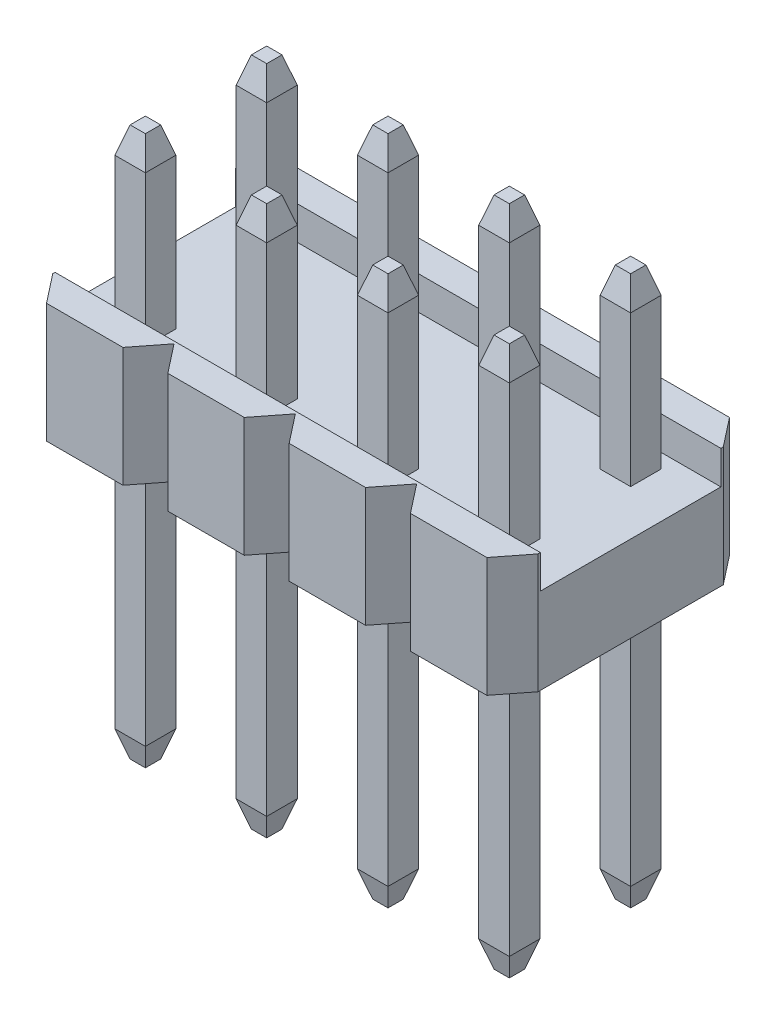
ISO-10303-21;
HEADER;
FILE_DESCRIPTION(('STEP AP214'),'2;1');
FILE_NAME('part.step','',(''),(''),'','','');
FILE_SCHEMA(('AUTOMOTIVE_DESIGN { 1 0 10303 214 1 1 1 1 }'));
ENDSEC;
DATA;
#1=APPLICATION_CONTEXT('core data for automotive mechanical design processes');
#2=APPLICATION_PROTOCOL_DEFINITION('international standard','automotive_design',2000,#1);
#3=PRODUCT_CONTEXT('',#1,'mechanical');
#4=PRODUCT('Part','Part','',(#3));
#5=PRODUCT_RELATED_PRODUCT_CATEGORY('part','',(#4));
#6=PRODUCT_DEFINITION_FORMATION('','',#4);
#7=PRODUCT_DEFINITION_CONTEXT('part definition',#1,'design');
#8=PRODUCT_DEFINITION('design','',#6,#7);
#9=PRODUCT_DEFINITION_SHAPE('','',#8);
#10=(LENGTH_UNIT() NAMED_UNIT(*) SI_UNIT(.MILLI.,.METRE.));
#11=(NAMED_UNIT(*) PLANE_ANGLE_UNIT() SI_UNIT($,.RADIAN.));
#12=(NAMED_UNIT(*) SI_UNIT($,.STERADIAN.) SOLID_ANGLE_UNIT());
#13=UNCERTAINTY_MEASURE_WITH_UNIT(LENGTH_MEASURE(1.E-05),#10,'distance_accuracy_value','');
#14=(GEOMETRIC_REPRESENTATION_CONTEXT(3) GLOBAL_UNCERTAINTY_ASSIGNED_CONTEXT((#13)) GLOBAL_UNIT_ASSIGNED_CONTEXT((#10,
#11,#12)) REPRESENTATION_CONTEXT('',''));
#15=CARTESIAN_POINT('',(0.,0.,0.));
#16=DIRECTION('',(0.,0.,1.));
#17=DIRECTION('',(1.,0.,0.));
#18=AXIS2_PLACEMENT_3D('',#15,#16,#17);
#19=CARTESIAN_POINT('',(0.,-2.5,-1.9399999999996));
#20=DIRECTION('',(0.787228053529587,0.,0.61666197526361));
#21=DIRECTION('',(0.61666197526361,0.,-0.787228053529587));
#22=AXIS2_PLACEMENT_3D('',#19,#20,#21);
#23=PLANE('',#22);
#24=DIRECTION('',(0.61666197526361,0.,-0.787228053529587));
#25=VECTOR('',#24,1.);
#26=CARTESIAN_POINT('',(0.,-2.5,-1.9399999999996));
#27=LINE('',#26,#25);
#28=CARTESIAN_POINT('',(-2.4761392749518E-13,-2.5,-1.93999999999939));
#29=VERTEX_POINT('',#28);
#30=CARTESIAN_POINT('',(0.469999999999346,-2.5,-2.53999999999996));
#31=VERTEX_POINT('',#30);
#32=EDGE_CURVE('E778',#29,#31,#27,.T.);
#33=ORIENTED_EDGE('',*,*,#32,.F.);
#34=DIRECTION('',(0.,1.,0.));
#35=VECTOR('',#34,1.);
#36=CARTESIAN_POINT('',(-5.85957064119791E-13,-2.5,-1.93999999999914));
#37=LINE('',#36,#35);
#38=CARTESIAN_POINT('',(-2.47633236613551E-13,0.,-1.93999999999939));
#39=VERTEX_POINT('',#38);
#40=EDGE_CURVE('E2907',#29,#39,#37,.T.);
#41=ORIENTED_EDGE('',*,*,#40,.T.);
#42=DIRECTION('',(0.61666197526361,0.,-0.787228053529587));
#43=VECTOR('',#42,1.);
#44=CARTESIAN_POINT('',(0.,0.,-1.9399999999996));
#45=LINE('',#44,#43);
#46=CARTESIAN_POINT('',(0.469999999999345,0.,-2.53999999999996));
#47=VERTEX_POINT('',#46);
#48=EDGE_CURVE('E789',#47,#39,#45,.F.);
#49=ORIENTED_EDGE('',*,*,#48,.F.);
#50=DIRECTION('',(0.,-1.,0.));
#51=VECTOR('',#50,1.);
#52=CARTESIAN_POINT('',(0.469999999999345,-2.5,-2.53999999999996));
#53=LINE('',#52,#51);
#54=EDGE_CURVE('E2902',#47,#31,#53,.T.);
#55=ORIENTED_EDGE('',*,*,#54,.T.);
#56=EDGE_LOOP('',(#33,#41,#49,#55));
#57=FACE_BOUND('',#56,.T.);
#58=ADVANCED_FACE('F17',(#57),#23,.F.);
#59=CARTESIAN_POINT('',(0.469999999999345,-2.5,2.53999999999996));
#60=DIRECTION('',(0.787228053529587,0.,-0.61666197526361));
#61=DIRECTION('',(-0.61666197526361,0.,-0.787228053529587));
#62=AXIS2_PLACEMENT_3D('',#59,#60,#61);
#63=PLANE('',#62);
#64=DIRECTION('',(-0.61666197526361,0.,-0.787228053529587));
#65=VECTOR('',#64,1.);
#66=CARTESIAN_POINT('',(0.469999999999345,-2.5,2.53999999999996));
#67=LINE('',#66,#65);
#68=CARTESIAN_POINT('',(0.469999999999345,-2.5,2.53999999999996));
#69=VERTEX_POINT('',#68);
#70=CARTESIAN_POINT('',(-2.96148303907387E-13,-2.5,1.93999999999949));
#71=VERTEX_POINT('',#70);
#72=EDGE_CURVE('E768',#69,#71,#67,.T.);
#73=ORIENTED_EDGE('',*,*,#72,.F.);
#74=DIRECTION('',(0.,1.,0.));
#75=VECTOR('',#74,1.);
#76=CARTESIAN_POINT('',(0.469999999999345,-2.5,2.53999999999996));
#77=LINE('',#76,#75);
#78=CARTESIAN_POINT('',(0.469999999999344,0.,2.53999999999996));
#79=VERTEX_POINT('',#78);
#80=EDGE_CURVE('E776',#69,#79,#77,.T.);
#81=ORIENTED_EDGE('',*,*,#80,.T.);
#82=DIRECTION('',(-0.61666197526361,0.,-0.787228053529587));
#83=VECTOR('',#82,1.);
#84=CARTESIAN_POINT('',(0.469999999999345,0.,2.53999999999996));
#85=LINE('',#84,#83);
#86=CARTESIAN_POINT('',(-4.510836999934E-13,0.,1.93999999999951));
#87=VERTEX_POINT('',#86);
#88=EDGE_CURVE('E759',#87,#79,#85,.F.);
#89=ORIENTED_EDGE('',*,*,#88,.F.);
#90=DIRECTION('',(0.,1.,0.));
#91=VECTOR('',#90,1.);
#92=CARTESIAN_POINT('',(-7.66391005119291E-13,-2.5,1.93999999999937));
#93=LINE('',#92,#91);
#94=EDGE_CURVE('E767',#87,#71,#93,.F.);
#95=ORIENTED_EDGE('',*,*,#94,.T.);
#96=EDGE_LOOP('',(#73,#81,#89,#95));
#97=FACE_BOUND('',#96,.T.);
#98=ADVANCED_FACE('F773',(#97),#63,.F.);
#99=CARTESIAN_POINT('',(-9.45910016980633E-13,-2.5,1.9399999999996));
#100=DIRECTION('',(-0.787228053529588,0.,-0.61666197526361));
#101=DIRECTION('',(-0.61666197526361,0.,0.787228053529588));
#102=AXIS2_PLACEMENT_3D('',#99,#100,#101);
#103=PLANE('',#102);
#104=DIRECTION('',(-0.61666197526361,0.,0.787228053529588));
#105=VECTOR('',#104,1.);
#106=CARTESIAN_POINT('',(-9.45910016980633E-13,-2.5,1.9399999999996));
#107=LINE('',#106,#105);
#108=CARTESIAN_POINT('',(-0.470000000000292,-2.5,2.53999999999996));
#109=VERTEX_POINT('',#108);
#110=EDGE_CURVE('E781',#71,#109,#107,.T.);
#111=ORIENTED_EDGE('',*,*,#110,.F.);
#112=ORIENTED_EDGE('',*,*,#94,.F.);
#113=DIRECTION('',(-0.61666197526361,0.,0.787228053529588));
#114=VECTOR('',#113,1.);
#115=CARTESIAN_POINT('',(-9.45984328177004E-13,0.,1.9399999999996));
#116=LINE('',#115,#114);
#117=CARTESIAN_POINT('',(-0.470000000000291,0.,2.53999999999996));
#118=VERTEX_POINT('',#117);
#119=EDGE_CURVE('E755',#118,#87,#116,.F.);
#120=ORIENTED_EDGE('',*,*,#119,.F.);
#121=DIRECTION('',(0.,1.,0.));
#122=VECTOR('',#121,1.);
#123=CARTESIAN_POINT('',(-0.470000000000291,-2.5,2.53999999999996));
#124=LINE('',#123,#122);
#125=EDGE_CURVE('E2704',#118,#109,#124,.F.);
#126=ORIENTED_EDGE('',*,*,#125,.T.);
#127=EDGE_LOOP('',(#111,#112,#120,#126));
#128=FACE_BOUND('',#127,.T.);
#129=ADVANCED_FACE('F780',(#128),#103,.F.);
#130=CARTESIAN_POINT('',(-0.470000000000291,-2.5,-2.53999999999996));
#131=DIRECTION('',(-0.787228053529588,0.,0.61666197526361));
#132=DIRECTION('',(0.61666197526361,0.,0.787228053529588));
#133=AXIS2_PLACEMENT_3D('',#130,#131,#132);
#134=PLANE('',#133);
#135=DIRECTION('',(0.61666197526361,0.,0.787228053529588));
#136=VECTOR('',#135,1.);
#137=CARTESIAN_POINT('',(-0.470000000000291,-2.5,-2.53999999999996));
#138=LINE('',#137,#136);
#139=CARTESIAN_POINT('',(-0.470000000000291,-2.5,-2.53999999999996));
#140=VERTEX_POINT('',#139);
#141=EDGE_CURVE('E2910',#140,#29,#138,.T.);
#142=ORIENTED_EDGE('',*,*,#141,.F.);
#143=DIRECTION('',(0.,-1.,0.));
#144=VECTOR('',#143,1.);
#145=CARTESIAN_POINT('',(-0.470000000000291,-2.5,-2.53999999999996));
#146=LINE('',#145,#144);
#147=CARTESIAN_POINT('',(-0.470000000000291,0.,-2.53999999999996));
#148=VERTEX_POINT('',#147);
#149=EDGE_CURVE('E2695',#140,#148,#146,.F.);
#150=ORIENTED_EDGE('',*,*,#149,.T.);
#151=DIRECTION('',(0.61666197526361,0.,0.787228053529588));
#152=VECTOR('',#151,1.);
#153=CARTESIAN_POINT('',(-0.470000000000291,0.,-2.53999999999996));
#154=LINE('',#153,#152);
#155=EDGE_CURVE('E783',#39,#148,#154,.F.);
#156=ORIENTED_EDGE('',*,*,#155,.F.);
#157=ORIENTED_EDGE('',*,*,#40,.F.);
#158=EDGE_LOOP('',(#142,#150,#156,#157));
#159=FACE_BOUND('',#158,.T.);
#160=ADVANCED_FACE('F2922',(#159),#134,.F.);
#161=CARTESIAN_POINT('',(0.469999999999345,-2.5,-2.53999999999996));
#162=DIRECTION('',(0.,0.,1.));
#163=DIRECTION('',(0.,-1.,0.));
#164=AXIS2_PLACEMENT_3D('',#161,#162,#163);
#165=PLANE('',#164);
#166=DIRECTION('',(1.,0.,0.));
#167=VECTOR('',#166,1.);
#168=CARTESIAN_POINT('',(0.469999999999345,-2.5,-2.53999999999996));
#169=LINE('',#168,#167);
#170=CARTESIAN_POINT('',(2.06999999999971,-2.5,-2.53999999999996));
#171=VERTEX_POINT('',#170);
#172=EDGE_CURVE('E2900',#31,#171,#169,.T.);
#173=ORIENTED_EDGE('',*,*,#172,.F.);
#174=ORIENTED_EDGE('',*,*,#54,.F.);
#175=DIRECTION('',(1.,0.,0.));
#176=VECTOR('',#175,1.);
#177=CARTESIAN_POINT('',(0.469999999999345,0.,-2.53999999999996));
#178=LINE('',#177,#176);
#179=CARTESIAN_POINT('',(2.06999999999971,0.,-2.53999999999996));
#180=VERTEX_POINT('',#179);
#181=EDGE_CURVE('E2905',#180,#47,#178,.F.);
#182=ORIENTED_EDGE('',*,*,#181,.F.);
#183=DIRECTION('',(0.,1.,0.));
#184=VECTOR('',#183,1.);
#185=CARTESIAN_POINT('',(2.06999999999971,-2.5,-2.53999999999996));
#186=LINE('',#185,#184);
#187=EDGE_CURVE('E2690',#180,#171,#186,.F.);
#188=ORIENTED_EDGE('',*,*,#187,.T.);
#189=EDGE_LOOP('',(#173,#174,#182,#188));
#190=FACE_BOUND('',#189,.T.);
#191=ADVANCED_FACE('F5229',(#190),#165,.F.);
#192=CARTESIAN_POINT('',(2.06999999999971,-2.5,2.53999999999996));
#193=DIRECTION('',(0.,0.,-1.));
#194=DIRECTION('',(0.,1.,0.));
#195=AXIS2_PLACEMENT_3D('',#192,#193,#194);
#196=PLANE('',#195);
#197=DIRECTION('',(1.,0.,0.));
#198=VECTOR('',#197,1.);
#199=CARTESIAN_POINT('',(2.06999999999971,-2.5,2.53999999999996));
#200=LINE('',#199,#198);
#201=CARTESIAN_POINT('',(2.06999999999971,-2.5,2.53999999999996));
#202=VERTEX_POINT('',#201);
#203=EDGE_CURVE('E2896',#202,#69,#200,.F.);
#204=ORIENTED_EDGE('',*,*,#203,.F.);
#205=DIRECTION('',(0.,1.,0.));
#206=VECTOR('',#205,1.);
#207=CARTESIAN_POINT('',(2.06999999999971,-2.5,2.53999999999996));
#208=LINE('',#207,#206);
#209=CARTESIAN_POINT('',(2.06999999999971,0.,2.53999999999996));
#210=VERTEX_POINT('',#209);
#211=EDGE_CURVE('E2679',#202,#210,#208,.T.);
#212=ORIENTED_EDGE('',*,*,#211,.T.);
#213=DIRECTION('',(1.,0.,0.));
#214=VECTOR('',#213,1.);
#215=CARTESIAN_POINT('',(2.06999999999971,0.,2.53999999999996));
#216=LINE('',#215,#214);
#217=EDGE_CURVE('E2898',#79,#210,#216,.T.);
#218=ORIENTED_EDGE('',*,*,#217,.F.);
#219=ORIENTED_EDGE('',*,*,#80,.F.);
#220=EDGE_LOOP('',(#204,#212,#218,#219));
#221=FACE_BOUND('',#220,.T.);
#222=ADVANCED_FACE('F2869',(#221),#196,.F.);
#223=CARTESIAN_POINT('',(4.13,2.45,0.95));
#224=DIRECTION('',(0.,-0.279329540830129,0.960195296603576));
#225=DIRECTION('',(0.,-0.960195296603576,-0.279329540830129));
#226=AXIS2_PLACEMENT_3D('',#223,#224,#225);
#227=PLANE('',#226);
#228=DIRECTION('',(1.,0.,0.));
#229=VECTOR('',#228,1.);
#230=CARTESIAN_POINT('',(4.13,2.45,0.949999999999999));
#231=LINE('',#230,#229);
#232=CARTESIAN_POINT('',(4.12986708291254,2.4499823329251,0.949998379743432));
#233=VERTEX_POINT('',#232);
#234=CARTESIAN_POINT('',(3.49000000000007,2.44999999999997,0.95));
#235=VERTEX_POINT('',#234);
#236=EDGE_CURVE('E2570',#233,#235,#231,.F.);
#237=ORIENTED_EDGE('',*,*,#236,.T.);
#238=DIRECTION('',(0.269031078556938,0.924794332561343,0.269031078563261));
#239=VECTOR('',#238,1.);
#240=CARTESIAN_POINT('',(3.49000000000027,2.44999999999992,0.95));
#241=LINE('',#240,#239);
#242=CARTESIAN_POINT('',(3.6499999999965,3.,1.11));
#243=VERTEX_POINT('',#242);
#244=EDGE_CURVE('E2668',#235,#243,#241,.T.);
#245=ORIENTED_EDGE('',*,*,#244,.T.);
#246=DIRECTION('',(1.,0.,0.));
#247=VECTOR('',#246,1.);
#248=CARTESIAN_POINT('',(4.13,3.,1.11));
#249=LINE('',#248,#247);
#250=CARTESIAN_POINT('',(3.97000000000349,3.,1.11));
#251=VERTEX_POINT('',#250);
#252=EDGE_CURVE('E2657',#243,#251,#249,.T.);
#253=ORIENTED_EDGE('',*,*,#252,.T.);
#254=CARTESIAN_POINT('',(3.97000000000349,3.,1.11));
#255=DIRECTION('',(0.268600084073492,-0.924909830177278,-0.269064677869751));
#256=VECTOR('',#255,1.);
#257=LINE('',#254,#256);
#258=EDGE_CURVE('E2656',#251,#233,#257,.T.);
#259=ORIENTED_EDGE('',*,*,#258,.T.);
#260=EDGE_LOOP('',(#237,#245,#253,#259));
#261=FACE_BOUND('',#260,.T.);
#262=ADVANCED_FACE('F2865',(#261),#227,.F.);
#263=CARTESIAN_POINT('',(-0.95,2.45,0.95));
#264=DIRECTION('',(0.,-0.279329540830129,0.960195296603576));
#265=DIRECTION('',(0.,-0.960195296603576,-0.279329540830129));
#266=AXIS2_PLACEMENT_3D('',#263,#264,#265);
#267=PLANE('',#266);
#268=DIRECTION('',(1.,0.,0.));
#269=VECTOR('',#268,1.);
#270=CARTESIAN_POINT('',(-0.95,2.45,0.949999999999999));
#271=LINE('',#270,#269);
#272=CARTESIAN_POINT('',(-0.950132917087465,2.4499823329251,0.949998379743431));
#273=VERTEX_POINT('',#272);
#274=CARTESIAN_POINT('',(-1.58999999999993,2.44999999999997,0.95));
#275=VERTEX_POINT('',#274);
#276=EDGE_CURVE('E2447',#273,#275,#271,.F.);
#277=ORIENTED_EDGE('',*,*,#276,.T.);
#278=DIRECTION('',(0.269031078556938,0.924794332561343,0.26903107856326));
#279=VECTOR('',#278,1.);
#280=CARTESIAN_POINT('',(-1.58999999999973,2.44999999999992,0.95));
#281=LINE('',#280,#279);
#282=CARTESIAN_POINT('',(-1.43000000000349,3.,1.11));
#283=VERTEX_POINT('',#282);
#284=EDGE_CURVE('E2545',#275,#283,#281,.T.);
#285=ORIENTED_EDGE('',*,*,#284,.T.);
#286=DIRECTION('',(1.,0.,0.));
#287=VECTOR('',#286,1.);
#288=CARTESIAN_POINT('',(-0.95,3.,1.11));
#289=LINE('',#288,#287);
#290=CARTESIAN_POINT('',(-1.10999999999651,3.,1.11));
#291=VERTEX_POINT('',#290);
#292=EDGE_CURVE('E2534',#283,#291,#289,.T.);
#293=ORIENTED_EDGE('',*,*,#292,.T.);
#294=CARTESIAN_POINT('',(-1.10999999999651,3.,1.11));
#295=DIRECTION('',(0.268600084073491,-0.924909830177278,-0.269064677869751));
#296=VECTOR('',#295,1.);
#297=LINE('',#294,#296);
#298=EDGE_CURVE('E2533',#291,#273,#297,.T.);
#299=ORIENTED_EDGE('',*,*,#298,.T.);
#300=EDGE_LOOP('',(#277,#285,#293,#299));
#301=FACE_BOUND('',#300,.T.);
#302=ADVANCED_FACE('F2856',(#301),#267,.F.);
#303=CARTESIAN_POINT('',(4.13,2.45,-1.59));
#304=DIRECTION('',(0.,-0.279329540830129,0.960195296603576));
#305=DIRECTION('',(0.,-0.960195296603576,-0.279329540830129));
#306=AXIS2_PLACEMENT_3D('',#303,#304,#305);
#307=PLANE('',#306);
#308=DIRECTION('',(1.,0.,0.));
#309=VECTOR('',#308,1.);
#310=CARTESIAN_POINT('',(4.13,2.45,-1.59));
#311=LINE('',#310,#309);
#312=CARTESIAN_POINT('',(4.12986708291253,2.4499823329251,-1.59000162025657));
#313=VERTEX_POINT('',#312);
#314=CARTESIAN_POINT('',(3.49000000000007,2.44999999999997,-1.59));
#315=VERTEX_POINT('',#314);
#316=EDGE_CURVE('E2324',#313,#315,#311,.F.);
#317=ORIENTED_EDGE('',*,*,#316,.T.);
#318=DIRECTION('',(0.269031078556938,0.924794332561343,0.269031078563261));
#319=VECTOR('',#318,1.);
#320=CARTESIAN_POINT('',(3.49000000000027,2.44999999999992,-1.59));
#321=LINE('',#320,#319);
#322=CARTESIAN_POINT('',(3.6499999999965,3.,-1.43));
#323=VERTEX_POINT('',#322);
#324=EDGE_CURVE('E2422',#315,#323,#321,.T.);
#325=ORIENTED_EDGE('',*,*,#324,.T.);
#326=DIRECTION('',(1.,0.,0.));
#327=VECTOR('',#326,1.);
#328=CARTESIAN_POINT('',(4.13,3.,-1.43));
#329=LINE('',#328,#327);
#330=CARTESIAN_POINT('',(3.97000000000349,3.,-1.43));
#331=VERTEX_POINT('',#330);
#332=EDGE_CURVE('E2411',#323,#331,#329,.T.);
#333=ORIENTED_EDGE('',*,*,#332,.T.);
#334=CARTESIAN_POINT('',(3.97000000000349,3.,-1.43));
#335=DIRECTION('',(0.268600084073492,-0.924909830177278,-0.269064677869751));
#336=VECTOR('',#335,1.);
#337=LINE('',#334,#336);
#338=EDGE_CURVE('E2410',#331,#313,#337,.T.);
#339=ORIENTED_EDGE('',*,*,#338,.T.);
#340=EDGE_LOOP('',(#317,#325,#333,#339));
#341=FACE_BOUND('',#340,.T.);
#342=ADVANCED_FACE('F2802',(#341),#307,.F.);
#343=CARTESIAN_POINT('',(-0.95,2.45,-1.59));
#344=DIRECTION('',(0.,-0.279329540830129,0.960195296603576));
#345=DIRECTION('',(0.,-0.960195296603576,-0.279329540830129));
#346=AXIS2_PLACEMENT_3D('',#343,#344,#345);
#347=PLANE('',#346);
#348=DIRECTION('',(1.,0.,0.));
#349=VECTOR('',#348,1.);
#350=CARTESIAN_POINT('',(-0.95,2.45,-1.59));
#351=LINE('',#350,#349);
#352=CARTESIAN_POINT('',(-0.950132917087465,2.4499823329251,-1.59000162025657));
#353=VERTEX_POINT('',#352);
#354=CARTESIAN_POINT('',(-1.58999999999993,2.44999999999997,-1.59));
#355=VERTEX_POINT('',#354);
#356=EDGE_CURVE('E2200',#353,#355,#351,.F.);
#357=ORIENTED_EDGE('',*,*,#356,.T.);
#358=DIRECTION('',(0.269031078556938,0.924794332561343,0.26903107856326));
#359=VECTOR('',#358,1.);
#360=CARTESIAN_POINT('',(-1.58999999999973,2.44999999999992,-1.59));
#361=LINE('',#360,#359);
#362=CARTESIAN_POINT('',(-1.43000000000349,3.,-1.43));
#363=VERTEX_POINT('',#362);
#364=EDGE_CURVE('E2299',#355,#363,#361,.T.);
#365=ORIENTED_EDGE('',*,*,#364,.T.);
#366=DIRECTION('',(1.,0.,0.));
#367=VECTOR('',#366,1.);
#368=CARTESIAN_POINT('',(-0.95,3.,-1.43));
#369=LINE('',#368,#367);
#370=CARTESIAN_POINT('',(-1.10999999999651,3.,-1.43));
#371=VERTEX_POINT('',#370);
#372=EDGE_CURVE('E2288',#363,#371,#369,.T.);
#373=ORIENTED_EDGE('',*,*,#372,.T.);
#374=CARTESIAN_POINT('',(-1.10999999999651,3.,-1.43));
#375=DIRECTION('',(0.268600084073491,-0.924909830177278,-0.269064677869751));
#376=VECTOR('',#375,1.);
#377=LINE('',#374,#376);
#378=EDGE_CURVE('E2287',#371,#353,#377,.T.);
#379=ORIENTED_EDGE('',*,*,#378,.T.);
#380=EDGE_LOOP('',(#357,#365,#373,#379));
#381=FACE_BOUND('',#380,.T.);
#382=ADVANCED_FACE('F2798',(#381),#347,.F.);
#383=CARTESIAN_POINT('',(-3.49,2.45,-1.59));
#384=DIRECTION('',(0.,-0.279329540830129,0.960195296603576));
#385=DIRECTION('',(0.,-0.960195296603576,-0.279329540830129));
#386=AXIS2_PLACEMENT_3D('',#383,#384,#385);
#387=PLANE('',#386);
#388=DIRECTION('',(1.,0.,0.));
#389=VECTOR('',#388,1.);
#390=CARTESIAN_POINT('',(-3.49,2.45,-1.59));
#391=LINE('',#390,#389);
#392=CARTESIAN_POINT('',(-3.49013291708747,2.4499823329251,-1.59000162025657));
#393=VERTEX_POINT('',#392);
#394=CARTESIAN_POINT('',(-4.12999999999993,2.44999999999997,-1.59));
#395=VERTEX_POINT('',#394);
#396=EDGE_CURVE('E2077',#393,#395,#391,.F.);
#397=ORIENTED_EDGE('',*,*,#396,.T.);
#398=DIRECTION('',(0.269031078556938,0.924794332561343,0.26903107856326));
#399=VECTOR('',#398,1.);
#400=CARTESIAN_POINT('',(-4.12999999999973,2.44999999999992,-1.59));
#401=LINE('',#400,#399);
#402=CARTESIAN_POINT('',(-3.97000000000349,3.,-1.43));
#403=VERTEX_POINT('',#402);
#404=EDGE_CURVE('E2175',#395,#403,#401,.T.);
#405=ORIENTED_EDGE('',*,*,#404,.T.);
#406=DIRECTION('',(1.,0.,0.));
#407=VECTOR('',#406,1.);
#408=CARTESIAN_POINT('',(-3.49,3.,-1.43));
#409=LINE('',#408,#407);
#410=CARTESIAN_POINT('',(-3.64999999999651,3.,-1.43));
#411=VERTEX_POINT('',#410);
#412=EDGE_CURVE('E2164',#403,#411,#409,.T.);
#413=ORIENTED_EDGE('',*,*,#412,.T.);
#414=CARTESIAN_POINT('',(-3.64999999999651,3.,-1.43));
#415=DIRECTION('',(0.268600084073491,-0.924909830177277,-0.269064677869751));
#416=VECTOR('',#415,1.);
#417=LINE('',#414,#416);
#418=EDGE_CURVE('E2163',#411,#393,#417,.T.);
#419=ORIENTED_EDGE('',*,*,#418,.T.);
#420=EDGE_LOOP('',(#397,#405,#413,#419));
#421=FACE_BOUND('',#420,.T.);
#422=ADVANCED_FACE('F2789',(#421),#387,.F.);
#423=CARTESIAN_POINT('',(1.59,2.45,-1.59));
#424=DIRECTION('',(0.,-0.279329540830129,0.960195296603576));
#425=DIRECTION('',(0.,-0.960195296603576,-0.279329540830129));
#426=AXIS2_PLACEMENT_3D('',#423,#424,#425);
#427=PLANE('',#426);
#428=DIRECTION('',(1.,0.,0.));
#429=VECTOR('',#428,1.);
#430=CARTESIAN_POINT('',(1.59,2.45,-1.59));
#431=LINE('',#430,#429);
#432=CARTESIAN_POINT('',(1.58986708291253,2.4499823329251,-1.59000162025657));
#433=VERTEX_POINT('',#432);
#434=CARTESIAN_POINT('',(0.950000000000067,2.44999999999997,-1.59));
#435=VERTEX_POINT('',#434);
#436=EDGE_CURVE('E1954',#433,#435,#431,.F.);
#437=ORIENTED_EDGE('',*,*,#436,.T.);
#438=DIRECTION('',(0.269031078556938,0.924794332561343,0.26903107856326));
#439=VECTOR('',#438,1.);
#440=CARTESIAN_POINT('',(0.950000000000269,2.44999999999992,-1.59));
#441=LINE('',#440,#439);
#442=CARTESIAN_POINT('',(1.10999999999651,3.,-1.43));
#443=VERTEX_POINT('',#442);
#444=EDGE_CURVE('E2052',#435,#443,#441,.T.);
#445=ORIENTED_EDGE('',*,*,#444,.T.);
#446=DIRECTION('',(1.,0.,0.));
#447=VECTOR('',#446,1.);
#448=CARTESIAN_POINT('',(1.59,3.,-1.43));
#449=LINE('',#448,#447);
#450=CARTESIAN_POINT('',(1.43000000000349,3.,-1.43));
#451=VERTEX_POINT('',#450);
#452=EDGE_CURVE('E2041',#443,#451,#449,.T.);
#453=ORIENTED_EDGE('',*,*,#452,.T.);
#454=CARTESIAN_POINT('',(1.43000000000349,3.,-1.43));
#455=DIRECTION('',(0.268600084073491,-0.924909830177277,-0.269064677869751));
#456=VECTOR('',#455,1.);
#457=LINE('',#454,#456);
#458=EDGE_CURVE('E2040',#451,#433,#457,.T.);
#459=ORIENTED_EDGE('',*,*,#458,.T.);
#460=EDGE_LOOP('',(#437,#445,#453,#459));
#461=FACE_BOUND('',#460,.T.);
#462=ADVANCED_FACE('F2733',(#461),#427,.F.);
#463=CARTESIAN_POINT('',(-3.49,2.45,0.95));
#464=DIRECTION('',(0.,-0.279329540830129,0.960195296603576));
#465=DIRECTION('',(0.,-0.960195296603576,-0.279329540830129));
#466=AXIS2_PLACEMENT_3D('',#463,#464,#465);
#467=PLANE('',#466);
#468=DIRECTION('',(1.,0.,0.));
#469=VECTOR('',#468,1.);
#470=CARTESIAN_POINT('',(-3.49,2.45,0.949999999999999));
#471=LINE('',#470,#469);
#472=CARTESIAN_POINT('',(-3.49013291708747,2.4499823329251,0.949998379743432));
#473=VERTEX_POINT('',#472);
#474=CARTESIAN_POINT('',(-4.12999999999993,2.44999999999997,0.95));
#475=VERTEX_POINT('',#474);
#476=EDGE_CURVE('E1841',#473,#475,#471,.F.);
#477=ORIENTED_EDGE('',*,*,#476,.T.);
#478=DIRECTION('',(0.269031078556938,0.924794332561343,0.26903107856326));
#479=VECTOR('',#478,1.);
#480=CARTESIAN_POINT('',(-4.12999999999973,2.44999999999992,0.95));
#481=LINE('',#480,#479);
#482=CARTESIAN_POINT('',(-3.97000000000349,3.,1.11));
#483=VERTEX_POINT('',#482);
#484=EDGE_CURVE('E1929',#475,#483,#481,.T.);
#485=ORIENTED_EDGE('',*,*,#484,.T.);
#486=DIRECTION('',(1.,0.,0.));
#487=VECTOR('',#486,1.);
#488=CARTESIAN_POINT('',(-3.49,3.,1.11));
#489=LINE('',#488,#487);
#490=CARTESIAN_POINT('',(-3.64999999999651,3.,1.11));
#491=VERTEX_POINT('',#490);
#492=EDGE_CURVE('E1918',#483,#491,#489,.T.);
#493=ORIENTED_EDGE('',*,*,#492,.T.);
#494=CARTESIAN_POINT('',(-3.64999999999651,3.,1.11));
#495=DIRECTION('',(0.268600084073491,-0.924909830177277,-0.269064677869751));
#496=VECTOR('',#495,1.);
#497=LINE('',#494,#496);
#498=EDGE_CURVE('E1849',#491,#473,#497,.T.);
#499=ORIENTED_EDGE('',*,*,#498,.T.);
#500=EDGE_LOOP('',(#477,#485,#493,#499));
#501=FACE_BOUND('',#500,.T.);
#502=ADVANCED_FACE('F2728',(#501),#467,.F.);
#503=CARTESIAN_POINT('',(1.59,2.45,0.95));
#504=DIRECTION('',(0.,-0.279329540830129,0.960195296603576));
#505=DIRECTION('',(0.,-0.960195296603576,-0.279329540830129));
#506=AXIS2_PLACEMENT_3D('',#503,#504,#505);
#507=PLANE('',#506);
#508=DIRECTION('',(1.,0.,0.));
#509=VECTOR('',#508,1.);
#510=CARTESIAN_POINT('',(1.59,2.45,0.949999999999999));
#511=LINE('',#510,#509);
#512=CARTESIAN_POINT('',(1.58986708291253,2.4499823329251,0.949998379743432));
#513=VERTEX_POINT('',#512);
#514=CARTESIAN_POINT('',(0.950000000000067,2.44999999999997,0.95));
#515=VERTEX_POINT('',#514);
#516=EDGE_CURVE('E3386',#513,#515,#511,.F.);
#517=ORIENTED_EDGE('',*,*,#516,.T.);
#518=DIRECTION('',(0.269031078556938,0.924794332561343,0.26903107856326));
#519=VECTOR('',#518,1.);
#520=CARTESIAN_POINT('',(0.950000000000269,2.44999999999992,0.95));
#521=LINE('',#520,#519);
#522=CARTESIAN_POINT('',(1.10999999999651,3.,1.11));
#523=VERTEX_POINT('',#522);
#524=EDGE_CURVE('E1853',#515,#523,#521,.T.);
#525=ORIENTED_EDGE('',*,*,#524,.T.);
#526=DIRECTION('',(1.,0.,0.));
#527=VECTOR('',#526,1.);
#528=CARTESIAN_POINT('',(1.59,3.,1.11));
#529=LINE('',#528,#527);
#530=CARTESIAN_POINT('',(1.43000000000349,3.,1.11));
#531=VERTEX_POINT('',#530);
#532=EDGE_CURVE('E3461',#523,#531,#529,.T.);
#533=ORIENTED_EDGE('',*,*,#532,.T.);
#534=CARTESIAN_POINT('',(1.43000000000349,3.,1.11));
#535=DIRECTION('',(0.268600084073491,-0.924909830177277,-0.269064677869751));
#536=VECTOR('',#535,1.);
#537=LINE('',#534,#536);
#538=EDGE_CURVE('E2710',#531,#513,#537,.T.);
#539=ORIENTED_EDGE('',*,*,#538,.T.);
#540=EDGE_LOOP('',(#517,#525,#533,#539));
#541=FACE_BOUND('',#540,.T.);
#542=ADVANCED_FACE('F2717',(#541),#507,.F.);
#543=CARTESIAN_POINT('',(-0.470000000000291,-2.5,2.53999999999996));
#544=DIRECTION('',(0.,0.,-1.));
#545=DIRECTION('',(0.,1.,0.));
#546=AXIS2_PLACEMENT_3D('',#543,#544,#545);
#547=PLANE('',#546);
#548=DIRECTION('',(1.,0.,0.));
#549=VECTOR('',#548,1.);
#550=CARTESIAN_POINT('',(-0.470000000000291,-2.5,2.53999999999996));
#551=LINE('',#550,#549);
#552=CARTESIAN_POINT('',(-2.07000000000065,-2.5,2.53999999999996));
#553=VERTEX_POINT('',#552);
#554=EDGE_CURVE('E2702',#109,#553,#551,.F.);
#555=ORIENTED_EDGE('',*,*,#554,.F.);
#556=ORIENTED_EDGE('',*,*,#125,.F.);
#557=DIRECTION('',(1.,0.,0.));
#558=VECTOR('',#557,1.);
#559=CARTESIAN_POINT('',(-0.470000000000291,0.,2.53999999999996));
#560=LINE('',#559,#558);
#561=CARTESIAN_POINT('',(-2.07000000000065,0.,2.53999999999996));
#562=VERTEX_POINT('',#561);
#563=EDGE_CURVE('E762',#562,#118,#560,.T.);
#564=ORIENTED_EDGE('',*,*,#563,.F.);
#565=DIRECTION('',(0.,1.,0.));
#566=VECTOR('',#565,1.);
#567=CARTESIAN_POINT('',(-2.07000000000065,-2.5,2.53999999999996));
#568=LINE('',#567,#566);
#569=EDGE_CURVE('E3397',#562,#553,#568,.F.);
#570=ORIENTED_EDGE('',*,*,#569,.T.);
#571=EDGE_LOOP('',(#555,#556,#564,#570));
#572=FACE_BOUND('',#571,.T.);
#573=ADVANCED_FACE('F2727',(#572),#547,.F.);
#574=CARTESIAN_POINT('',(-2.07000000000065,-2.5,-2.53999999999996));
#575=DIRECTION('',(0.,0.,1.));
#576=DIRECTION('',(0.,-1.,0.));
#577=AXIS2_PLACEMENT_3D('',#574,#575,#576);
#578=PLANE('',#577);
#579=DIRECTION('',(1.,0.,0.));
#580=VECTOR('',#579,1.);
#581=CARTESIAN_POINT('',(-2.07000000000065,-2.5,-2.53999999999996));
#582=LINE('',#581,#580);
#583=CARTESIAN_POINT('',(-2.07000000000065,-2.5,-2.53999999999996));
#584=VERTEX_POINT('',#583);
#585=EDGE_CURVE('E2698',#584,#140,#582,.T.);
#586=ORIENTED_EDGE('',*,*,#585,.F.);
#587=DIRECTION('',(0.,1.,0.));
#588=VECTOR('',#587,1.);
#589=CARTESIAN_POINT('',(-2.07000000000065,-2.5,-2.53999999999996));
#590=LINE('',#589,#588);
#591=CARTESIAN_POINT('',(-2.07000000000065,0.,-2.53999999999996));
#592=VERTEX_POINT('',#591);
#593=EDGE_CURVE('E2927',#584,#592,#590,.T.);
#594=ORIENTED_EDGE('',*,*,#593,.T.);
#595=DIRECTION('',(1.,0.,0.));
#596=VECTOR('',#595,1.);
#597=CARTESIAN_POINT('',(-2.07000000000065,0.,-2.53999999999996));
#598=LINE('',#597,#596);
#599=EDGE_CURVE('E2700',#148,#592,#598,.F.);
#600=ORIENTED_EDGE('',*,*,#599,.F.);
#601=ORIENTED_EDGE('',*,*,#149,.F.);
#602=EDGE_LOOP('',(#586,#594,#600,#601));
#603=FACE_BOUND('',#602,.T.);
#604=ADVANCED_FACE('F2925',(#603),#578,.F.);
#605=CARTESIAN_POINT('',(2.06999999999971,-2.5,-2.53999999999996));
#606=DIRECTION('',(-0.787228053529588,0.,0.61666197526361));
#607=DIRECTION('',(0.61666197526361,0.,0.787228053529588));
#608=AXIS2_PLACEMENT_3D('',#605,#606,#607);
#609=PLANE('',#608);
#610=DIRECTION('',(0.61666197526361,0.,0.787228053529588));
#611=VECTOR('',#610,1.);
#612=CARTESIAN_POINT('',(2.06999999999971,-2.5,-2.53999999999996));
#613=LINE('',#612,#611);
#614=CARTESIAN_POINT('',(2.53999999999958,-2.5,-1.93999999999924));
#615=VERTEX_POINT('',#614);
#616=EDGE_CURVE('E2688',#171,#615,#613,.T.);
#617=ORIENTED_EDGE('',*,*,#616,.F.);
#618=ORIENTED_EDGE('',*,*,#187,.F.);
#619=DIRECTION('',(0.61666197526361,0.,0.787228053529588));
#620=VECTOR('',#619,1.);
#621=CARTESIAN_POINT('',(2.06999999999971,0.,-2.53999999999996));
#622=LINE('',#621,#620);
#623=CARTESIAN_POINT('',(2.53999999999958,0.,-1.93999999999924));
#624=VERTEX_POINT('',#623);
#625=EDGE_CURVE('E2693',#624,#180,#622,.F.);
#626=ORIENTED_EDGE('',*,*,#625,.F.);
#627=DIRECTION('',(0.,1.,0.));
#628=VECTOR('',#627,1.);
#629=CARTESIAN_POINT('',(2.53999999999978,-2.5,-1.93999999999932));
#630=LINE('',#629,#628);
#631=EDGE_CURVE('E2931',#624,#615,#630,.F.);
#632=ORIENTED_EDGE('',*,*,#631,.T.);
#633=EDGE_LOOP('',(#617,#618,#626,#632));
#634=FACE_BOUND('',#633,.T.);
#635=ADVANCED_FACE('F5159',(#634),#609,.F.);
#636=CARTESIAN_POINT('',(2.53999999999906,-2.5,1.9399999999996));
#637=DIRECTION('',(-0.787228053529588,0.,-0.61666197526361));
#638=DIRECTION('',(-0.61666197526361,0.,0.787228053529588));
#639=AXIS2_PLACEMENT_3D('',#636,#637,#638);
#640=PLANE('',#639);
#641=DIRECTION('',(-0.61666197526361,0.,0.787228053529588));
#642=VECTOR('',#641,1.);
#643=CARTESIAN_POINT('',(2.53999999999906,-2.5,1.9399999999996));
#644=LINE('',#643,#642);
#645=CARTESIAN_POINT('',(2.53999999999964,-2.5,1.93999999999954));
#646=VERTEX_POINT('',#645);
#647=EDGE_CURVE('E2684',#646,#202,#644,.T.);
#648=ORIENTED_EDGE('',*,*,#647,.F.);
#649=DIRECTION('',(0.,1.,0.));
#650=VECTOR('',#649,1.);
#651=CARTESIAN_POINT('',(2.53999999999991,-2.5,1.93999999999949));
#652=LINE('',#651,#650);
#653=CARTESIAN_POINT('',(2.53999999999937,0.,1.93999999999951));
#654=VERTEX_POINT('',#653);
#655=EDGE_CURVE('E3908',#646,#654,#652,.T.);
#656=ORIENTED_EDGE('',*,*,#655,.T.);
#657=DIRECTION('',(-0.61666197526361,0.,0.787228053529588));
#658=VECTOR('',#657,1.);
#659=CARTESIAN_POINT('',(2.53999999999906,0.,1.9399999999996));
#660=LINE('',#659,#658);
#661=EDGE_CURVE('E2686',#210,#654,#660,.F.);
#662=ORIENTED_EDGE('',*,*,#661,.F.);
#663=ORIENTED_EDGE('',*,*,#211,.F.);
#664=EDGE_LOOP('',(#648,#656,#662,#663));
#665=FACE_BOUND('',#664,.T.);
#666=ADVANCED_FACE('F3909',(#665),#640,.F.);
#667=CARTESIAN_POINT('',(3.6499999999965,3.,2.27));
#668=DIRECTION('',(0.960195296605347,-0.279329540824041,0.));
#669=DIRECTION('',(0.279329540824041,0.960195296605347,0.));
#670=AXIS2_PLACEMENT_3D('',#667,#668,#669);
#671=PLANE('',#670);
#672=DIRECTION('',(0.,0.,1.));
#673=VECTOR('',#672,1.);
#674=CARTESIAN_POINT('',(3.49,2.44999999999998,1.43));
#675=LINE('',#674,#673);
#676=CARTESIAN_POINT('',(3.49000000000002,2.44999999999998,1.59));
#677=VERTEX_POINT('',#676);
#678=EDGE_CURVE('E2675',#677,#235,#675,.F.);
#679=ORIENTED_EDGE('',*,*,#678,.F.);
#680=DIRECTION('',(0.269031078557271,0.924794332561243,-0.269031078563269));
#681=VECTOR('',#680,1.);
#682=CARTESIAN_POINT('',(3.49000000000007,2.44999999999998,1.59));
#683=LINE('',#682,#681);
#684=CARTESIAN_POINT('',(3.6499999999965,3.,1.43));
#685=VERTEX_POINT('',#684);
#686=EDGE_CURVE('E2662',#677,#685,#683,.T.);
#687=ORIENTED_EDGE('',*,*,#686,.T.);
#688=DIRECTION('',(0.,0.,-1.));
#689=VECTOR('',#688,1.);
#690=CARTESIAN_POINT('',(3.6499999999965,3.,1.11));
#691=LINE('',#690,#689);
#692=EDGE_CURVE('E2665',#685,#243,#691,.T.);
#693=ORIENTED_EDGE('',*,*,#692,.T.);
#694=ORIENTED_EDGE('',*,*,#244,.F.);
#695=EDGE_LOOP('',(#679,#687,#693,#694));
#696=FACE_BOUND('',#695,.T.);
#697=ADVANCED_FACE('F5144',(#696),#671,.F.);
#698=CARTESIAN_POINT('',(4.13,3.,1.11));
#699=DIRECTION('',(0.,-1.,0.));
#700=DIRECTION('',(0.,0.,-1.));
#701=AXIS2_PLACEMENT_3D('',#698,#699,#700);
#702=PLANE('',#701);
#703=ORIENTED_EDGE('',*,*,#252,.F.);
#704=ORIENTED_EDGE('',*,*,#692,.F.);
#705=DIRECTION('',(1.,0.,0.));
#706=VECTOR('',#705,1.);
#707=CARTESIAN_POINT('',(4.13,3.,1.43));
#708=LINE('',#707,#706);
#709=CARTESIAN_POINT('',(3.97000000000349,3.,1.43));
#710=VERTEX_POINT('',#709);
#711=EDGE_CURVE('E2660',#685,#710,#708,.T.);
#712=ORIENTED_EDGE('',*,*,#711,.T.);
#713=DIRECTION('',(0.,0.,1.));
#714=VECTOR('',#713,1.);
#715=CARTESIAN_POINT('',(3.97000000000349,3.,2.27));
#716=LINE('',#715,#714);
#717=EDGE_CURVE('E2648',#710,#251,#716,.F.);
#718=ORIENTED_EDGE('',*,*,#717,.T.);
#719=EDGE_LOOP('',(#703,#704,#712,#718));
#720=FACE_BOUND('',#719,.T.);
#721=ADVANCED_FACE('F2625',(#720),#702,.F.);
#722=CARTESIAN_POINT('',(4.1297228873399,2.45,2.27));
#723=DIRECTION('',(-0.960324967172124,-0.278883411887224,0.));
#724=DIRECTION('',(0.278883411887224,-0.960324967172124,0.));
#725=AXIS2_PLACEMENT_3D('',#722,#723,#724);
#726=PLANE('',#725);
#727=ORIENTED_EDGE('',*,*,#717,.F.);
#728=CARTESIAN_POINT('',(3.97000000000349,3.,1.43));
#729=DIRECTION('',(0.268600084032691,-0.924914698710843,0.269047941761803));
#730=VECTOR('',#729,1.);
#731=LINE('',#728,#730);
#732=CARTESIAN_POINT('',(4.12986762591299,2.44998267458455,1.59));
#733=VERTEX_POINT('',#732);
#734=EDGE_CURVE('E2644',#710,#733,#731,.T.);
#735=ORIENTED_EDGE('',*,*,#734,.T.);
#736=CARTESIAN_POINT('',(4.12973366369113,2.44996289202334,1.59));
#737=DIRECTION('',(0.,0.,-1.));
#738=VECTOR('',#737,1.);
#739=LINE('',#736,#738);
#740=EDGE_CURVE('E2607',#733,#233,#739,.T.);
#741=ORIENTED_EDGE('',*,*,#740,.T.);
#742=ORIENTED_EDGE('',*,*,#258,.F.);
#743=EDGE_LOOP('',(#727,#735,#741,#742));
#744=FACE_BOUND('',#743,.T.);
#745=ADVANCED_FACE('F2614',(#744),#726,.F.);
#746=CARTESIAN_POINT('',(4.13,-7.95,0.95));
#747=DIRECTION('',(0.,0.,1.));
#748=DIRECTION('',(0.,-1.,0.));
#749=AXIS2_PLACEMENT_3D('',#746,#747,#748);
#750=PLANE('',#749);
#751=DIRECTION('',(0.,-1.,0.));
#752=VECTOR('',#751,1.);
#753=CARTESIAN_POINT('',(3.49,3.,0.95));
#754=LINE('',#753,#752);
#755=CARTESIAN_POINT('',(3.49,-0.7,0.95));
#756=VERTEX_POINT('',#755);
#757=EDGE_CURVE('E2671',#235,#756,#754,.T.);
#758=ORIENTED_EDGE('',*,*,#757,.F.);
#759=ORIENTED_EDGE('',*,*,#236,.F.);
#760=CARTESIAN_POINT('',(4.13,2.45,0.949999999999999));
#761=DIRECTION('',(0.,-1.,0.));
#762=VECTOR('',#761,1.);
#763=LINE('',#760,#762);
#764=CARTESIAN_POINT('',(4.13,-0.7,0.95));
#765=VERTEX_POINT('',#764);
#766=EDGE_CURVE('E2565',#233,#765,#763,.T.);
#767=ORIENTED_EDGE('',*,*,#766,.T.);
#768=DIRECTION('',(1.,0.,0.));
#769=VECTOR('',#768,1.);
#770=CARTESIAN_POINT('',(4.13,-0.7,0.95));
#771=LINE('',#770,#769);
#772=EDGE_CURVE('E2556',#756,#765,#771,.T.);
#773=ORIENTED_EDGE('',*,*,#772,.F.);
#774=EDGE_LOOP('',(#758,#759,#767,#773));
#775=FACE_BOUND('',#774,.T.);
#776=ADVANCED_FACE('F2624',(#775),#750,.F.);
#777=CARTESIAN_POINT('',(-1.43000000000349,3.,2.27));
#778=DIRECTION('',(0.960195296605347,-0.279329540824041,0.));
#779=DIRECTION('',(0.279329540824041,0.960195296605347,0.));
#780=AXIS2_PLACEMENT_3D('',#777,#778,#779);
#781=PLANE('',#780);
#782=DIRECTION('',(0.,0.,1.));
#783=VECTOR('',#782,1.);
#784=CARTESIAN_POINT('',(-1.59,2.44999999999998,1.43));
#785=LINE('',#784,#783);
#786=CARTESIAN_POINT('',(-1.58999999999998,2.44999999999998,1.59));
#787=VERTEX_POINT('',#786);
#788=EDGE_CURVE('E2552',#787,#275,#785,.F.);
#789=ORIENTED_EDGE('',*,*,#788,.F.);
#790=DIRECTION('',(0.269031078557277,0.924794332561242,-0.269031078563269));
#791=VECTOR('',#790,1.);
#792=CARTESIAN_POINT('',(-1.58999999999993,2.44999999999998,1.59));
#793=LINE('',#792,#791);
#794=CARTESIAN_POINT('',(-1.43000000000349,3.,1.43));
#795=VERTEX_POINT('',#794);
#796=EDGE_CURVE('E2539',#787,#795,#793,.T.);
#797=ORIENTED_EDGE('',*,*,#796,.T.);
#798=DIRECTION('',(0.,0.,-1.));
#799=VECTOR('',#798,1.);
#800=CARTESIAN_POINT('',(-1.43000000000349,3.,1.11));
#801=LINE('',#800,#799);
#802=EDGE_CURVE('E2542',#795,#283,#801,.T.);
#803=ORIENTED_EDGE('',*,*,#802,.T.);
#804=ORIENTED_EDGE('',*,*,#284,.F.);
#805=EDGE_LOOP('',(#789,#797,#803,#804));
#806=FACE_BOUND('',#805,.T.);
#807=ADVANCED_FACE('F5117',(#806),#781,.F.);
#808=CARTESIAN_POINT('',(-0.95,3.,1.11));
#809=DIRECTION('',(0.,-1.,0.));
#810=DIRECTION('',(0.,0.,-1.));
#811=AXIS2_PLACEMENT_3D('',#808,#809,#810);
#812=PLANE('',#811);
#813=ORIENTED_EDGE('',*,*,#292,.F.);
#814=ORIENTED_EDGE('',*,*,#802,.F.);
#815=DIRECTION('',(1.,0.,0.));
#816=VECTOR('',#815,1.);
#817=CARTESIAN_POINT('',(-0.95,3.,1.43));
#818=LINE('',#817,#816);
#819=CARTESIAN_POINT('',(-1.10999999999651,3.,1.43));
#820=VERTEX_POINT('',#819);
#821=EDGE_CURVE('E2537',#795,#820,#818,.T.);
#822=ORIENTED_EDGE('',*,*,#821,.T.);
#823=DIRECTION('',(0.,0.,1.));
#824=VECTOR('',#823,1.);
#825=CARTESIAN_POINT('',(-1.10999999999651,3.,2.27));
#826=LINE('',#825,#824);
#827=EDGE_CURVE('E2525',#820,#291,#826,.F.);
#828=ORIENTED_EDGE('',*,*,#827,.T.);
#829=EDGE_LOOP('',(#813,#814,#822,#828));
#830=FACE_BOUND('',#829,.T.);
#831=ADVANCED_FACE('F2502',(#830),#812,.F.);
#832=CARTESIAN_POINT('',(-0.950277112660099,2.45,2.27));
#833=DIRECTION('',(-0.960324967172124,-0.278883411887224,0.));
#834=DIRECTION('',(0.278883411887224,-0.960324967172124,0.));
#835=AXIS2_PLACEMENT_3D('',#832,#833,#834);
#836=PLANE('',#835);
#837=ORIENTED_EDGE('',*,*,#827,.F.);
#838=CARTESIAN_POINT('',(-1.10999999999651,3.,1.43));
#839=DIRECTION('',(0.268600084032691,-0.924914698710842,0.269047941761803));
#840=VECTOR('',#839,1.);
#841=LINE('',#838,#840);
#842=CARTESIAN_POINT('',(-0.950132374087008,2.44998267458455,1.59));
#843=VERTEX_POINT('',#842);
#844=EDGE_CURVE('E2521',#820,#843,#841,.T.);
#845=ORIENTED_EDGE('',*,*,#844,.T.);
#846=CARTESIAN_POINT('',(-0.950266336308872,2.44996289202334,1.59));
#847=DIRECTION('',(0.,0.,-1.));
#848=VECTOR('',#847,1.);
#849=LINE('',#846,#848);
#850=EDGE_CURVE('E2484',#843,#273,#849,.T.);
#851=ORIENTED_EDGE('',*,*,#850,.T.);
#852=ORIENTED_EDGE('',*,*,#298,.F.);
#853=EDGE_LOOP('',(#837,#845,#851,#852));
#854=FACE_BOUND('',#853,.T.);
#855=ADVANCED_FACE('F2491',(#854),#836,.F.);
#856=CARTESIAN_POINT('',(-0.95,-7.95,0.95));
#857=DIRECTION('',(0.,0.,1.));
#858=DIRECTION('',(0.,-1.,0.));
#859=AXIS2_PLACEMENT_3D('',#856,#857,#858);
#860=PLANE('',#859);
#861=DIRECTION('',(0.,-1.,0.));
#862=VECTOR('',#861,1.);
#863=CARTESIAN_POINT('',(-1.59,3.,0.95));
#864=LINE('',#863,#862);
#865=CARTESIAN_POINT('',(-1.59,-0.7,0.95));
#866=VERTEX_POINT('',#865);
#867=EDGE_CURVE('E2548',#275,#866,#864,.T.);
#868=ORIENTED_EDGE('',*,*,#867,.F.);
#869=ORIENTED_EDGE('',*,*,#276,.F.);
#870=CARTESIAN_POINT('',(-0.95,2.45,0.949999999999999));
#871=DIRECTION('',(0.,-1.,0.));
#872=VECTOR('',#871,1.);
#873=LINE('',#870,#872);
#874=CARTESIAN_POINT('',(-0.95,-0.7,0.95));
#875=VERTEX_POINT('',#874);
#876=EDGE_CURVE('E2442',#273,#875,#873,.T.);
#877=ORIENTED_EDGE('',*,*,#876,.T.);
#878=DIRECTION('',(1.,0.,0.));
#879=VECTOR('',#878,1.);
#880=CARTESIAN_POINT('',(-0.95,-0.7,0.95));
#881=LINE('',#880,#879);
#882=EDGE_CURVE('E2433',#866,#875,#881,.T.);
#883=ORIENTED_EDGE('',*,*,#882,.F.);
#884=EDGE_LOOP('',(#868,#869,#877,#883));
#885=FACE_BOUND('',#884,.T.);
#886=ADVANCED_FACE('F2501',(#885),#860,.F.);
#887=CARTESIAN_POINT('',(3.6499999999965,3.,-0.27));
#888=DIRECTION('',(0.960195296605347,-0.279329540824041,0.));
#889=DIRECTION('',(0.279329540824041,0.960195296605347,0.));
#890=AXIS2_PLACEMENT_3D('',#887,#888,#889);
#891=PLANE('',#890);
#892=DIRECTION('',(0.,0.,1.));
#893=VECTOR('',#892,1.);
#894=CARTESIAN_POINT('',(3.49,2.44999999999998,-1.11));
#895=LINE('',#894,#893);
#896=CARTESIAN_POINT('',(3.49000000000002,2.44999999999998,-0.949999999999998));
#897=VERTEX_POINT('',#896);
#898=EDGE_CURVE('E2429',#897,#315,#895,.F.);
#899=ORIENTED_EDGE('',*,*,#898,.F.);
#900=DIRECTION('',(0.269031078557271,0.924794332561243,-0.26903107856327));
#901=VECTOR('',#900,1.);
#902=CARTESIAN_POINT('',(3.49000000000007,2.44999999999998,-0.949999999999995));
#903=LINE('',#902,#901);
#904=CARTESIAN_POINT('',(3.6499999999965,3.,-1.11));
#905=VERTEX_POINT('',#904);
#906=EDGE_CURVE('E2416',#897,#905,#903,.T.);
#907=ORIENTED_EDGE('',*,*,#906,.T.);
#908=DIRECTION('',(0.,0.,-1.));
#909=VECTOR('',#908,1.);
#910=CARTESIAN_POINT('',(3.6499999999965,3.,-1.43));
#911=LINE('',#910,#909);
#912=EDGE_CURVE('E2419',#905,#323,#911,.T.);
#913=ORIENTED_EDGE('',*,*,#912,.T.);
#914=ORIENTED_EDGE('',*,*,#324,.F.);
#915=EDGE_LOOP('',(#899,#907,#913,#914));
#916=FACE_BOUND('',#915,.T.);
#917=ADVANCED_FACE('F5090',(#916),#891,.F.);
#918=CARTESIAN_POINT('',(4.13,3.,-1.43));
#919=DIRECTION('',(0.,-1.,0.));
#920=DIRECTION('',(0.,0.,-1.));
#921=AXIS2_PLACEMENT_3D('',#918,#919,#920);
#922=PLANE('',#921);
#923=ORIENTED_EDGE('',*,*,#332,.F.);
#924=ORIENTED_EDGE('',*,*,#912,.F.);
#925=DIRECTION('',(1.,0.,0.));
#926=VECTOR('',#925,1.);
#927=CARTESIAN_POINT('',(4.13,3.,-1.11));
#928=LINE('',#927,#926);
#929=CARTESIAN_POINT('',(3.97000000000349,3.,-1.11));
#930=VERTEX_POINT('',#929);
#931=EDGE_CURVE('E2414',#905,#930,#928,.T.);
#932=ORIENTED_EDGE('',*,*,#931,.T.);
#933=DIRECTION('',(0.,0.,1.));
#934=VECTOR('',#933,1.);
#935=CARTESIAN_POINT('',(3.97000000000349,3.,-0.27));
#936=LINE('',#935,#934);
#937=EDGE_CURVE('E2402',#930,#331,#936,.F.);
#938=ORIENTED_EDGE('',*,*,#937,.T.);
#939=EDGE_LOOP('',(#923,#924,#932,#938));
#940=FACE_BOUND('',#939,.T.);
#941=ADVANCED_FACE('F2379',(#940),#922,.F.);
#942=CARTESIAN_POINT('',(4.1297228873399,2.45,-0.27));
#943=DIRECTION('',(-0.960324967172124,-0.278883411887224,0.));
#944=DIRECTION('',(0.278883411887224,-0.960324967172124,0.));
#945=AXIS2_PLACEMENT_3D('',#942,#943,#944);
#946=PLANE('',#945);
#947=ORIENTED_EDGE('',*,*,#937,.F.);
#948=CARTESIAN_POINT('',(3.97000000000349,3.,-1.11));
#949=DIRECTION('',(0.268600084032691,-0.924914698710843,0.269047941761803));
#950=VECTOR('',#949,1.);
#951=LINE('',#948,#950);
#952=CARTESIAN_POINT('',(4.12986762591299,2.44998267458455,-0.95));
#953=VERTEX_POINT('',#952);
#954=EDGE_CURVE('E2398',#930,#953,#951,.T.);
#955=ORIENTED_EDGE('',*,*,#954,.T.);
#956=CARTESIAN_POINT('',(4.12973366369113,2.44996289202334,-0.95));
#957=DIRECTION('',(0.,0.,-1.));
#958=VECTOR('',#957,1.);
#959=LINE('',#956,#958);
#960=EDGE_CURVE('E2361',#953,#313,#959,.T.);
#961=ORIENTED_EDGE('',*,*,#960,.T.);
#962=ORIENTED_EDGE('',*,*,#338,.F.);
#963=EDGE_LOOP('',(#947,#955,#961,#962));
#964=FACE_BOUND('',#963,.T.);
#965=ADVANCED_FACE('F2368',(#964),#946,.F.);
#966=CARTESIAN_POINT('',(4.13,-7.95,-1.59));
#967=DIRECTION('',(0.,0.,1.));
#968=DIRECTION('',(0.,-1.,0.));
#969=AXIS2_PLACEMENT_3D('',#966,#967,#968);
#970=PLANE('',#969);
#971=DIRECTION('',(0.,-1.,0.));
#972=VECTOR('',#971,1.);
#973=CARTESIAN_POINT('',(3.49,3.,-1.59));
#974=LINE('',#973,#972);
#975=CARTESIAN_POINT('',(3.49,-0.7,-1.59));
#976=VERTEX_POINT('',#975);
#977=EDGE_CURVE('E2425',#315,#976,#974,.T.);
#978=ORIENTED_EDGE('',*,*,#977,.F.);
#979=ORIENTED_EDGE('',*,*,#316,.F.);
#980=CARTESIAN_POINT('',(4.13,2.45,-1.59));
#981=DIRECTION('',(0.,-1.,0.));
#982=VECTOR('',#981,1.);
#983=LINE('',#980,#982);
#984=CARTESIAN_POINT('',(4.13,-0.7,-1.59));
#985=VERTEX_POINT('',#984);
#986=EDGE_CURVE('E2319',#313,#985,#983,.T.);
#987=ORIENTED_EDGE('',*,*,#986,.T.);
#988=DIRECTION('',(1.,0.,0.));
#989=VECTOR('',#988,1.);
#990=CARTESIAN_POINT('',(4.13,-0.7,-1.59));
#991=LINE('',#990,#989);
#992=EDGE_CURVE('E2310',#976,#985,#991,.T.);
#993=ORIENTED_EDGE('',*,*,#992,.F.);
#994=EDGE_LOOP('',(#978,#979,#987,#993));
#995=FACE_BOUND('',#994,.T.);
#996=ADVANCED_FACE('F2378',(#995),#970,.F.);
#997=CARTESIAN_POINT('',(-1.43000000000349,3.,-0.27));
#998=DIRECTION('',(0.960195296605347,-0.279329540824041,0.));
#999=DIRECTION('',(0.279329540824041,0.960195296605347,0.));
#1000=AXIS2_PLACEMENT_3D('',#997,#998,#999);
#1001=PLANE('',#1000);
#1002=DIRECTION('',(0.,0.,1.));
#1003=VECTOR('',#1002,1.);
#1004=CARTESIAN_POINT('',(-1.59,2.44999999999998,-1.11));
#1005=LINE('',#1004,#1003);
#1006=CARTESIAN_POINT('',(-1.58999999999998,2.44999999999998,-0.949999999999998));
#1007=VERTEX_POINT('',#1006);
#1008=EDGE_CURVE('E2306',#1007,#355,#1005,.F.);
#1009=ORIENTED_EDGE('',*,*,#1008,.F.);
#1010=DIRECTION('',(0.269031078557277,0.924794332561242,-0.269031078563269));
#1011=VECTOR('',#1010,1.);
#1012=CARTESIAN_POINT('',(-1.58999999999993,2.44999999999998,-0.949999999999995));
#1013=LINE('',#1012,#1011);
#1014=CARTESIAN_POINT('',(-1.43000000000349,3.,-1.11));
#1015=VERTEX_POINT('',#1014);
#1016=EDGE_CURVE('E2293',#1007,#1015,#1013,.T.);
#1017=ORIENTED_EDGE('',*,*,#1016,.T.);
#1018=DIRECTION('',(0.,0.,-1.));
#1019=VECTOR('',#1018,1.);
#1020=CARTESIAN_POINT('',(-1.43000000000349,3.,-1.43));
#1021=LINE('',#1020,#1019);
#1022=EDGE_CURVE('E2296',#1015,#363,#1021,.T.);
#1023=ORIENTED_EDGE('',*,*,#1022,.T.);
#1024=ORIENTED_EDGE('',*,*,#364,.F.);
#1025=EDGE_LOOP('',(#1009,#1017,#1023,#1024));
#1026=FACE_BOUND('',#1025,.T.);
#1027=ADVANCED_FACE('F5063',(#1026),#1001,.F.);
#1028=CARTESIAN_POINT('',(-0.95,3.,-1.43));
#1029=DIRECTION('',(0.,-1.,0.));
#1030=DIRECTION('',(0.,0.,-1.));
#1031=AXIS2_PLACEMENT_3D('',#1028,#1029,#1030);
#1032=PLANE('',#1031);
#1033=ORIENTED_EDGE('',*,*,#372,.F.);
#1034=ORIENTED_EDGE('',*,*,#1022,.F.);
#1035=DIRECTION('',(1.,0.,0.));
#1036=VECTOR('',#1035,1.);
#1037=CARTESIAN_POINT('',(-0.95,3.,-1.11));
#1038=LINE('',#1037,#1036);
#1039=CARTESIAN_POINT('',(-1.10999999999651,3.,-1.11));
#1040=VERTEX_POINT('',#1039);
#1041=EDGE_CURVE('E2291',#1015,#1040,#1038,.T.);
#1042=ORIENTED_EDGE('',*,*,#1041,.T.);
#1043=DIRECTION('',(0.,0.,1.));
#1044=VECTOR('',#1043,1.);
#1045=CARTESIAN_POINT('',(-1.10999999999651,3.,-0.27));
#1046=LINE('',#1045,#1044);
#1047=EDGE_CURVE('E2279',#1040,#371,#1046,.F.);
#1048=ORIENTED_EDGE('',*,*,#1047,.T.);
#1049=EDGE_LOOP('',(#1033,#1034,#1042,#1048));
#1050=FACE_BOUND('',#1049,.T.);
#1051=ADVANCED_FACE('F2256',(#1050),#1032,.F.);
#1052=CARTESIAN_POINT('',(-0.950277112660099,2.45,-0.27));
#1053=DIRECTION('',(-0.960324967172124,-0.278883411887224,0.));
#1054=DIRECTION('',(0.278883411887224,-0.960324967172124,0.));
#1055=AXIS2_PLACEMENT_3D('',#1052,#1053,#1054);
#1056=PLANE('',#1055);
#1057=ORIENTED_EDGE('',*,*,#1047,.F.);
#1058=CARTESIAN_POINT('',(-1.10999999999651,3.,-1.11));
#1059=DIRECTION('',(0.268600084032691,-0.924914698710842,0.269047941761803));
#1060=VECTOR('',#1059,1.);
#1061=LINE('',#1058,#1060);
#1062=CARTESIAN_POINT('',(-0.950132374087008,2.44998267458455,-0.95));
#1063=VERTEX_POINT('',#1062);
#1064=EDGE_CURVE('E2275',#1040,#1063,#1061,.T.);
#1065=ORIENTED_EDGE('',*,*,#1064,.T.);
#1066=CARTESIAN_POINT('',(-0.950266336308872,2.44996289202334,-0.95));
#1067=DIRECTION('',(0.,0.,-1.));
#1068=VECTOR('',#1067,1.);
#1069=LINE('',#1066,#1068);
#1070=EDGE_CURVE('E2238',#1063,#353,#1069,.T.);
#1071=ORIENTED_EDGE('',*,*,#1070,.T.);
#1072=ORIENTED_EDGE('',*,*,#378,.F.);
#1073=EDGE_LOOP('',(#1057,#1065,#1071,#1072));
#1074=FACE_BOUND('',#1073,.T.);
#1075=ADVANCED_FACE('F2245',(#1074),#1056,.F.);
#1076=CARTESIAN_POINT('',(-0.95,-7.95,-1.59));
#1077=DIRECTION('',(0.,0.,1.));
#1078=DIRECTION('',(0.,-1.,0.));
#1079=AXIS2_PLACEMENT_3D('',#1076,#1077,#1078);
#1080=PLANE('',#1079);
#1081=DIRECTION('',(0.,-1.,0.));
#1082=VECTOR('',#1081,1.);
#1083=CARTESIAN_POINT('',(-1.59,3.,-1.59));
#1084=LINE('',#1083,#1082);
#1085=CARTESIAN_POINT('',(-1.59,-0.7,-1.59));
#1086=VERTEX_POINT('',#1085);
#1087=EDGE_CURVE('E2302',#355,#1086,#1084,.T.);
#1088=ORIENTED_EDGE('',*,*,#1087,.F.);
#1089=ORIENTED_EDGE('',*,*,#356,.F.);
#1090=CARTESIAN_POINT('',(-0.95,2.45,-1.59));
#1091=DIRECTION('',(0.,-1.,0.));
#1092=VECTOR('',#1091,1.);
#1093=LINE('',#1090,#1092);
#1094=CARTESIAN_POINT('',(-0.95,-0.7,-1.59));
#1095=VERTEX_POINT('',#1094);
#1096=EDGE_CURVE('E2195',#353,#1095,#1093,.T.);
#1097=ORIENTED_EDGE('',*,*,#1096,.T.);
#1098=DIRECTION('',(1.,0.,0.));
#1099=VECTOR('',#1098,1.);
#1100=CARTESIAN_POINT('',(-0.95,-0.7,-1.59));
#1101=LINE('',#1100,#1099);
#1102=EDGE_CURVE('E2186',#1086,#1095,#1101,.T.);
#1103=ORIENTED_EDGE('',*,*,#1102,.F.);
#1104=EDGE_LOOP('',(#1088,#1089,#1097,#1103));
#1105=FACE_BOUND('',#1104,.T.);
#1106=ADVANCED_FACE('F2255',(#1105),#1080,.F.);
#1107=CARTESIAN_POINT('',(-3.97000000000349,3.,-0.27));
#1108=DIRECTION('',(0.960195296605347,-0.279329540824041,0.));
#1109=DIRECTION('',(0.279329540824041,0.960195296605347,0.));
#1110=AXIS2_PLACEMENT_3D('',#1107,#1108,#1109);
#1111=PLANE('',#1110);
#1112=DIRECTION('',(0.,0.,1.));
#1113=VECTOR('',#1112,1.);
#1114=CARTESIAN_POINT('',(-4.13,2.44999999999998,-1.11));
#1115=LINE('',#1114,#1113);
#1116=CARTESIAN_POINT('',(-4.12999999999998,2.44999999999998,-0.949999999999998));
#1117=VERTEX_POINT('',#1116);
#1118=EDGE_CURVE('E2182',#1117,#395,#1115,.F.);
#1119=ORIENTED_EDGE('',*,*,#1118,.F.);
#1120=DIRECTION('',(0.269031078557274,0.924794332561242,-0.269031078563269));
#1121=VECTOR('',#1120,1.);
#1122=CARTESIAN_POINT('',(-4.12999999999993,2.44999999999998,-0.949999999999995));
#1123=LINE('',#1122,#1121);
#1124=CARTESIAN_POINT('',(-3.97000000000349,3.,-1.11));
#1125=VERTEX_POINT('',#1124);
#1126=EDGE_CURVE('E2169',#1117,#1125,#1123,.T.);
#1127=ORIENTED_EDGE('',*,*,#1126,.T.);
#1128=DIRECTION('',(0.,0.,-1.));
#1129=VECTOR('',#1128,1.);
#1130=CARTESIAN_POINT('',(-3.97000000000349,3.,-1.43));
#1131=LINE('',#1130,#1129);
#1132=EDGE_CURVE('E2172',#1125,#403,#1131,.T.);
#1133=ORIENTED_EDGE('',*,*,#1132,.T.);
#1134=ORIENTED_EDGE('',*,*,#404,.F.);
#1135=EDGE_LOOP('',(#1119,#1127,#1133,#1134));
#1136=FACE_BOUND('',#1135,.T.);
#1137=ADVANCED_FACE('F5036',(#1136),#1111,.F.);
#1138=CARTESIAN_POINT('',(-3.49,3.,-1.43));
#1139=DIRECTION('',(0.,-1.,0.));
#1140=DIRECTION('',(0.,0.,-1.));
#1141=AXIS2_PLACEMENT_3D('',#1138,#1139,#1140);
#1142=PLANE('',#1141);
#1143=ORIENTED_EDGE('',*,*,#412,.F.);
#1144=ORIENTED_EDGE('',*,*,#1132,.F.);
#1145=DIRECTION('',(1.,0.,0.));
#1146=VECTOR('',#1145,1.);
#1147=CARTESIAN_POINT('',(-3.49,3.,-1.11));
#1148=LINE('',#1147,#1146);
#1149=CARTESIAN_POINT('',(-3.64999999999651,3.,-1.11));
#1150=VERTEX_POINT('',#1149);
#1151=EDGE_CURVE('E2167',#1125,#1150,#1148,.T.);
#1152=ORIENTED_EDGE('',*,*,#1151,.T.);
#1153=DIRECTION('',(0.,0.,1.));
#1154=VECTOR('',#1153,1.);
#1155=CARTESIAN_POINT('',(-3.64999999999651,3.,-0.27));
#1156=LINE('',#1155,#1154);
#1157=EDGE_CURVE('E2155',#1150,#411,#1156,.F.);
#1158=ORIENTED_EDGE('',*,*,#1157,.T.);
#1159=EDGE_LOOP('',(#1143,#1144,#1152,#1158));
#1160=FACE_BOUND('',#1159,.T.);
#1161=ADVANCED_FACE('F2132',(#1160),#1142,.F.);
#1162=CARTESIAN_POINT('',(-3.4902771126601,2.45,-0.27));
#1163=DIRECTION('',(-0.960324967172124,-0.278883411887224,0.));
#1164=DIRECTION('',(0.278883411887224,-0.960324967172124,0.));
#1165=AXIS2_PLACEMENT_3D('',#1162,#1163,#1164);
#1166=PLANE('',#1165);
#1167=ORIENTED_EDGE('',*,*,#1157,.F.);
#1168=CARTESIAN_POINT('',(-3.64999999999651,3.,-1.11));
#1169=DIRECTION('',(0.268600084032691,-0.924914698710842,0.269047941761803));
#1170=VECTOR('',#1169,1.);
#1171=LINE('',#1168,#1170);
#1172=CARTESIAN_POINT('',(-3.49013237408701,2.44998267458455,-0.95));
#1173=VERTEX_POINT('',#1172);
#1174=EDGE_CURVE('E2151',#1150,#1173,#1171,.T.);
#1175=ORIENTED_EDGE('',*,*,#1174,.T.);
#1176=CARTESIAN_POINT('',(-3.49026633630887,2.44996289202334,-0.95));
#1177=DIRECTION('',(0.,0.,-1.));
#1178=VECTOR('',#1177,1.);
#1179=LINE('',#1176,#1178);
#1180=EDGE_CURVE('E2114',#1173,#393,#1179,.T.);
#1181=ORIENTED_EDGE('',*,*,#1180,.T.);
#1182=ORIENTED_EDGE('',*,*,#418,.F.);
#1183=EDGE_LOOP('',(#1167,#1175,#1181,#1182));
#1184=FACE_BOUND('',#1183,.T.);
#1185=ADVANCED_FACE('F2121',(#1184),#1166,.F.);
#1186=CARTESIAN_POINT('',(-3.49,-7.95,-1.59));
#1187=DIRECTION('',(0.,0.,1.));
#1188=DIRECTION('',(0.,-1.,0.));
#1189=AXIS2_PLACEMENT_3D('',#1186,#1187,#1188);
#1190=PLANE('',#1189);
#1191=DIRECTION('',(0.,-1.,0.));
#1192=VECTOR('',#1191,1.);
#1193=CARTESIAN_POINT('',(-4.13,3.,-1.59));
#1194=LINE('',#1193,#1192);
#1195=CARTESIAN_POINT('',(-4.13,-0.7,-1.59));
#1196=VERTEX_POINT('',#1195);
#1197=EDGE_CURVE('E2178',#395,#1196,#1194,.T.);
#1198=ORIENTED_EDGE('',*,*,#1197,.F.);
#1199=ORIENTED_EDGE('',*,*,#396,.F.);
#1200=CARTESIAN_POINT('',(-3.49,2.45,-1.59));
#1201=DIRECTION('',(0.,-1.,0.));
#1202=VECTOR('',#1201,1.);
#1203=LINE('',#1200,#1202);
#1204=CARTESIAN_POINT('',(-3.49,-0.7,-1.59));
#1205=VERTEX_POINT('',#1204);
#1206=EDGE_CURVE('E2072',#393,#1205,#1203,.T.);
#1207=ORIENTED_EDGE('',*,*,#1206,.T.);
#1208=DIRECTION('',(1.,0.,0.));
#1209=VECTOR('',#1208,1.);
#1210=CARTESIAN_POINT('',(-3.49,-0.7,-1.59));
#1211=LINE('',#1210,#1209);
#1212=EDGE_CURVE('E2063',#1196,#1205,#1211,.T.);
#1213=ORIENTED_EDGE('',*,*,#1212,.F.);
#1214=EDGE_LOOP('',(#1198,#1199,#1207,#1213));
#1215=FACE_BOUND('',#1214,.T.);
#1216=ADVANCED_FACE('F2131',(#1215),#1190,.F.);
#1217=CARTESIAN_POINT('',(1.10999999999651,3.,-0.27));
#1218=DIRECTION('',(0.960195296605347,-0.279329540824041,0.));
#1219=DIRECTION('',(0.279329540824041,0.960195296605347,0.));
#1220=AXIS2_PLACEMENT_3D('',#1217,#1218,#1219);
#1221=PLANE('',#1220);
#1222=DIRECTION('',(0.,0.,1.));
#1223=VECTOR('',#1222,1.);
#1224=CARTESIAN_POINT('',(0.95,2.44999999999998,-1.11));
#1225=LINE('',#1224,#1223);
#1226=CARTESIAN_POINT('',(0.950000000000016,2.44999999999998,-0.949999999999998));
#1227=VERTEX_POINT('',#1226);
#1228=EDGE_CURVE('E2059',#1227,#435,#1225,.F.);
#1229=ORIENTED_EDGE('',*,*,#1228,.F.);
#1230=DIRECTION('',(0.269031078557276,0.924794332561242,-0.269031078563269));
#1231=VECTOR('',#1230,1.);
#1232=CARTESIAN_POINT('',(0.950000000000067,2.44999999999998,-0.949999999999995));
#1233=LINE('',#1232,#1231);
#1234=CARTESIAN_POINT('',(1.10999999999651,3.,-1.11));
#1235=VERTEX_POINT('',#1234);
#1236=EDGE_CURVE('E2046',#1227,#1235,#1233,.T.);
#1237=ORIENTED_EDGE('',*,*,#1236,.T.);
#1238=DIRECTION('',(0.,0.,-1.));
#1239=VECTOR('',#1238,1.);
#1240=CARTESIAN_POINT('',(1.10999999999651,3.,-1.43));
#1241=LINE('',#1240,#1239);
#1242=EDGE_CURVE('E2049',#1235,#443,#1241,.T.);
#1243=ORIENTED_EDGE('',*,*,#1242,.T.);
#1244=ORIENTED_EDGE('',*,*,#444,.F.);
#1245=EDGE_LOOP('',(#1229,#1237,#1243,#1244));
#1246=FACE_BOUND('',#1245,.T.);
#1247=ADVANCED_FACE('F5009',(#1246),#1221,.F.);
#1248=CARTESIAN_POINT('',(1.59,3.,-1.43));
#1249=DIRECTION('',(0.,-1.,0.));
#1250=DIRECTION('',(0.,0.,-1.));
#1251=AXIS2_PLACEMENT_3D('',#1248,#1249,#1250);
#1252=PLANE('',#1251);
#1253=ORIENTED_EDGE('',*,*,#452,.F.);
#1254=ORIENTED_EDGE('',*,*,#1242,.F.);
#1255=DIRECTION('',(1.,0.,0.));
#1256=VECTOR('',#1255,1.);
#1257=CARTESIAN_POINT('',(1.59,3.,-1.11));
#1258=LINE('',#1257,#1256);
#1259=CARTESIAN_POINT('',(1.43000000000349,3.,-1.11));
#1260=VERTEX_POINT('',#1259);
#1261=EDGE_CURVE('E2044',#1235,#1260,#1258,.T.);
#1262=ORIENTED_EDGE('',*,*,#1261,.T.);
#1263=DIRECTION('',(0.,0.,1.));
#1264=VECTOR('',#1263,1.);
#1265=CARTESIAN_POINT('',(1.43000000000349,3.,-0.27));
#1266=LINE('',#1265,#1264);
#1267=EDGE_CURVE('E2032',#1260,#451,#1266,.F.);
#1268=ORIENTED_EDGE('',*,*,#1267,.T.);
#1269=EDGE_LOOP('',(#1253,#1254,#1262,#1268));
#1270=FACE_BOUND('',#1269,.T.);
#1271=ADVANCED_FACE('F2009',(#1270),#1252,.F.);
#1272=CARTESIAN_POINT('',(1.5897228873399,2.45,-0.27));
#1273=DIRECTION('',(-0.960324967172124,-0.278883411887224,0.));
#1274=DIRECTION('',(0.278883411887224,-0.960324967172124,0.));
#1275=AXIS2_PLACEMENT_3D('',#1272,#1273,#1274);
#1276=PLANE('',#1275);
#1277=ORIENTED_EDGE('',*,*,#1267,.F.);
#1278=CARTESIAN_POINT('',(1.43000000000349,3.,-1.11));
#1279=DIRECTION('',(0.268600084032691,-0.924914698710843,0.269047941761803));
#1280=VECTOR('',#1279,1.);
#1281=LINE('',#1278,#1280);
#1282=CARTESIAN_POINT('',(1.58986762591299,2.44998267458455,-0.95));
#1283=VERTEX_POINT('',#1282);
#1284=EDGE_CURVE('E2028',#1260,#1283,#1281,.T.);
#1285=ORIENTED_EDGE('',*,*,#1284,.T.);
#1286=CARTESIAN_POINT('',(1.58973366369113,2.44996289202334,-0.95));
#1287=DIRECTION('',(0.,0.,-1.));
#1288=VECTOR('',#1287,1.);
#1289=LINE('',#1286,#1288);
#1290=EDGE_CURVE('E1991',#1283,#433,#1289,.T.);
#1291=ORIENTED_EDGE('',*,*,#1290,.T.);
#1292=ORIENTED_EDGE('',*,*,#458,.F.);
#1293=EDGE_LOOP('',(#1277,#1285,#1291,#1292));
#1294=FACE_BOUND('',#1293,.T.);
#1295=ADVANCED_FACE('F1998',(#1294),#1276,.F.);
#1296=CARTESIAN_POINT('',(1.59,-7.95,-1.59));
#1297=DIRECTION('',(0.,0.,1.));
#1298=DIRECTION('',(0.,-1.,0.));
#1299=AXIS2_PLACEMENT_3D('',#1296,#1297,#1298);
#1300=PLANE('',#1299);
#1301=DIRECTION('',(0.,-1.,0.));
#1302=VECTOR('',#1301,1.);
#1303=CARTESIAN_POINT('',(0.95,3.,-1.59));
#1304=LINE('',#1303,#1302);
#1305=CARTESIAN_POINT('',(0.95,-0.7,-1.59));
#1306=VERTEX_POINT('',#1305);
#1307=EDGE_CURVE('E2055',#435,#1306,#1304,.T.);
#1308=ORIENTED_EDGE('',*,*,#1307,.F.);
#1309=ORIENTED_EDGE('',*,*,#436,.F.);
#1310=CARTESIAN_POINT('',(1.59,2.45,-1.59));
#1311=DIRECTION('',(0.,-1.,0.));
#1312=VECTOR('',#1311,1.);
#1313=LINE('',#1310,#1312);
#1314=CARTESIAN_POINT('',(1.59,-0.7,-1.59));
#1315=VERTEX_POINT('',#1314);
#1316=EDGE_CURVE('E1949',#433,#1315,#1313,.T.);
#1317=ORIENTED_EDGE('',*,*,#1316,.T.);
#1318=DIRECTION('',(1.,0.,0.));
#1319=VECTOR('',#1318,1.);
#1320=CARTESIAN_POINT('',(1.59,-0.7,-1.59));
#1321=LINE('',#1320,#1319);
#1322=EDGE_CURVE('E1940',#1306,#1315,#1321,.T.);
#1323=ORIENTED_EDGE('',*,*,#1322,.F.);
#1324=EDGE_LOOP('',(#1308,#1309,#1317,#1323));
#1325=FACE_BOUND('',#1324,.T.);
#1326=ADVANCED_FACE('F2008',(#1325),#1300,.F.);
#1327=CARTESIAN_POINT('',(-3.97000000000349,3.,2.27));
#1328=DIRECTION('',(0.960195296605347,-0.279329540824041,0.));
#1329=DIRECTION('',(0.279329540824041,0.960195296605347,0.));
#1330=AXIS2_PLACEMENT_3D('',#1327,#1328,#1329);
#1331=PLANE('',#1330);
#1332=DIRECTION('',(0.,0.,1.));
#1333=VECTOR('',#1332,1.);
#1334=CARTESIAN_POINT('',(-4.13,2.44999999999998,1.43));
#1335=LINE('',#1334,#1333);
#1336=CARTESIAN_POINT('',(-4.12999999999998,2.44999999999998,1.59));
#1337=VERTEX_POINT('',#1336);
#1338=EDGE_CURVE('E1936',#1337,#475,#1335,.F.);
#1339=ORIENTED_EDGE('',*,*,#1338,.F.);
#1340=DIRECTION('',(0.269031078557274,0.924794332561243,-0.269031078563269));
#1341=VECTOR('',#1340,1.);
#1342=CARTESIAN_POINT('',(-4.12999999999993,2.44999999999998,1.59));
#1343=LINE('',#1342,#1341);
#1344=CARTESIAN_POINT('',(-3.97000000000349,3.,1.43));
#1345=VERTEX_POINT('',#1344);
#1346=EDGE_CURVE('E1923',#1337,#1345,#1343,.T.);
#1347=ORIENTED_EDGE('',*,*,#1346,.T.);
#1348=DIRECTION('',(0.,0.,-1.));
#1349=VECTOR('',#1348,1.);
#1350=CARTESIAN_POINT('',(-3.97000000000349,3.,1.11));
#1351=LINE('',#1350,#1349);
#1352=EDGE_CURVE('E1926',#1345,#483,#1351,.T.);
#1353=ORIENTED_EDGE('',*,*,#1352,.T.);
#1354=ORIENTED_EDGE('',*,*,#484,.F.);
#1355=EDGE_LOOP('',(#1339,#1347,#1353,#1354));
#1356=FACE_BOUND('',#1355,.T.);
#1357=ADVANCED_FACE('F4982',(#1356),#1331,.F.);
#1358=CARTESIAN_POINT('',(-3.49,3.,1.11));
#1359=DIRECTION('',(0.,-1.,0.));
#1360=DIRECTION('',(0.,0.,-1.));
#1361=AXIS2_PLACEMENT_3D('',#1358,#1359,#1360);
#1362=PLANE('',#1361);
#1363=ORIENTED_EDGE('',*,*,#492,.F.);
#1364=ORIENTED_EDGE('',*,*,#1352,.F.);
#1365=DIRECTION('',(1.,0.,0.));
#1366=VECTOR('',#1365,1.);
#1367=CARTESIAN_POINT('',(-3.49,3.,1.43));
#1368=LINE('',#1367,#1366);
#1369=CARTESIAN_POINT('',(-3.64999999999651,3.,1.43));
#1370=VERTEX_POINT('',#1369);
#1371=EDGE_CURVE('E1921',#1345,#1370,#1368,.T.);
#1372=ORIENTED_EDGE('',*,*,#1371,.T.);
#1373=DIRECTION('',(0.,0.,1.));
#1374=VECTOR('',#1373,1.);
#1375=CARTESIAN_POINT('',(-3.64999999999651,3.,2.27));
#1376=LINE('',#1375,#1374);
#1377=EDGE_CURVE('E1910',#1370,#491,#1376,.F.);
#1378=ORIENTED_EDGE('',*,*,#1377,.T.);
#1379=EDGE_LOOP('',(#1363,#1364,#1372,#1378));
#1380=FACE_BOUND('',#1379,.T.);
#1381=ADVANCED_FACE('F1881',(#1380),#1362,.F.);
#1382=CARTESIAN_POINT('',(-3.4902771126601,2.45,2.27));
#1383=DIRECTION('',(-0.960324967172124,-0.278883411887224,0.));
#1384=DIRECTION('',(0.278883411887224,-0.960324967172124,0.));
#1385=AXIS2_PLACEMENT_3D('',#1382,#1383,#1384);
#1386=PLANE('',#1385);
#1387=ORIENTED_EDGE('',*,*,#1377,.F.);
#1388=CARTESIAN_POINT('',(-3.64999999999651,3.,1.43));
#1389=DIRECTION('',(0.268600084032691,-0.924914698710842,0.269047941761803));
#1390=VECTOR('',#1389,1.);
#1391=LINE('',#1388,#1390);
#1392=CARTESIAN_POINT('',(-3.49013237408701,2.44998267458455,1.59));
#1393=VERTEX_POINT('',#1392);
#1394=EDGE_CURVE('E1906',#1370,#1393,#1391,.T.);
#1395=ORIENTED_EDGE('',*,*,#1394,.T.);
#1396=CARTESIAN_POINT('',(-3.49026633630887,2.44996289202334,1.59));
#1397=DIRECTION('',(0.,0.,-1.));
#1398=VECTOR('',#1397,1.);
#1399=LINE('',#1396,#1398);
#1400=EDGE_CURVE('E5709',#1393,#473,#1399,.T.);
#1401=ORIENTED_EDGE('',*,*,#1400,.T.);
#1402=ORIENTED_EDGE('',*,*,#498,.F.);
#1403=EDGE_LOOP('',(#1387,#1395,#1401,#1402));
#1404=FACE_BOUND('',#1403,.T.);
#1405=ADVANCED_FACE('F1876',(#1404),#1386,.F.);
#1406=CARTESIAN_POINT('',(-3.49,-7.95,0.95));
#1407=DIRECTION('',(0.,0.,1.));
#1408=DIRECTION('',(0.,-1.,0.));
#1409=AXIS2_PLACEMENT_3D('',#1406,#1407,#1408);
#1410=PLANE('',#1409);
#1411=DIRECTION('',(0.,-1.,0.));
#1412=VECTOR('',#1411,1.);
#1413=CARTESIAN_POINT('',(-4.13,3.,0.95));
#1414=LINE('',#1413,#1412);
#1415=CARTESIAN_POINT('',(-4.13,-0.7,0.95));
#1416=VERTEX_POINT('',#1415);
#1417=EDGE_CURVE('E1932',#475,#1416,#1414,.T.);
#1418=ORIENTED_EDGE('',*,*,#1417,.F.);
#1419=ORIENTED_EDGE('',*,*,#476,.F.);
#1420=CARTESIAN_POINT('',(-3.49,2.45,0.949999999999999));
#1421=DIRECTION('',(0.,-1.,0.));
#1422=VECTOR('',#1421,1.);
#1423=LINE('',#1420,#1422);
#1424=CARTESIAN_POINT('',(-3.49,-0.7,0.95));
#1425=VERTEX_POINT('',#1424);
#1426=EDGE_CURVE('E1860',#473,#1425,#1423,.T.);
#1427=ORIENTED_EDGE('',*,*,#1426,.T.);
#1428=DIRECTION('',(1.,0.,0.));
#1429=VECTOR('',#1428,1.);
#1430=CARTESIAN_POINT('',(-3.49,-0.7,0.95));
#1431=LINE('',#1430,#1429);
#1432=EDGE_CURVE('E1848',#1416,#1425,#1431,.T.);
#1433=ORIENTED_EDGE('',*,*,#1432,.F.);
#1434=EDGE_LOOP('',(#1418,#1419,#1427,#1433));
#1435=FACE_BOUND('',#1434,.T.);
#1436=ADVANCED_FACE('F1865',(#1435),#1410,.F.);
#1437=CARTESIAN_POINT('',(1.10999999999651,3.,2.27));
#1438=DIRECTION('',(0.960195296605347,-0.279329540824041,0.));
#1439=DIRECTION('',(0.279329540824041,0.960195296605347,0.));
#1440=AXIS2_PLACEMENT_3D('',#1437,#1438,#1439);
#1441=PLANE('',#1440);
#1442=DIRECTION('',(0.,0.,1.));
#1443=VECTOR('',#1442,1.);
#1444=CARTESIAN_POINT('',(0.95,2.44999999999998,1.43));
#1445=LINE('',#1444,#1443);
#1446=CARTESIAN_POINT('',(0.950000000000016,2.44999999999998,1.59));
#1447=VERTEX_POINT('',#1446);
#1448=EDGE_CURVE('E1794',#1447,#515,#1445,.F.);
#1449=ORIENTED_EDGE('',*,*,#1448,.F.);
#1450=DIRECTION('',(0.269031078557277,0.924794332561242,-0.269031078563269));
#1451=VECTOR('',#1450,1.);
#1452=CARTESIAN_POINT('',(0.950000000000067,2.44999999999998,1.59));
#1453=LINE('',#1452,#1451);
#1454=CARTESIAN_POINT('',(1.10999999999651,3.,1.43));
#1455=VERTEX_POINT('',#1454);
#1456=EDGE_CURVE('E1776',#1447,#1455,#1453,.T.);
#1457=ORIENTED_EDGE('',*,*,#1456,.T.);
#1458=DIRECTION('',(0.,0.,-1.));
#1459=VECTOR('',#1458,1.);
#1460=CARTESIAN_POINT('',(1.10999999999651,3.,1.11));
#1461=LINE('',#1460,#1459);
#1462=EDGE_CURVE('E3467',#1455,#523,#1461,.T.);
#1463=ORIENTED_EDGE('',*,*,#1462,.T.);
#1464=ORIENTED_EDGE('',*,*,#524,.F.);
#1465=EDGE_LOOP('',(#1449,#1457,#1463,#1464));
#1466=FACE_BOUND('',#1465,.T.);
#1467=ADVANCED_FACE('F1875',(#1466),#1441,.F.);
#1468=CARTESIAN_POINT('',(1.59,3.,1.11));
#1469=DIRECTION('',(0.,-1.,0.));
#1470=DIRECTION('',(0.,0.,-1.));
#1471=AXIS2_PLACEMENT_3D('',#1468,#1469,#1470);
#1472=PLANE('',#1471);
#1473=ORIENTED_EDGE('',*,*,#532,.F.);
#1474=ORIENTED_EDGE('',*,*,#1462,.F.);
#1475=DIRECTION('',(1.,0.,0.));
#1476=VECTOR('',#1475,1.);
#1477=CARTESIAN_POINT('',(1.59,3.,1.43));
#1478=LINE('',#1477,#1476);
#1479=CARTESIAN_POINT('',(1.43000000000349,3.,1.43));
#1480=VERTEX_POINT('',#1479);
#1481=EDGE_CURVE('E1783',#1455,#1480,#1478,.T.);
#1482=ORIENTED_EDGE('',*,*,#1481,.T.);
#1483=DIRECTION('',(0.,0.,1.));
#1484=VECTOR('',#1483,1.);
#1485=CARTESIAN_POINT('',(1.43000000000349,3.,2.27));
#1486=LINE('',#1485,#1484);
#1487=EDGE_CURVE('E3453',#1480,#531,#1486,.F.);
#1488=ORIENTED_EDGE('',*,*,#1487,.T.);
#1489=EDGE_LOOP('',(#1473,#1474,#1482,#1488));
#1490=FACE_BOUND('',#1489,.T.);
#1491=ADVANCED_FACE('F3426',(#1490),#1472,.F.);
#1492=CARTESIAN_POINT('',(1.5897228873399,2.45,2.27));
#1493=DIRECTION('',(-0.960324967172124,-0.278883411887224,0.));
#1494=DIRECTION('',(0.278883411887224,-0.960324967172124,0.));
#1495=AXIS2_PLACEMENT_3D('',#1492,#1493,#1494);
#1496=PLANE('',#1495);
#1497=ORIENTED_EDGE('',*,*,#1487,.F.);
#1498=CARTESIAN_POINT('',(1.43000000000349,3.,1.43));
#1499=DIRECTION('',(0.268600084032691,-0.924914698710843,0.269047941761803));
#1500=VECTOR('',#1499,1.);
#1501=LINE('',#1498,#1500);
#1502=CARTESIAN_POINT('',(1.58986762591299,2.44998267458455,1.59));
#1503=VERTEX_POINT('',#1502);
#1504=EDGE_CURVE('E3449',#1480,#1503,#1501,.T.);
#1505=ORIENTED_EDGE('',*,*,#1504,.T.);
#1506=CARTESIAN_POINT('',(1.58973366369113,2.44996289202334,1.59));
#1507=DIRECTION('',(0.,0.,-1.));
#1508=VECTOR('',#1507,1.);
#1509=LINE('',#1506,#1508);
#1510=EDGE_CURVE('E3494',#1503,#513,#1509,.T.);
#1511=ORIENTED_EDGE('',*,*,#1510,.T.);
#1512=ORIENTED_EDGE('',*,*,#538,.F.);
#1513=EDGE_LOOP('',(#1497,#1505,#1511,#1512));
#1514=FACE_BOUND('',#1513,.T.);
#1515=ADVANCED_FACE('F3422',(#1514),#1496,.F.);
#1516=CARTESIAN_POINT('',(1.59,-7.95,0.95));
#1517=DIRECTION('',(0.,0.,1.));
#1518=DIRECTION('',(0.,-1.,0.));
#1519=AXIS2_PLACEMENT_3D('',#1516,#1517,#1518);
#1520=PLANE('',#1519);
#1521=DIRECTION('',(0.,-1.,0.));
#1522=VECTOR('',#1521,1.);
#1523=CARTESIAN_POINT('',(0.95,3.,0.95));
#1524=LINE('',#1523,#1522);
#1525=CARTESIAN_POINT('',(0.95,-0.7,0.95));
#1526=VERTEX_POINT('',#1525);
#1527=EDGE_CURVE('E1797',#515,#1526,#1524,.T.);
#1528=ORIENTED_EDGE('',*,*,#1527,.F.);
#1529=ORIENTED_EDGE('',*,*,#516,.F.);
#1530=CARTESIAN_POINT('',(1.59,2.45,0.949999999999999));
#1531=DIRECTION('',(0.,-1.,0.));
#1532=VECTOR('',#1531,1.);
#1533=LINE('',#1530,#1532);
#1534=CARTESIAN_POINT('',(1.59,-0.7,0.95));
#1535=VERTEX_POINT('',#1534);
#1536=EDGE_CURVE('E3404',#513,#1535,#1533,.T.);
#1537=ORIENTED_EDGE('',*,*,#1536,.T.);
#1538=DIRECTION('',(1.,0.,0.));
#1539=VECTOR('',#1538,1.);
#1540=CARTESIAN_POINT('',(1.59,-0.7,0.95));
#1541=LINE('',#1540,#1539);
#1542=EDGE_CURVE('E3393',#1526,#1535,#1541,.T.);
#1543=ORIENTED_EDGE('',*,*,#1542,.F.);
#1544=EDGE_LOOP('',(#1528,#1529,#1537,#1543));
#1545=FACE_BOUND('',#1544,.T.);
#1546=ADVANCED_FACE('F3411',(#1545),#1520,.F.);
#1547=CARTESIAN_POINT('',(-2.07000000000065,-2.5,2.53999999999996));
#1548=DIRECTION('',(0.787228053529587,0.,-0.61666197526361));
#1549=DIRECTION('',(-0.61666197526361,0.,-0.787228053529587));
#1550=AXIS2_PLACEMENT_3D('',#1547,#1548,#1549);
#1551=PLANE('',#1550);
#1552=DIRECTION('',(-0.61666197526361,0.,-0.787228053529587));
#1553=VECTOR('',#1552,1.);
#1554=CARTESIAN_POINT('',(-2.07000000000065,-2.5,2.53999999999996));
#1555=LINE('',#1554,#1553);
#1556=CARTESIAN_POINT('',(-2.54,-2.5,1.9399999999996));
#1557=VERTEX_POINT('',#1556);
#1558=EDGE_CURVE('E3886',#553,#1557,#1555,.T.);
#1559=ORIENTED_EDGE('',*,*,#1558,.F.);
#1560=ORIENTED_EDGE('',*,*,#569,.F.);
#1561=DIRECTION('',(-0.61666197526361,0.,-0.787228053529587));
#1562=VECTOR('',#1561,1.);
#1563=CARTESIAN_POINT('',(-2.07000000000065,0.,2.53999999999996));
#1564=LINE('',#1563,#1562);
#1565=CARTESIAN_POINT('',(-2.54,0.,1.9399999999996));
#1566=VERTEX_POINT('',#1565);
#1567=EDGE_CURVE('E2959',#562,#1566,#1564,.T.);
#1568=ORIENTED_EDGE('',*,*,#1567,.T.);
#1569=DIRECTION('',(0.,1.,0.));
#1570=VECTOR('',#1569,1.);
#1571=CARTESIAN_POINT('',(-2.54,-2.5,1.9399999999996));
#1572=LINE('',#1571,#1570);
#1573=EDGE_CURVE('E3500',#1566,#1557,#1572,.F.);
#1574=ORIENTED_EDGE('',*,*,#1573,.T.);
#1575=EDGE_LOOP('',(#1559,#1560,#1568,#1574));
#1576=FACE_BOUND('',#1575,.T.);
#1577=ADVANCED_FACE('F3421',(#1576),#1551,.F.);
#1578=CARTESIAN_POINT('',(-2.54,-2.5,-1.9399999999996));
#1579=DIRECTION('',(0.787228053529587,0.,0.61666197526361));
#1580=DIRECTION('',(0.61666197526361,0.,-0.787228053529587));
#1581=AXIS2_PLACEMENT_3D('',#1578,#1579,#1580);
#1582=PLANE('',#1581);
#1583=DIRECTION('',(0.61666197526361,0.,-0.787228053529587));
#1584=VECTOR('',#1583,1.);
#1585=CARTESIAN_POINT('',(-2.54,-2.5,-1.9399999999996));
#1586=LINE('',#1585,#1584);
#1587=CARTESIAN_POINT('',(-2.54,-2.5,-1.9399999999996));
#1588=VERTEX_POINT('',#1587);
#1589=EDGE_CURVE('E2932',#1588,#584,#1586,.T.);
#1590=ORIENTED_EDGE('',*,*,#1589,.F.);
#1591=DIRECTION('',(0.,1.,0.));
#1592=VECTOR('',#1591,1.);
#1593=CARTESIAN_POINT('',(-2.54,-2.5,-1.9399999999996));
#1594=LINE('',#1593,#1592);
#1595=CARTESIAN_POINT('',(-2.54,0.,-1.9399999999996));
#1596=VERTEX_POINT('',#1595);
#1597=EDGE_CURVE('E2938',#1588,#1596,#1594,.T.);
#1598=ORIENTED_EDGE('',*,*,#1597,.T.);
#1599=DIRECTION('',(0.61666197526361,0.,-0.787228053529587));
#1600=VECTOR('',#1599,1.);
#1601=CARTESIAN_POINT('',(-2.54,0.,-1.9399999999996));
#1602=LINE('',#1601,#1600);
#1603=EDGE_CURVE('E2935',#1596,#592,#1602,.T.);
#1604=ORIENTED_EDGE('',*,*,#1603,.T.);
#1605=ORIENTED_EDGE('',*,*,#593,.F.);
#1606=EDGE_LOOP('',(#1590,#1598,#1604,#1605));
#1607=FACE_BOUND('',#1606,.T.);
#1608=ADVANCED_FACE('F2936',(#1607),#1582,.F.);
#1609=CARTESIAN_POINT('',(3.6499999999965,-8.5,0.27));
#1610=DIRECTION('',(0.960195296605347,0.279329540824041,0.));
#1611=DIRECTION('',(-0.279329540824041,0.960195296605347,0.));
#1612=AXIS2_PLACEMENT_3D('',#1609,#1610,#1611);
#1613=PLANE('',#1612);
#1614=DIRECTION('',(0.,0.,1.));
#1615=VECTOR('',#1614,1.);
#1616=CARTESIAN_POINT('',(3.6499999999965,-8.5,1.43));
#1617=LINE('',#1616,#1615);
#1618=CARTESIAN_POINT('',(3.6499999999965,-8.5,1.11));
#1619=VERTEX_POINT('',#1618);
#1620=CARTESIAN_POINT('',(3.6499999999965,-8.5,1.43));
#1621=VERTEX_POINT('',#1620);
#1622=EDGE_CURVE('E3880',#1619,#1621,#1617,.T.);
#1623=ORIENTED_EDGE('',*,*,#1622,.T.);
#1624=DIRECTION('',(-0.269031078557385,0.924794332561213,0.269031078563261));
#1625=VECTOR('',#1624,1.);
#1626=CARTESIAN_POINT('',(3.6499999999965,-8.5,1.43));
#1627=LINE('',#1626,#1625);
#1628=CARTESIAN_POINT('',(3.49,-7.95,1.59));
#1629=VERTEX_POINT('',#1628);
#1630=EDGE_CURVE('E3293',#1621,#1629,#1627,.T.);
#1631=ORIENTED_EDGE('',*,*,#1630,.T.);
#1632=DIRECTION('',(0.,0.,1.));
#1633=VECTOR('',#1632,1.);
#1634=CARTESIAN_POINT('',(3.49,-7.95,1.43));
#1635=LINE('',#1634,#1633);
#1636=CARTESIAN_POINT('',(3.49,-7.95,0.95));
#1637=VERTEX_POINT('',#1636);
#1638=EDGE_CURVE('E3295',#1637,#1629,#1635,.T.);
#1639=ORIENTED_EDGE('',*,*,#1638,.F.);
#1640=DIRECTION('',(0.269031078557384,-0.924794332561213,0.269031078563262));
#1641=VECTOR('',#1640,1.);
#1642=CARTESIAN_POINT('',(3.49,-7.95,0.95));
#1643=LINE('',#1642,#1641);
#1644=EDGE_CURVE('E3882',#1637,#1619,#1643,.T.);
#1645=ORIENTED_EDGE('',*,*,#1644,.T.);
#1646=EDGE_LOOP('',(#1623,#1631,#1639,#1645));
#1647=FACE_BOUND('',#1646,.T.);
#1648=ADVANCED_FACE('F4922',(#1647),#1613,.F.);
#1649=CARTESIAN_POINT('',(-1.43000000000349,-8.5,0.27));
#1650=DIRECTION('',(0.960195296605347,0.279329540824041,0.));
#1651=DIRECTION('',(-0.279329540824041,0.960195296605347,0.));
#1652=AXIS2_PLACEMENT_3D('',#1649,#1650,#1651);
#1653=PLANE('',#1652);
#1654=DIRECTION('',(0.,0.,1.));
#1655=VECTOR('',#1654,1.);
#1656=CARTESIAN_POINT('',(-1.43000000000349,-8.5,1.43));
#1657=LINE('',#1656,#1655);
#1658=CARTESIAN_POINT('',(-1.43000000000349,-8.5,1.11));
#1659=VERTEX_POINT('',#1658);
#1660=CARTESIAN_POINT('',(-1.43000000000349,-8.5,1.43));
#1661=VERTEX_POINT('',#1660);
#1662=EDGE_CURVE('E3286',#1659,#1661,#1657,.T.);
#1663=ORIENTED_EDGE('',*,*,#1662,.T.);
#1664=DIRECTION('',(-0.26903107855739,0.924794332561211,0.26903107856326));
#1665=VECTOR('',#1664,1.);
#1666=CARTESIAN_POINT('',(-1.43000000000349,-8.5,1.43));
#1667=LINE('',#1666,#1665);
#1668=CARTESIAN_POINT('',(-1.59,-7.95,1.59));
#1669=VERTEX_POINT('',#1668);
#1670=EDGE_CURVE('E3280',#1661,#1669,#1667,.T.);
#1671=ORIENTED_EDGE('',*,*,#1670,.T.);
#1672=DIRECTION('',(0.,0.,1.));
#1673=VECTOR('',#1672,1.);
#1674=CARTESIAN_POINT('',(-1.59,-7.95,1.43));
#1675=LINE('',#1674,#1673);
#1676=CARTESIAN_POINT('',(-1.59,-7.95,0.95));
#1677=VERTEX_POINT('',#1676);
#1678=EDGE_CURVE('E3805',#1677,#1669,#1675,.T.);
#1679=ORIENTED_EDGE('',*,*,#1678,.F.);
#1680=DIRECTION('',(0.26903107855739,-0.924794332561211,0.269031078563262));
#1681=VECTOR('',#1680,1.);
#1682=CARTESIAN_POINT('',(-1.59,-7.95,0.95));
#1683=LINE('',#1682,#1681);
#1684=EDGE_CURVE('E3284',#1677,#1659,#1683,.T.);
#1685=ORIENTED_EDGE('',*,*,#1684,.T.);
#1686=EDGE_LOOP('',(#1663,#1671,#1679,#1685));
#1687=FACE_BOUND('',#1686,.T.);
#1688=ADVANCED_FACE('F3871',(#1687),#1653,.F.);
#1689=CARTESIAN_POINT('',(3.6499999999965,-8.5,-2.27));
#1690=DIRECTION('',(0.960195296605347,0.279329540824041,0.));
#1691=DIRECTION('',(-0.279329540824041,0.960195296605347,0.));
#1692=AXIS2_PLACEMENT_3D('',#1689,#1690,#1691);
#1693=PLANE('',#1692);
#1694=DIRECTION('',(0.,0.,1.));
#1695=VECTOR('',#1694,1.);
#1696=CARTESIAN_POINT('',(3.6499999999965,-8.5,-1.11));
#1697=LINE('',#1696,#1695);
#1698=CARTESIAN_POINT('',(3.6499999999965,-8.5,-1.43));
#1699=VERTEX_POINT('',#1698);
#1700=CARTESIAN_POINT('',(3.6499999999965,-8.5,-1.11));
#1701=VERTEX_POINT('',#1700);
#1702=EDGE_CURVE('E3797',#1699,#1701,#1697,.T.);
#1703=ORIENTED_EDGE('',*,*,#1702,.T.);
#1704=DIRECTION('',(-0.269031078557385,0.924794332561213,0.269031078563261));
#1705=VECTOR('',#1704,1.);
#1706=CARTESIAN_POINT('',(3.6499999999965,-8.5,-1.11));
#1707=LINE('',#1706,#1705);
#1708=CARTESIAN_POINT('',(3.49,-7.95,-0.949999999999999));
#1709=VERTEX_POINT('',#1708);
#1710=EDGE_CURVE('E3193',#1701,#1709,#1707,.T.);
#1711=ORIENTED_EDGE('',*,*,#1710,.T.);
#1712=DIRECTION('',(0.,0.,1.));
#1713=VECTOR('',#1712,1.);
#1714=CARTESIAN_POINT('',(3.49,-7.95,-1.11));
#1715=LINE('',#1714,#1713);
#1716=CARTESIAN_POINT('',(3.49,-7.95,-1.59));
#1717=VERTEX_POINT('',#1716);
#1718=EDGE_CURVE('E3195',#1717,#1709,#1715,.T.);
#1719=ORIENTED_EDGE('',*,*,#1718,.F.);
#1720=DIRECTION('',(0.269031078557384,-0.924794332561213,0.269031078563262));
#1721=VECTOR('',#1720,1.);
#1722=CARTESIAN_POINT('',(3.49,-7.95,-1.59));
#1723=LINE('',#1722,#1721);
#1724=EDGE_CURVE('E3795',#1717,#1699,#1723,.T.);
#1725=ORIENTED_EDGE('',*,*,#1724,.T.);
#1726=EDGE_LOOP('',(#1703,#1711,#1719,#1725));
#1727=FACE_BOUND('',#1726,.T.);
#1728=ADVANCED_FACE('F4905',(#1727),#1693,.F.);
#1729=CARTESIAN_POINT('',(-1.43000000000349,-8.5,-2.27));
#1730=DIRECTION('',(0.960195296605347,0.279329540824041,0.));
#1731=DIRECTION('',(-0.279329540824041,0.960195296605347,0.));
#1732=AXIS2_PLACEMENT_3D('',#1729,#1730,#1731);
#1733=PLANE('',#1732);
#1734=DIRECTION('',(0.,0.,1.));
#1735=VECTOR('',#1734,1.);
#1736=CARTESIAN_POINT('',(-1.43000000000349,-8.5,-1.11));
#1737=LINE('',#1736,#1735);
#1738=CARTESIAN_POINT('',(-1.43000000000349,-8.5,-1.43));
#1739=VERTEX_POINT('',#1738);
#1740=CARTESIAN_POINT('',(-1.43000000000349,-8.5,-1.11));
#1741=VERTEX_POINT('',#1740);
#1742=EDGE_CURVE('E3186',#1739,#1741,#1737,.T.);
#1743=ORIENTED_EDGE('',*,*,#1742,.T.);
#1744=DIRECTION('',(-0.26903107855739,0.924794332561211,0.26903107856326));
#1745=VECTOR('',#1744,1.);
#1746=CARTESIAN_POINT('',(-1.43000000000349,-8.5,-1.11));
#1747=LINE('',#1746,#1745);
#1748=CARTESIAN_POINT('',(-1.59,-7.95,-0.949999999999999));
#1749=VERTEX_POINT('',#1748);
#1750=EDGE_CURVE('E3180',#1741,#1749,#1747,.T.);
#1751=ORIENTED_EDGE('',*,*,#1750,.T.);
#1752=DIRECTION('',(0.,0.,1.));
#1753=VECTOR('',#1752,1.);
#1754=CARTESIAN_POINT('',(-1.59,-7.95,-1.11));
#1755=LINE('',#1754,#1753);
#1756=CARTESIAN_POINT('',(-1.59,-7.95,-1.59));
#1757=VERTEX_POINT('',#1756);
#1758=EDGE_CURVE('E3686',#1757,#1749,#1755,.T.);
#1759=ORIENTED_EDGE('',*,*,#1758,.F.);
#1760=DIRECTION('',(0.26903107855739,-0.924794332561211,0.269031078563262));
#1761=VECTOR('',#1760,1.);
#1762=CARTESIAN_POINT('',(-1.59,-7.95,-1.59));
#1763=LINE('',#1762,#1761);
#1764=EDGE_CURVE('E3184',#1757,#1739,#1763,.T.);
#1765=ORIENTED_EDGE('',*,*,#1764,.T.);
#1766=EDGE_LOOP('',(#1743,#1751,#1759,#1765));
#1767=FACE_BOUND('',#1766,.T.);
#1768=ADVANCED_FACE('F4896',(#1767),#1733,.F.);
#1769=CARTESIAN_POINT('',(2.54,-2.5,-1.9399999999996));
#1770=DIRECTION('',(0.787228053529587,0.,0.61666197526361));
#1771=DIRECTION('',(0.61666197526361,0.,-0.787228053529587));
#1772=AXIS2_PLACEMENT_3D('',#1769,#1770,#1771);
#1773=PLANE('',#1772);
#1774=DIRECTION('',(0.61666197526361,0.,-0.787228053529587));
#1775=VECTOR('',#1774,1.);
#1776=CARTESIAN_POINT('',(2.54,-2.5,-1.9399999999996));
#1777=LINE('',#1776,#1775);
#1778=CARTESIAN_POINT('',(3.00999999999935,-2.5,-2.53999999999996));
#1779=VERTEX_POINT('',#1778);
#1780=EDGE_CURVE('E5468',#615,#1779,#1777,.T.);
#1781=ORIENTED_EDGE('',*,*,#1780,.F.);
#1782=ORIENTED_EDGE('',*,*,#631,.F.);
#1783=DIRECTION('',(0.616661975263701,0.,-0.787228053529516));
#1784=VECTOR('',#1783,1.);
#1785=CARTESIAN_POINT('',(2.53999999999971,0.,-1.93999999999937));
#1786=LINE('',#1785,#1784);
#1787=CARTESIAN_POINT('',(3.00999999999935,0.,-2.53999999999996));
#1788=VERTEX_POINT('',#1787);
#1789=EDGE_CURVE('E2941',#624,#1788,#1786,.T.);
#1790=ORIENTED_EDGE('',*,*,#1789,.T.);
#1791=DIRECTION('',(0.,-1.,0.));
#1792=VECTOR('',#1791,1.);
#1793=CARTESIAN_POINT('',(3.00999999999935,-2.5,-2.53999999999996));
#1794=LINE('',#1793,#1792);
#1795=EDGE_CURVE('E3679',#1788,#1779,#1794,.T.);
#1796=ORIENTED_EDGE('',*,*,#1795,.T.);
#1797=EDGE_LOOP('',(#1781,#1782,#1790,#1796));
#1798=FACE_BOUND('',#1797,.T.);
#1799=ADVANCED_FACE('F4888',(#1798),#1773,.F.);
#1800=CARTESIAN_POINT('',(3.00999999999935,-2.5,2.53999999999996));
#1801=DIRECTION('',(0.787228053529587,0.,-0.61666197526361));
#1802=DIRECTION('',(-0.61666197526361,0.,-0.787228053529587));
#1803=AXIS2_PLACEMENT_3D('',#1800,#1801,#1802);
#1804=PLANE('',#1803);
#1805=DIRECTION('',(-0.61666197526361,0.,-0.787228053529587));
#1806=VECTOR('',#1805,1.);
#1807=CARTESIAN_POINT('',(3.00999999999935,-2.5,2.53999999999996));
#1808=LINE('',#1807,#1806);
#1809=CARTESIAN_POINT('',(3.00999999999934,-2.5,2.53999999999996));
#1810=VERTEX_POINT('',#1809);
#1811=EDGE_CURVE('E3912',#1810,#646,#1808,.T.);
#1812=ORIENTED_EDGE('',*,*,#1811,.F.);
#1813=DIRECTION('',(0.,1.,0.));
#1814=VECTOR('',#1813,1.);
#1815=CARTESIAN_POINT('',(3.00999999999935,-2.5,2.53999999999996));
#1816=LINE('',#1815,#1814);
#1817=CARTESIAN_POINT('',(3.00999999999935,0.,2.53999999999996));
#1818=VERTEX_POINT('',#1817);
#1819=EDGE_CURVE('E3668',#1810,#1818,#1816,.T.);
#1820=ORIENTED_EDGE('',*,*,#1819,.T.);
#1821=DIRECTION('',(-0.616661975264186,0.,-0.787228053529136));
#1822=VECTOR('',#1821,1.);
#1823=CARTESIAN_POINT('',(3.00999999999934,0.,2.53999999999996));
#1824=LINE('',#1823,#1822);
#1825=EDGE_CURVE('E2961',#1818,#654,#1824,.T.);
#1826=ORIENTED_EDGE('',*,*,#1825,.T.);
#1827=ORIENTED_EDGE('',*,*,#655,.F.);
#1828=EDGE_LOOP('',(#1812,#1820,#1826,#1827));
#1829=FACE_BOUND('',#1828,.T.);
#1830=ADVANCED_FACE('F3914',(#1829),#1804,.F.);
#1831=CARTESIAN_POINT('',(3.49,3.,1.43));
#1832=DIRECTION('',(-1.,0.,0.));
#1833=DIRECTION('',(0.,-1.,0.));
#1834=AXIS2_PLACEMENT_3D('',#1831,#1832,#1833);
#1835=PLANE('',#1834);
#1836=DIRECTION('',(0.,0.,1.));
#1837=VECTOR('',#1836,1.);
#1838=CARTESIAN_POINT('',(3.49,-0.7,1.43));
#1839=LINE('',#1838,#1837);
#1840=CARTESIAN_POINT('',(3.49,-0.7,1.59));
#1841=VERTEX_POINT('',#1840);
#1842=EDGE_CURVE('E2674',#756,#1841,#1839,.T.);
#1843=ORIENTED_EDGE('',*,*,#1842,.T.);
#1844=DIRECTION('',(0.,1.,0.));
#1845=VECTOR('',#1844,1.);
#1846=CARTESIAN_POINT('',(3.49,2.45,1.59));
#1847=LINE('',#1846,#1845);
#1848=EDGE_CURVE('E3110',#1841,#677,#1847,.T.);
#1849=ORIENTED_EDGE('',*,*,#1848,.T.);
#1850=ORIENTED_EDGE('',*,*,#678,.T.);
#1851=ORIENTED_EDGE('',*,*,#757,.T.);
#1852=EDGE_LOOP('',(#1843,#1849,#1850,#1851));
#1853=FACE_BOUND('',#1852,.T.);
#1854=ADVANCED_FACE('F4874',(#1853),#1835,.T.);
#1855=CARTESIAN_POINT('',(4.13,3.,1.43));
#1856=DIRECTION('',(0.,-0.27932954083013,-0.960195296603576));
#1857=DIRECTION('',(0.,0.960195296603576,-0.27932954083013));
#1858=AXIS2_PLACEMENT_3D('',#1855,#1856,#1857);
#1859=PLANE('',#1858);
#1860=ORIENTED_EDGE('',*,*,#711,.F.);
#1861=ORIENTED_EDGE('',*,*,#686,.F.);
#1862=DIRECTION('',(1.,0.,0.));
#1863=VECTOR('',#1862,1.);
#1864=CARTESIAN_POINT('',(4.13,2.44999999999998,1.59));
#1865=LINE('',#1864,#1863);
#1866=EDGE_CURVE('E3105',#677,#733,#1865,.T.);
#1867=ORIENTED_EDGE('',*,*,#1866,.T.);
#1868=ORIENTED_EDGE('',*,*,#734,.F.);
#1869=EDGE_LOOP('',(#1860,#1861,#1867,#1868));
#1870=FACE_BOUND('',#1869,.T.);
#1871=ADVANCED_FACE('F2582',(#1870),#1859,.F.);
#1872=CARTESIAN_POINT('',(4.13,3.,1.43));
#1873=DIRECTION('',(-1.,0.,0.));
#1874=DIRECTION('',(0.,-1.,0.));
#1875=AXIS2_PLACEMENT_3D('',#1872,#1873,#1874);
#1876=PLANE('',#1875);
#1877=ORIENTED_EDGE('',*,*,#766,.F.);
#1878=ORIENTED_EDGE('',*,*,#740,.F.);
#1879=CARTESIAN_POINT('',(4.13,2.45,1.59));
#1880=DIRECTION('',(0.,-1.,0.));
#1881=VECTOR('',#1880,1.);
#1882=LINE('',#1879,#1881);
#1883=CARTESIAN_POINT('',(4.13,-0.700000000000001,1.59));
#1884=VERTEX_POINT('',#1883);
#1885=EDGE_CURVE('E3090',#733,#1884,#1882,.T.);
#1886=ORIENTED_EDGE('',*,*,#1885,.T.);
#1887=DIRECTION('',(0.,0.,1.));
#1888=VECTOR('',#1887,1.);
#1889=CARTESIAN_POINT('',(4.13,-0.7,1.43));
#1890=LINE('',#1889,#1888);
#1891=EDGE_CURVE('E3095',#765,#1884,#1890,.T.);
#1892=ORIENTED_EDGE('',*,*,#1891,.F.);
#1893=EDGE_LOOP('',(#1877,#1878,#1886,#1892));
#1894=FACE_BOUND('',#1893,.T.);
#1895=ADVANCED_FACE('F2572',(#1894),#1876,.F.);
#1896=CARTESIAN_POINT('',(-1.59,3.,1.43));
#1897=DIRECTION('',(-1.,0.,0.));
#1898=DIRECTION('',(0.,-1.,0.));
#1899=AXIS2_PLACEMENT_3D('',#1896,#1897,#1898);
#1900=PLANE('',#1899);
#1901=DIRECTION('',(0.,0.,1.));
#1902=VECTOR('',#1901,1.);
#1903=CARTESIAN_POINT('',(-1.59,-0.7,1.43));
#1904=LINE('',#1903,#1902);
#1905=CARTESIAN_POINT('',(-1.59,-0.7,1.59));
#1906=VERTEX_POINT('',#1905);
#1907=EDGE_CURVE('E2551',#866,#1906,#1904,.T.);
#1908=ORIENTED_EDGE('',*,*,#1907,.T.);
#1909=DIRECTION('',(0.,1.,0.));
#1910=VECTOR('',#1909,1.);
#1911=CARTESIAN_POINT('',(-1.59,2.45,1.59));
#1912=LINE('',#1911,#1910);
#1913=EDGE_CURVE('E3064',#1906,#787,#1912,.T.);
#1914=ORIENTED_EDGE('',*,*,#1913,.T.);
#1915=ORIENTED_EDGE('',*,*,#788,.T.);
#1916=ORIENTED_EDGE('',*,*,#867,.T.);
#1917=EDGE_LOOP('',(#1908,#1914,#1915,#1916));
#1918=FACE_BOUND('',#1917,.T.);
#1919=ADVANCED_FACE('F2581',(#1918),#1900,.T.);
#1920=CARTESIAN_POINT('',(-0.95,3.,1.43));
#1921=DIRECTION('',(0.,-0.27932954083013,-0.960195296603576));
#1922=DIRECTION('',(0.,0.960195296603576,-0.27932954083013));
#1923=AXIS2_PLACEMENT_3D('',#1920,#1921,#1922);
#1924=PLANE('',#1923);
#1925=ORIENTED_EDGE('',*,*,#821,.F.);
#1926=ORIENTED_EDGE('',*,*,#796,.F.);
#1927=DIRECTION('',(1.,0.,0.));
#1928=VECTOR('',#1927,1.);
#1929=CARTESIAN_POINT('',(-0.95,2.44999999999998,1.59));
#1930=LINE('',#1929,#1928);
#1931=EDGE_CURVE('E3060',#787,#843,#1930,.T.);
#1932=ORIENTED_EDGE('',*,*,#1931,.T.);
#1933=ORIENTED_EDGE('',*,*,#844,.F.);
#1934=EDGE_LOOP('',(#1925,#1926,#1932,#1933));
#1935=FACE_BOUND('',#1934,.T.);
#1936=ADVANCED_FACE('F2459',(#1935),#1924,.F.);
#1937=CARTESIAN_POINT('',(-0.95,3.,1.43));
#1938=DIRECTION('',(-1.,0.,0.));
#1939=DIRECTION('',(0.,-1.,0.));
#1940=AXIS2_PLACEMENT_3D('',#1937,#1938,#1939);
#1941=PLANE('',#1940);
#1942=ORIENTED_EDGE('',*,*,#876,.F.);
#1943=ORIENTED_EDGE('',*,*,#850,.F.);
#1944=CARTESIAN_POINT('',(-0.95,2.45,1.59));
#1945=DIRECTION('',(0.,-1.,0.));
#1946=VECTOR('',#1945,1.);
#1947=LINE('',#1944,#1946);
#1948=CARTESIAN_POINT('',(-0.95,-0.700000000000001,1.59));
#1949=VERTEX_POINT('',#1948);
#1950=EDGE_CURVE('E3044',#843,#1949,#1947,.T.);
#1951=ORIENTED_EDGE('',*,*,#1950,.T.);
#1952=DIRECTION('',(0.,0.,1.));
#1953=VECTOR('',#1952,1.);
#1954=CARTESIAN_POINT('',(-0.95,-0.7,1.43));
#1955=LINE('',#1954,#1953);
#1956=EDGE_CURVE('E3049',#875,#1949,#1955,.T.);
#1957=ORIENTED_EDGE('',*,*,#1956,.F.);
#1958=EDGE_LOOP('',(#1942,#1943,#1951,#1957));
#1959=FACE_BOUND('',#1958,.T.);
#1960=ADVANCED_FACE('F2449',(#1959),#1941,.F.);
#1961=CARTESIAN_POINT('',(3.49,3.,-1.11));
#1962=DIRECTION('',(-1.,0.,0.));
#1963=DIRECTION('',(0.,-1.,0.));
#1964=AXIS2_PLACEMENT_3D('',#1961,#1962,#1963);
#1965=PLANE('',#1964);
#1966=DIRECTION('',(0.,0.,1.));
#1967=VECTOR('',#1966,1.);
#1968=CARTESIAN_POINT('',(3.49,-0.7,-1.11));
#1969=LINE('',#1968,#1967);
#1970=CARTESIAN_POINT('',(3.49,-0.7,-0.95));
#1971=VERTEX_POINT('',#1970);
#1972=EDGE_CURVE('E2428',#976,#1971,#1969,.T.);
#1973=ORIENTED_EDGE('',*,*,#1972,.T.);
#1974=DIRECTION('',(0.,1.,0.));
#1975=VECTOR('',#1974,1.);
#1976=CARTESIAN_POINT('',(3.49,2.45,-0.95));
#1977=LINE('',#1976,#1975);
#1978=EDGE_CURVE('E3040',#1971,#897,#1977,.T.);
#1979=ORIENTED_EDGE('',*,*,#1978,.T.);
#1980=ORIENTED_EDGE('',*,*,#898,.T.);
#1981=ORIENTED_EDGE('',*,*,#977,.T.);
#1982=EDGE_LOOP('',(#1973,#1979,#1980,#1981));
#1983=FACE_BOUND('',#1982,.T.);
#1984=ADVANCED_FACE('F2458',(#1983),#1965,.T.);
#1985=CARTESIAN_POINT('',(4.13,3.,-1.11));
#1986=DIRECTION('',(0.,-0.27932954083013,-0.960195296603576));
#1987=DIRECTION('',(0.,0.960195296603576,-0.27932954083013));
#1988=AXIS2_PLACEMENT_3D('',#1985,#1986,#1987);
#1989=PLANE('',#1988);
#1990=ORIENTED_EDGE('',*,*,#931,.F.);
#1991=ORIENTED_EDGE('',*,*,#906,.F.);
#1992=DIRECTION('',(1.,0.,0.));
#1993=VECTOR('',#1992,1.);
#1994=CARTESIAN_POINT('',(4.13,2.44999999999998,-0.95));
#1995=LINE('',#1994,#1993);
#1996=EDGE_CURVE('E3043',#897,#953,#1995,.T.);
#1997=ORIENTED_EDGE('',*,*,#1996,.T.);
#1998=ORIENTED_EDGE('',*,*,#954,.F.);
#1999=EDGE_LOOP('',(#1990,#1991,#1997,#1998));
#2000=FACE_BOUND('',#1999,.T.);
#2001=ADVANCED_FACE('F2336',(#2000),#1989,.F.);
#2002=CARTESIAN_POINT('',(4.13,3.,-1.11));
#2003=DIRECTION('',(-1.,0.,0.));
#2004=DIRECTION('',(0.,-1.,0.));
#2005=AXIS2_PLACEMENT_3D('',#2002,#2003,#2004);
#2006=PLANE('',#2005);
#2007=ORIENTED_EDGE('',*,*,#986,.F.);
#2008=ORIENTED_EDGE('',*,*,#960,.F.);
#2009=CARTESIAN_POINT('',(4.13,2.45,-0.95));
#2010=DIRECTION('',(0.,-1.,0.));
#2011=VECTOR('',#2010,1.);
#2012=LINE('',#2009,#2011);
#2013=CARTESIAN_POINT('',(4.13,-0.700000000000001,-0.95));
#2014=VERTEX_POINT('',#2013);
#2015=EDGE_CURVE('E5574',#953,#2014,#2012,.T.);
#2016=ORIENTED_EDGE('',*,*,#2015,.T.);
#2017=DIRECTION('',(0.,0.,1.));
#2018=VECTOR('',#2017,1.);
#2019=CARTESIAN_POINT('',(4.13,-0.7,-1.11));
#2020=LINE('',#2019,#2018);
#2021=EDGE_CURVE('E5585',#985,#2014,#2020,.T.);
#2022=ORIENTED_EDGE('',*,*,#2021,.F.);
#2023=EDGE_LOOP('',(#2007,#2008,#2016,#2022));
#2024=FACE_BOUND('',#2023,.T.);
#2025=ADVANCED_FACE('F2326',(#2024),#2006,.F.);
#2026=CARTESIAN_POINT('',(-1.59,3.,-1.11));
#2027=DIRECTION('',(-1.,0.,0.));
#2028=DIRECTION('',(0.,-1.,0.));
#2029=AXIS2_PLACEMENT_3D('',#2026,#2027,#2028);
#2030=PLANE('',#2029);
#2031=DIRECTION('',(0.,0.,1.));
#2032=VECTOR('',#2031,1.);
#2033=CARTESIAN_POINT('',(-1.59,-0.7,-1.11));
#2034=LINE('',#2033,#2032);
#2035=CARTESIAN_POINT('',(-1.59,-0.7,-0.95));
#2036=VERTEX_POINT('',#2035);
#2037=EDGE_CURVE('E2305',#1086,#2036,#2034,.T.);
#2038=ORIENTED_EDGE('',*,*,#2037,.T.);
#2039=DIRECTION('',(0.,1.,0.));
#2040=VECTOR('',#2039,1.);
#2041=CARTESIAN_POINT('',(-1.59,2.45,-0.95));
#2042=LINE('',#2041,#2040);
#2043=EDGE_CURVE('E2983',#2036,#1007,#2042,.T.);
#2044=ORIENTED_EDGE('',*,*,#2043,.T.);
#2045=ORIENTED_EDGE('',*,*,#1008,.T.);
#2046=ORIENTED_EDGE('',*,*,#1087,.T.);
#2047=EDGE_LOOP('',(#2038,#2044,#2045,#2046));
#2048=FACE_BOUND('',#2047,.T.);
#2049=ADVANCED_FACE('F2335',(#2048),#2030,.T.);
#2050=CARTESIAN_POINT('',(-0.95,3.,-1.11));
#2051=DIRECTION('',(0.,-0.27932954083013,-0.960195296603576));
#2052=DIRECTION('',(0.,0.960195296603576,-0.27932954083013));
#2053=AXIS2_PLACEMENT_3D('',#2050,#2051,#2052);
#2054=PLANE('',#2053);
#2055=ORIENTED_EDGE('',*,*,#1041,.F.);
#2056=ORIENTED_EDGE('',*,*,#1016,.F.);
#2057=DIRECTION('',(1.,0.,0.));
#2058=VECTOR('',#2057,1.);
#2059=CARTESIAN_POINT('',(-0.95,2.44999999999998,-0.95));
#2060=LINE('',#2059,#2058);
#2061=EDGE_CURVE('E2977',#1007,#1063,#2060,.T.);
#2062=ORIENTED_EDGE('',*,*,#2061,.T.);
#2063=ORIENTED_EDGE('',*,*,#1064,.F.);
#2064=EDGE_LOOP('',(#2055,#2056,#2062,#2063));
#2065=FACE_BOUND('',#2064,.T.);
#2066=ADVANCED_FACE('F2212',(#2065),#2054,.F.);
#2067=CARTESIAN_POINT('',(-0.95,3.,-1.11));
#2068=DIRECTION('',(-1.,0.,0.));
#2069=DIRECTION('',(0.,-1.,0.));
#2070=AXIS2_PLACEMENT_3D('',#2067,#2068,#2069);
#2071=PLANE('',#2070);
#2072=ORIENTED_EDGE('',*,*,#1096,.F.);
#2073=ORIENTED_EDGE('',*,*,#1070,.F.);
#2074=CARTESIAN_POINT('',(-0.95,2.45,-0.95));
#2075=DIRECTION('',(0.,-1.,0.));
#2076=VECTOR('',#2075,1.);
#2077=LINE('',#2074,#2076);
#2078=CARTESIAN_POINT('',(-0.95,-0.700000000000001,-0.95));
#2079=VERTEX_POINT('',#2078);
#2080=EDGE_CURVE('E2971',#1063,#2079,#2077,.T.);
#2081=ORIENTED_EDGE('',*,*,#2080,.T.);
#2082=DIRECTION('',(0.,0.,1.));
#2083=VECTOR('',#2082,1.);
#2084=CARTESIAN_POINT('',(-0.95,-0.7,-1.11));
#2085=LINE('',#2084,#2083);
#2086=EDGE_CURVE('E2968',#1095,#2079,#2085,.T.);
#2087=ORIENTED_EDGE('',*,*,#2086,.F.);
#2088=EDGE_LOOP('',(#2072,#2073,#2081,#2087));
#2089=FACE_BOUND('',#2088,.T.);
#2090=ADVANCED_FACE('F2202',(#2089),#2071,.F.);
#2091=CARTESIAN_POINT('',(-6.59966666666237,0.,0.));
#2092=DIRECTION('',(0.,-1.,0.));
#2093=DIRECTION('',(0.,0.,-1.));
#2094=AXIS2_PLACEMENT_3D('',#2091,#2092,#2093);
#2095=PLANE('',#2094);
#2096=DIRECTION('',(0.,0.,-1.));
#2097=VECTOR('',#2096,1.);
#2098=CARTESIAN_POINT('',(-5.07999999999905,0.,0.));
#2099=LINE('',#2098,#2097);
#2100=CARTESIAN_POINT('',(-5.07999999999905,0.,1.9399999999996));
#2101=VERTEX_POINT('',#2100);
#2102=CARTESIAN_POINT('',(-5.07999999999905,0.,1.89));
#2103=VERTEX_POINT('',#2102);
#2104=EDGE_CURVE('E2953',#2101,#2103,#2099,.T.);
#2105=ORIENTED_EDGE('',*,*,#2104,.F.);
#2106=DIRECTION('',(-0.616661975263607,0.,-0.78722805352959));
#2107=VECTOR('',#2106,1.);
#2108=CARTESIAN_POINT('',(-4.60999999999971,0.,2.53999999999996));
#2109=LINE('',#2108,#2107);
#2110=CARTESIAN_POINT('',(-4.60999999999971,0.,2.53999999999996));
#2111=VERTEX_POINT('',#2110);
#2112=EDGE_CURVE('E2955',#2111,#2101,#2109,.T.);
#2113=ORIENTED_EDGE('',*,*,#2112,.F.);
#2114=DIRECTION('',(1.,0.,0.));
#2115=VECTOR('',#2114,1.);
#2116=CARTESIAN_POINT('',(-6.59966666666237,0.,2.53999999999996));
#2117=LINE('',#2116,#2115);
#2118=CARTESIAN_POINT('',(-3.00999999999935,0.,2.53999999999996));
#2119=VERTEX_POINT('',#2118);
#2120=EDGE_CURVE('E2957',#2119,#2111,#2117,.F.);
#2121=ORIENTED_EDGE('',*,*,#2120,.F.);
#2122=DIRECTION('',(-0.61666197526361,0.,0.787228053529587));
#2123=VECTOR('',#2122,1.);
#2124=CARTESIAN_POINT('',(-2.54,0.,1.9399999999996));
#2125=LINE('',#2124,#2123);
#2126=EDGE_CURVE('E3497',#2119,#1566,#2125,.F.);
#2127=ORIENTED_EDGE('',*,*,#2126,.T.);
#2128=ORIENTED_EDGE('',*,*,#1567,.F.);
#2129=ORIENTED_EDGE('',*,*,#563,.T.);
#2130=ORIENTED_EDGE('',*,*,#119,.T.);
#2131=ORIENTED_EDGE('',*,*,#88,.T.);
#2132=ORIENTED_EDGE('',*,*,#217,.T.);
#2133=ORIENTED_EDGE('',*,*,#661,.T.);
#2134=ORIENTED_EDGE('',*,*,#1825,.F.);
#2135=DIRECTION('',(1.,0.,0.));
#2136=VECTOR('',#2135,1.);
#2137=CARTESIAN_POINT('',(4.60999999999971,0.,2.53999999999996));
#2138=LINE('',#2137,#2136);
#2139=CARTESIAN_POINT('',(4.60999999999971,0.,2.53999999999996));
#2140=VERTEX_POINT('',#2139);
#2141=EDGE_CURVE('E3673',#1818,#2140,#2138,.T.);
#2142=ORIENTED_EDGE('',*,*,#2141,.T.);
#2143=DIRECTION('',(-0.616661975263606,0.,0.78722805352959));
#2144=VECTOR('',#2143,1.);
#2145=CARTESIAN_POINT('',(5.07999999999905,0.,1.9399999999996));
#2146=LINE('',#2145,#2144);
#2147=CARTESIAN_POINT('',(5.07999999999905,0.,1.9399999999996));
#2148=VERTEX_POINT('',#2147);
#2149=EDGE_CURVE('E2964',#2148,#2140,#2146,.T.);
#2150=ORIENTED_EDGE('',*,*,#2149,.F.);
#2151=DIRECTION('',(0.,0.,-1.));
#2152=VECTOR('',#2151,1.);
#2153=CARTESIAN_POINT('',(5.07999999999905,0.,0.));
#2154=LINE('',#2153,#2152);
#2155=CARTESIAN_POINT('',(5.07999999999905,0.,1.89));
#2156=VERTEX_POINT('',#2155);
#2157=EDGE_CURVE('E2967',#2156,#2148,#2154,.F.);
#2158=ORIENTED_EDGE('',*,*,#2157,.F.);
#2159=DIRECTION('',(1.,0.,0.));
#2160=VECTOR('',#2159,1.);
#2161=CARTESIAN_POINT('',(-2.54,0.,1.89));
#2162=LINE('',#2161,#2160);
#2163=EDGE_CURVE('E2976',#2156,#2103,#2162,.F.);
#2164=ORIENTED_EDGE('',*,*,#2163,.T.);
#2165=EDGE_LOOP('',(#2105,#2113,#2121,#2127,#2128,#2129,#2130,#2131,#2132,#2133,#2134,#2142,
#2150,#2158,#2164));
#2166=FACE_BOUND('',#2165,.T.);
#2167=ADVANCED_FACE('F758',(#2166),#2095,.F.);
#2168=CARTESIAN_POINT('',(-6.59966666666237,0.,0.));
#2169=DIRECTION('',(0.,-1.,0.));
#2170=DIRECTION('',(0.,0.,-1.));
#2171=AXIS2_PLACEMENT_3D('',#2168,#2169,#2170);
#2172=PLANE('',#2171);
#2173=DIRECTION('',(0.,0.,-1.));
#2174=VECTOR('',#2173,1.);
#2175=CARTESIAN_POINT('',(5.07999999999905,0.,0.));
#2176=LINE('',#2175,#2174);
#2177=CARTESIAN_POINT('',(5.07999999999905,0.,-1.9399999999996));
#2178=VERTEX_POINT('',#2177);
#2179=CARTESIAN_POINT('',(5.07999999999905,0.,-1.89));
#2180=VERTEX_POINT('',#2179);
#2181=EDGE_CURVE('E3622',#2178,#2180,#2176,.F.);
#2182=ORIENTED_EDGE('',*,*,#2181,.F.);
#2183=DIRECTION('',(0.616661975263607,0.,0.78722805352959));
#2184=VECTOR('',#2183,1.);
#2185=CARTESIAN_POINT('',(4.60999999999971,0.,-2.53999999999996));
#2186=LINE('',#2185,#2184);
#2187=CARTESIAN_POINT('',(4.60999999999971,0.,-2.53999999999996));
#2188=VERTEX_POINT('',#2187);
#2189=EDGE_CURVE('E2944',#2188,#2178,#2186,.T.);
#2190=ORIENTED_EDGE('',*,*,#2189,.F.);
#2191=DIRECTION('',(1.,0.,0.));
#2192=VECTOR('',#2191,1.);
#2193=CARTESIAN_POINT('',(3.00999999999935,0.,-2.53999999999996));
#2194=LINE('',#2193,#2192);
#2195=EDGE_CURVE('E3682',#2188,#1788,#2194,.F.);
#2196=ORIENTED_EDGE('',*,*,#2195,.T.);
#2197=ORIENTED_EDGE('',*,*,#1789,.F.);
#2198=ORIENTED_EDGE('',*,*,#625,.T.);
#2199=ORIENTED_EDGE('',*,*,#181,.T.);
#2200=ORIENTED_EDGE('',*,*,#48,.T.);
#2201=ORIENTED_EDGE('',*,*,#155,.T.);
#2202=ORIENTED_EDGE('',*,*,#599,.T.);
#2203=ORIENTED_EDGE('',*,*,#1603,.F.);
#2204=DIRECTION('',(0.61666197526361,0.,0.787228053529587));
#2205=VECTOR('',#2204,1.);
#2206=CARTESIAN_POINT('',(-3.00999999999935,0.,-2.53999999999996));
#2207=LINE('',#2206,#2205);
#2208=CARTESIAN_POINT('',(-3.00999999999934,0.,-2.53999999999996));
#2209=VERTEX_POINT('',#2208);
#2210=EDGE_CURVE('E3998',#1596,#2209,#2207,.F.);
#2211=ORIENTED_EDGE('',*,*,#2210,.T.);
#2212=DIRECTION('',(1.,0.,0.));
#2213=VECTOR('',#2212,1.);
#2214=CARTESIAN_POINT('',(-6.59966666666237,0.,-2.53999999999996));
#2215=LINE('',#2214,#2213);
#2216=CARTESIAN_POINT('',(-4.60999999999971,0.,-2.53999999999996));
#2217=VERTEX_POINT('',#2216);
#2218=EDGE_CURVE('E2942',#2217,#2209,#2215,.T.);
#2219=ORIENTED_EDGE('',*,*,#2218,.F.);
#2220=DIRECTION('',(0.616661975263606,0.,-0.78722805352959));
#2221=VECTOR('',#2220,1.);
#2222=CARTESIAN_POINT('',(-5.07999999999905,0.,-1.9399999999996));
#2223=LINE('',#2222,#2221);
#2224=CARTESIAN_POINT('',(-5.07999999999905,0.,-1.9399999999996));
#2225=VERTEX_POINT('',#2224);
#2226=EDGE_CURVE('E2946',#2225,#2217,#2223,.T.);
#2227=ORIENTED_EDGE('',*,*,#2226,.F.);
#2228=DIRECTION('',(0.,0.,-1.));
#2229=VECTOR('',#2228,1.);
#2230=CARTESIAN_POINT('',(-5.07999999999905,0.,0.));
#2231=LINE('',#2230,#2229);
#2232=CARTESIAN_POINT('',(-5.07999999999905,0.,-1.89));
#2233=VERTEX_POINT('',#2232);
#2234=EDGE_CURVE('E2951',#2233,#2225,#2231,.T.);
#2235=ORIENTED_EDGE('',*,*,#2234,.F.);
#2236=DIRECTION('',(1.,0.,0.));
#2237=VECTOR('',#2236,1.);
#2238=CARTESIAN_POINT('',(-2.54,0.,-1.89));
#2239=LINE('',#2238,#2237);
#2240=EDGE_CURVE('E3645',#2233,#2180,#2239,.T.);
#2241=ORIENTED_EDGE('',*,*,#2240,.T.);
#2242=EDGE_LOOP('',(#2182,#2190,#2196,#2197,#2198,#2199,#2200,#2201,#2202,#2203,#2211,#2219,
#2227,#2235,#2241));
#2243=FACE_BOUND('',#2242,.T.);
#2244=ADVANCED_FACE('F2914',(#2243),#2172,.F.);
#2245=CARTESIAN_POINT('',(-4.13,3.,-1.11));
#2246=DIRECTION('',(-1.,0.,0.));
#2247=DIRECTION('',(0.,-1.,0.));
#2248=AXIS2_PLACEMENT_3D('',#2245,#2246,#2247);
#2249=PLANE('',#2248);
#2250=DIRECTION('',(0.,0.,1.));
#2251=VECTOR('',#2250,1.);
#2252=CARTESIAN_POINT('',(-4.13,-0.7,-1.11));
#2253=LINE('',#2252,#2251);
#2254=CARTESIAN_POINT('',(-4.13,-0.7,-0.95));
#2255=VERTEX_POINT('',#2254);
#2256=EDGE_CURVE('E2181',#1196,#2255,#2253,.T.);
#2257=ORIENTED_EDGE('',*,*,#2256,.T.);
#2258=DIRECTION('',(0.,1.,0.));
#2259=VECTOR('',#2258,1.);
#2260=CARTESIAN_POINT('',(-4.13,2.45,-0.95));
#2261=LINE('',#2260,#2259);
#2262=EDGE_CURVE('E3613',#2255,#1117,#2261,.T.);
#2263=ORIENTED_EDGE('',*,*,#2262,.T.);
#2264=ORIENTED_EDGE('',*,*,#1118,.T.);
#2265=ORIENTED_EDGE('',*,*,#1197,.T.);
#2266=EDGE_LOOP('',(#2257,#2263,#2264,#2265));
#2267=FACE_BOUND('',#2266,.T.);
#2268=ADVANCED_FACE('F4789',(#2267),#2249,.T.);
#2269=CARTESIAN_POINT('',(-3.49,3.,-1.11));
#2270=DIRECTION('',(0.,-0.27932954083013,-0.960195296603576));
#2271=DIRECTION('',(0.,0.960195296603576,-0.27932954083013));
#2272=AXIS2_PLACEMENT_3D('',#2269,#2270,#2271);
#2273=PLANE('',#2272);
#2274=ORIENTED_EDGE('',*,*,#1151,.F.);
#2275=ORIENTED_EDGE('',*,*,#1126,.F.);
#2276=DIRECTION('',(1.,0.,0.));
#2277=VECTOR('',#2276,1.);
#2278=CARTESIAN_POINT('',(-3.49,2.44999999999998,-0.95));
#2279=LINE('',#2278,#2277);
#2280=EDGE_CURVE('E3616',#1117,#1173,#2279,.T.);
#2281=ORIENTED_EDGE('',*,*,#2280,.T.);
#2282=ORIENTED_EDGE('',*,*,#1174,.F.);
#2283=EDGE_LOOP('',(#2274,#2275,#2281,#2282));
#2284=FACE_BOUND('',#2283,.T.);
#2285=ADVANCED_FACE('F2089',(#2284),#2273,.F.);
#2286=CARTESIAN_POINT('',(-3.49,3.,-1.11));
#2287=DIRECTION('',(-1.,0.,0.));
#2288=DIRECTION('',(0.,-1.,0.));
#2289=AXIS2_PLACEMENT_3D('',#2286,#2287,#2288);
#2290=PLANE('',#2289);
#2291=ORIENTED_EDGE('',*,*,#1206,.F.);
#2292=ORIENTED_EDGE('',*,*,#1180,.F.);
#2293=CARTESIAN_POINT('',(-3.49,2.45,-0.95));
#2294=DIRECTION('',(0.,-1.,0.));
#2295=VECTOR('',#2294,1.);
#2296=LINE('',#2293,#2295);
#2297=CARTESIAN_POINT('',(-3.49,-0.700000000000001,-0.95));
#2298=VERTEX_POINT('',#2297);
#2299=EDGE_CURVE('E5641',#1173,#2298,#2296,.T.);
#2300=ORIENTED_EDGE('',*,*,#2299,.T.);
#2301=DIRECTION('',(0.,0.,1.));
#2302=VECTOR('',#2301,1.);
#2303=CARTESIAN_POINT('',(-3.49,-0.7,-1.11));
#2304=LINE('',#2303,#2302);
#2305=EDGE_CURVE('E5643',#1205,#2298,#2304,.T.);
#2306=ORIENTED_EDGE('',*,*,#2305,.F.);
#2307=EDGE_LOOP('',(#2291,#2292,#2300,#2306));
#2308=FACE_BOUND('',#2307,.T.);
#2309=ADVANCED_FACE('F2079',(#2308),#2290,.F.);
#2310=CARTESIAN_POINT('',(0.95,3.,-1.11));
#2311=DIRECTION('',(-1.,0.,0.));
#2312=DIRECTION('',(0.,-1.,0.));
#2313=AXIS2_PLACEMENT_3D('',#2310,#2311,#2312);
#2314=PLANE('',#2313);
#2315=DIRECTION('',(0.,0.,1.));
#2316=VECTOR('',#2315,1.);
#2317=CARTESIAN_POINT('',(0.95,-0.7,-1.11));
#2318=LINE('',#2317,#2316);
#2319=CARTESIAN_POINT('',(0.95,-0.7,-0.95));
#2320=VERTEX_POINT('',#2319);
#2321=EDGE_CURVE('E2058',#1306,#2320,#2318,.T.);
#2322=ORIENTED_EDGE('',*,*,#2321,.T.);
#2323=DIRECTION('',(0.,1.,0.));
#2324=VECTOR('',#2323,1.);
#2325=CARTESIAN_POINT('',(0.95,2.45,-0.95));
#2326=LINE('',#2325,#2324);
#2327=EDGE_CURVE('E3569',#2320,#1227,#2326,.T.);
#2328=ORIENTED_EDGE('',*,*,#2327,.T.);
#2329=ORIENTED_EDGE('',*,*,#1228,.T.);
#2330=ORIENTED_EDGE('',*,*,#1307,.T.);
#2331=EDGE_LOOP('',(#2322,#2328,#2329,#2330));
#2332=FACE_BOUND('',#2331,.T.);
#2333=ADVANCED_FACE('F2088',(#2332),#2314,.T.);
#2334=CARTESIAN_POINT('',(1.59,3.,-1.11));
#2335=DIRECTION('',(0.,-0.27932954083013,-0.960195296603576));
#2336=DIRECTION('',(0.,0.960195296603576,-0.27932954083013));
#2337=AXIS2_PLACEMENT_3D('',#2334,#2335,#2336);
#2338=PLANE('',#2337);
#2339=ORIENTED_EDGE('',*,*,#1261,.F.);
#2340=ORIENTED_EDGE('',*,*,#1236,.F.);
#2341=DIRECTION('',(1.,0.,0.));
#2342=VECTOR('',#2341,1.);
#2343=CARTESIAN_POINT('',(1.59,2.44999999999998,-0.95));
#2344=LINE('',#2343,#2342);
#2345=EDGE_CURVE('E3564',#1227,#1283,#2344,.T.);
#2346=ORIENTED_EDGE('',*,*,#2345,.T.);
#2347=ORIENTED_EDGE('',*,*,#1284,.F.);
#2348=EDGE_LOOP('',(#2339,#2340,#2346,#2347));
#2349=FACE_BOUND('',#2348,.T.);
#2350=ADVANCED_FACE('F1966',(#2349),#2338,.F.);
#2351=CARTESIAN_POINT('',(1.59,3.,-1.11));
#2352=DIRECTION('',(-1.,0.,0.));
#2353=DIRECTION('',(0.,-1.,0.));
#2354=AXIS2_PLACEMENT_3D('',#2351,#2352,#2353);
#2355=PLANE('',#2354);
#2356=ORIENTED_EDGE('',*,*,#1316,.F.);
#2357=ORIENTED_EDGE('',*,*,#1290,.F.);
#2358=CARTESIAN_POINT('',(1.59,2.45,-0.95));
#2359=DIRECTION('',(0.,-1.,0.));
#2360=VECTOR('',#2359,1.);
#2361=LINE('',#2358,#2360);
#2362=CARTESIAN_POINT('',(1.59,-0.700000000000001,-0.95));
#2363=VERTEX_POINT('',#2362);
#2364=EDGE_CURVE('E3549',#1283,#2363,#2361,.T.);
#2365=ORIENTED_EDGE('',*,*,#2364,.T.);
#2366=DIRECTION('',(0.,0.,1.));
#2367=VECTOR('',#2366,1.);
#2368=CARTESIAN_POINT('',(1.59,-0.7,-1.11));
#2369=LINE('',#2368,#2367);
#2370=EDGE_CURVE('E3554',#1315,#2363,#2369,.T.);
#2371=ORIENTED_EDGE('',*,*,#2370,.F.);
#2372=EDGE_LOOP('',(#2356,#2357,#2365,#2371));
#2373=FACE_BOUND('',#2372,.T.);
#2374=ADVANCED_FACE('F1956',(#2373),#2355,.F.);
#2375=CARTESIAN_POINT('',(-4.13,3.,1.43));
#2376=DIRECTION('',(-1.,0.,0.));
#2377=DIRECTION('',(0.,-1.,0.));
#2378=AXIS2_PLACEMENT_3D('',#2375,#2376,#2377);
#2379=PLANE('',#2378);
#2380=DIRECTION('',(0.,0.,1.));
#2381=VECTOR('',#2380,1.);
#2382=CARTESIAN_POINT('',(-4.13,-0.7,1.43));
#2383=LINE('',#2382,#2381);
#2384=CARTESIAN_POINT('',(-4.13,-0.7,1.59));
#2385=VERTEX_POINT('',#2384);
#2386=EDGE_CURVE('E1935',#1416,#2385,#2383,.T.);
#2387=ORIENTED_EDGE('',*,*,#2386,.T.);
#2388=DIRECTION('',(0.,1.,0.));
#2389=VECTOR('',#2388,1.);
#2390=CARTESIAN_POINT('',(-4.13,2.45,1.59));
#2391=LINE('',#2390,#2389);
#2392=EDGE_CURVE('E3545',#2385,#1337,#2391,.T.);
#2393=ORIENTED_EDGE('',*,*,#2392,.T.);
#2394=ORIENTED_EDGE('',*,*,#1338,.T.);
#2395=ORIENTED_EDGE('',*,*,#1417,.T.);
#2396=EDGE_LOOP('',(#2387,#2393,#2394,#2395));
#2397=FACE_BOUND('',#2396,.T.);
#2398=ADVANCED_FACE('F1965',(#2397),#2379,.T.);
#2399=CARTESIAN_POINT('',(-3.49,3.,1.43));
#2400=DIRECTION('',(0.,-0.27932954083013,-0.960195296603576));
#2401=DIRECTION('',(0.,0.960195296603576,-0.27932954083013));
#2402=AXIS2_PLACEMENT_3D('',#2399,#2400,#2401);
#2403=PLANE('',#2402);
#2404=ORIENTED_EDGE('',*,*,#1371,.F.);
#2405=ORIENTED_EDGE('',*,*,#1346,.F.);
#2406=DIRECTION('',(1.,0.,0.));
#2407=VECTOR('',#2406,1.);
#2408=CARTESIAN_POINT('',(-3.49,2.44999999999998,1.59));
#2409=LINE('',#2408,#2407);
#2410=EDGE_CURVE('E3548',#1337,#1393,#2409,.T.);
#2411=ORIENTED_EDGE('',*,*,#2410,.T.);
#2412=ORIENTED_EDGE('',*,*,#1394,.F.);
#2413=EDGE_LOOP('',(#2404,#2405,#2411,#2412));
#2414=FACE_BOUND('',#2413,.T.);
#2415=ADVANCED_FACE('F1827',(#2414),#2403,.F.);
#2416=CARTESIAN_POINT('',(-3.49,3.,1.43));
#2417=DIRECTION('',(-1.,0.,0.));
#2418=DIRECTION('',(0.,-1.,0.));
#2419=AXIS2_PLACEMENT_3D('',#2416,#2417,#2418);
#2420=PLANE('',#2419);
#2421=ORIENTED_EDGE('',*,*,#1426,.F.);
#2422=ORIENTED_EDGE('',*,*,#1400,.F.);
#2423=CARTESIAN_POINT('',(-3.49,2.45,1.59));
#2424=DIRECTION('',(0.,-1.,0.));
#2425=VECTOR('',#2424,1.);
#2426=LINE('',#2423,#2425);
#2427=CARTESIAN_POINT('',(-3.49,-0.700000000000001,1.59));
#2428=VERTEX_POINT('',#2427);
#2429=EDGE_CURVE('E1791',#1393,#2428,#2426,.T.);
#2430=ORIENTED_EDGE('',*,*,#2429,.T.);
#2431=DIRECTION('',(0.,0.,1.));
#2432=VECTOR('',#2431,1.);
#2433=CARTESIAN_POINT('',(-3.49,-0.7,1.43));
#2434=LINE('',#2433,#2432);
#2435=EDGE_CURVE('E1798',#1425,#2428,#2434,.T.);
#2436=ORIENTED_EDGE('',*,*,#2435,.F.);
#2437=EDGE_LOOP('',(#2421,#2422,#2430,#2436));
#2438=FACE_BOUND('',#2437,.T.);
#2439=ADVANCED_FACE('F1816',(#2438),#2420,.F.);
#2440=CARTESIAN_POINT('',(0.95,3.,1.43));
#2441=DIRECTION('',(-1.,0.,0.));
#2442=DIRECTION('',(0.,-1.,0.));
#2443=AXIS2_PLACEMENT_3D('',#2440,#2441,#2442);
#2444=PLANE('',#2443);
#2445=DIRECTION('',(0.,0.,1.));
#2446=VECTOR('',#2445,1.);
#2447=CARTESIAN_POINT('',(0.95,-0.7,1.43));
#2448=LINE('',#2447,#2446);
#2449=CARTESIAN_POINT('',(0.95,-0.7,1.59));
#2450=VERTEX_POINT('',#2449);
#2451=EDGE_CURVE('E1784',#1526,#2450,#2448,.T.);
#2452=ORIENTED_EDGE('',*,*,#2451,.T.);
#2453=DIRECTION('',(0.,1.,0.));
#2454=VECTOR('',#2453,1.);
#2455=CARTESIAN_POINT('',(0.95,2.45,1.59));
#2456=LINE('',#2455,#2454);
#2457=EDGE_CURVE('E1787',#2450,#1447,#2456,.T.);
#2458=ORIENTED_EDGE('',*,*,#2457,.T.);
#2459=ORIENTED_EDGE('',*,*,#1448,.T.);
#2460=ORIENTED_EDGE('',*,*,#1527,.T.);
#2461=EDGE_LOOP('',(#2452,#2458,#2459,#2460));
#2462=FACE_BOUND('',#2461,.T.);
#2463=ADVANCED_FACE('F1826',(#2462),#2444,.T.);
#2464=CARTESIAN_POINT('',(1.59,3.,1.43));
#2465=DIRECTION('',(0.,-0.27932954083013,-0.960195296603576));
#2466=DIRECTION('',(0.,0.960195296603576,-0.27932954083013));
#2467=AXIS2_PLACEMENT_3D('',#2464,#2465,#2466);
#2468=PLANE('',#2467);
#2469=ORIENTED_EDGE('',*,*,#1481,.F.);
#2470=ORIENTED_EDGE('',*,*,#1456,.F.);
#2471=DIRECTION('',(1.,0.,0.));
#2472=VECTOR('',#2471,1.);
#2473=CARTESIAN_POINT('',(1.59,2.44999999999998,1.59));
#2474=LINE('',#2473,#2472);
#2475=EDGE_CURVE('E1790',#1447,#1503,#2474,.T.);
#2476=ORIENTED_EDGE('',*,*,#2475,.T.);
#2477=ORIENTED_EDGE('',*,*,#1504,.F.);
#2478=EDGE_LOOP('',(#2469,#2470,#2476,#2477));
#2479=FACE_BOUND('',#2478,.T.);
#2480=ADVANCED_FACE('F3368',(#2479),#2468,.F.);
#2481=CARTESIAN_POINT('',(1.59,3.,1.43));
#2482=DIRECTION('',(-1.,0.,0.));
#2483=DIRECTION('',(0.,-1.,0.));
#2484=AXIS2_PLACEMENT_3D('',#2481,#2482,#2483);
#2485=PLANE('',#2484);
#2486=ORIENTED_EDGE('',*,*,#1536,.F.);
#2487=ORIENTED_EDGE('',*,*,#1510,.F.);
#2488=CARTESIAN_POINT('',(1.59,2.45,1.59));
#2489=DIRECTION('',(0.,-1.,0.));
#2490=VECTOR('',#2489,1.);
#2491=LINE('',#2488,#2490);
#2492=CARTESIAN_POINT('',(1.59,-0.700000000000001,1.59));
#2493=VERTEX_POINT('',#2492);
#2494=EDGE_CURVE('E3506',#1503,#2493,#2491,.T.);
#2495=ORIENTED_EDGE('',*,*,#2494,.T.);
#2496=DIRECTION('',(0.,0.,1.));
#2497=VECTOR('',#2496,1.);
#2498=CARTESIAN_POINT('',(1.59,-0.7,1.43));
#2499=LINE('',#2498,#2497);
#2500=EDGE_CURVE('E3496',#1535,#2493,#2499,.T.);
#2501=ORIENTED_EDGE('',*,*,#2500,.F.);
#2502=EDGE_LOOP('',(#2486,#2487,#2495,#2501));
#2503=FACE_BOUND('',#2502,.T.);
#2504=ADVANCED_FACE('F3364',(#2503),#2485,.F.);
#2505=CARTESIAN_POINT('',(-2.54,-2.5,1.9399999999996));
#2506=DIRECTION('',(-0.787228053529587,0.,-0.61666197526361));
#2507=DIRECTION('',(-0.61666197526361,0.,0.787228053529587));
#2508=AXIS2_PLACEMENT_3D('',#2505,#2506,#2507);
#2509=PLANE('',#2508);
#2510=DIRECTION('',(-0.61666197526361,0.,0.787228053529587));
#2511=VECTOR('',#2510,1.);
#2512=CARTESIAN_POINT('',(-2.54,-2.5,1.9399999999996));
#2513=LINE('',#2512,#2511);
#2514=CARTESIAN_POINT('',(-3.00999999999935,-2.5,2.53999999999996));
#2515=VERTEX_POINT('',#2514);
#2516=EDGE_CURVE('E3898',#1557,#2515,#2513,.T.);
#2517=ORIENTED_EDGE('',*,*,#2516,.F.);
#2518=ORIENTED_EDGE('',*,*,#1573,.F.);
#2519=ORIENTED_EDGE('',*,*,#2126,.F.);
#2520=DIRECTION('',(0.,1.,0.));
#2521=VECTOR('',#2520,1.);
#2522=CARTESIAN_POINT('',(-3.00999999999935,-2.5,2.53999999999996));
#2523=LINE('',#2522,#2521);
#2524=EDGE_CURVE('E3656',#2119,#2515,#2523,.F.);
#2525=ORIENTED_EDGE('',*,*,#2524,.T.);
#2526=EDGE_LOOP('',(#2517,#2518,#2519,#2525));
#2527=FACE_BOUND('',#2526,.T.);
#2528=ADVANCED_FACE('F3360',(#2527),#2509,.F.);
#2529=CARTESIAN_POINT('',(-3.00999999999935,-2.5,-2.53999999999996));
#2530=DIRECTION('',(-0.787228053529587,0.,0.61666197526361));
#2531=DIRECTION('',(0.61666197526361,0.,0.787228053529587));
#2532=AXIS2_PLACEMENT_3D('',#2529,#2530,#2531);
#2533=PLANE('',#2532);
#2534=DIRECTION('',(0.61666197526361,0.,0.787228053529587));
#2535=VECTOR('',#2534,1.);
#2536=CARTESIAN_POINT('',(-3.00999999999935,-2.5,-2.53999999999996));
#2537=LINE('',#2536,#2535);
#2538=CARTESIAN_POINT('',(-3.00999999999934,-2.5,-2.53999999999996));
#2539=VERTEX_POINT('',#2538);
#2540=EDGE_CURVE('E3996',#2539,#1588,#2537,.T.);
#2541=ORIENTED_EDGE('',*,*,#2540,.F.);
#2542=DIRECTION('',(0.,-1.,0.));
#2543=VECTOR('',#2542,1.);
#2544=CARTESIAN_POINT('',(-3.00999999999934,-2.5,-2.53999999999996));
#2545=LINE('',#2544,#2543);
#2546=EDGE_CURVE('E3992',#2539,#2209,#2545,.F.);
#2547=ORIENTED_EDGE('',*,*,#2546,.T.);
#2548=ORIENTED_EDGE('',*,*,#2210,.F.);
#2549=ORIENTED_EDGE('',*,*,#1597,.F.);
#2550=EDGE_LOOP('',(#2541,#2547,#2548,#2549));
#2551=FACE_BOUND('',#2550,.T.);
#2552=ADVANCED_FACE('F3356',(#2551),#2533,.F.);
#2553=CARTESIAN_POINT('',(-3.97000000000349,-8.5,-2.27));
#2554=DIRECTION('',(0.960195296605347,0.279329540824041,0.));
#2555=DIRECTION('',(-0.279329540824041,0.960195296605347,0.));
#2556=AXIS2_PLACEMENT_3D('',#2553,#2554,#2555);
#2557=PLANE('',#2556);
#2558=DIRECTION('',(0.,0.,1.));
#2559=VECTOR('',#2558,1.);
#2560=CARTESIAN_POINT('',(-3.97000000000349,-8.5,-1.11));
#2561=LINE('',#2560,#2559);
#2562=CARTESIAN_POINT('',(-3.97000000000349,-8.5,-1.43));
#2563=VERTEX_POINT('',#2562);
#2564=CARTESIAN_POINT('',(-3.97000000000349,-8.5,-1.11));
#2565=VERTEX_POINT('',#2564);
#2566=EDGE_CURVE('E3989',#2563,#2565,#2561,.T.);
#2567=ORIENTED_EDGE('',*,*,#2566,.T.);
#2568=DIRECTION('',(-0.269031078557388,0.924794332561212,0.269031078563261));
#2569=VECTOR('',#2568,1.);
#2570=CARTESIAN_POINT('',(-3.97000000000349,-8.5,-1.11));
#2571=LINE('',#2570,#2569);
#2572=CARTESIAN_POINT('',(-4.13,-7.95,-0.949999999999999));
#2573=VERTEX_POINT('',#2572);
#2574=EDGE_CURVE('E1705',#2565,#2573,#2571,.T.);
#2575=ORIENTED_EDGE('',*,*,#2574,.T.);
#2576=DIRECTION('',(0.,0.,1.));
#2577=VECTOR('',#2576,1.);
#2578=CARTESIAN_POINT('',(-4.13,-7.95,-1.11));
#2579=LINE('',#2578,#2577);
#2580=CARTESIAN_POINT('',(-4.13,-7.95,-1.59));
#2581=VERTEX_POINT('',#2580);
#2582=EDGE_CURVE('E1707',#2581,#2573,#2579,.T.);
#2583=ORIENTED_EDGE('',*,*,#2582,.F.);
#2584=DIRECTION('',(0.269031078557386,-0.924794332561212,0.269031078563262));
#2585=VECTOR('',#2584,1.);
#2586=CARTESIAN_POINT('',(-4.13,-7.95,-1.59));
#2587=LINE('',#2586,#2585);
#2588=EDGE_CURVE('E3991',#2581,#2563,#2587,.T.);
#2589=ORIENTED_EDGE('',*,*,#2588,.T.);
#2590=EDGE_LOOP('',(#2567,#2575,#2583,#2589));
#2591=FACE_BOUND('',#2590,.T.);
#2592=ADVANCED_FACE('F3352',(#2591),#2557,.F.);
#2593=CARTESIAN_POINT('',(1.10999999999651,-8.5,-2.27));
#2594=DIRECTION('',(0.960195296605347,0.279329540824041,0.));
#2595=DIRECTION('',(-0.279329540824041,0.960195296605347,0.));
#2596=AXIS2_PLACEMENT_3D('',#2593,#2594,#2595);
#2597=PLANE('',#2596);
#2598=DIRECTION('',(0.,0.,1.));
#2599=VECTOR('',#2598,1.);
#2600=CARTESIAN_POINT('',(1.10999999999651,-8.5,-1.11));
#2601=LINE('',#2600,#2599);
#2602=CARTESIAN_POINT('',(1.10999999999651,-8.5,-1.43));
#2603=VERTEX_POINT('',#2602);
#2604=CARTESIAN_POINT('',(1.10999999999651,-8.5,-1.11));
#2605=VERTEX_POINT('',#2604);
#2606=EDGE_CURVE('E1698',#2603,#2605,#2601,.T.);
#2607=ORIENTED_EDGE('',*,*,#2606,.T.);
#2608=DIRECTION('',(-0.26903107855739,0.924794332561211,0.26903107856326));
#2609=VECTOR('',#2608,1.);
#2610=CARTESIAN_POINT('',(1.10999999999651,-8.5,-1.11));
#2611=LINE('',#2610,#2609);
#2612=CARTESIAN_POINT('',(0.95,-7.95,-0.949999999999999));
#2613=VERTEX_POINT('',#2612);
#2614=EDGE_CURVE('E1692',#2605,#2613,#2611,.T.);
#2615=ORIENTED_EDGE('',*,*,#2614,.T.);
#2616=DIRECTION('',(0.,0.,1.));
#2617=VECTOR('',#2616,1.);
#2618=CARTESIAN_POINT('',(0.949999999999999,-7.95,-1.11));
#2619=LINE('',#2618,#2617);
#2620=CARTESIAN_POINT('',(0.95,-7.95,-1.59));
#2621=VERTEX_POINT('',#2620);
#2622=EDGE_CURVE('E4140',#2621,#2613,#2619,.T.);
#2623=ORIENTED_EDGE('',*,*,#2622,.F.);
#2624=DIRECTION('',(0.269031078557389,-0.924794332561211,0.269031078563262));
#2625=VECTOR('',#2624,1.);
#2626=CARTESIAN_POINT('',(0.95,-7.95,-1.59));
#2627=LINE('',#2626,#2625);
#2628=EDGE_CURVE('E1696',#2621,#2603,#2627,.T.);
#2629=ORIENTED_EDGE('',*,*,#2628,.T.);
#2630=EDGE_LOOP('',(#2607,#2615,#2623,#2629));
#2631=FACE_BOUND('',#2630,.T.);
#2632=ADVANCED_FACE('F3348',(#2631),#2597,.F.);
#2633=CARTESIAN_POINT('',(-3.97000000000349,-8.5,0.27));
#2634=DIRECTION('',(0.960195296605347,0.279329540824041,0.));
#2635=DIRECTION('',(-0.279329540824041,0.960195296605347,0.));
#2636=AXIS2_PLACEMENT_3D('',#2633,#2634,#2635);
#2637=PLANE('',#2636);
#2638=DIRECTION('',(0.,0.,1.));
#2639=VECTOR('',#2638,1.);
#2640=CARTESIAN_POINT('',(-3.97000000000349,-8.5,1.43));
#2641=LINE('',#2640,#2639);
#2642=CARTESIAN_POINT('',(-3.97000000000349,-8.5,1.11));
#2643=VERTEX_POINT('',#2642);
#2644=CARTESIAN_POINT('',(-3.97000000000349,-8.5,1.43));
#2645=VERTEX_POINT('',#2644);
#2646=EDGE_CURVE('E3980',#2643,#2645,#2641,.T.);
#2647=ORIENTED_EDGE('',*,*,#2646,.T.);
#2648=DIRECTION('',(-0.269031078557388,0.924794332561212,0.26903107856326));
#2649=VECTOR('',#2648,1.);
#2650=CARTESIAN_POINT('',(-3.97000000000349,-8.5,1.43));
#2651=LINE('',#2650,#2649);
#2652=CARTESIAN_POINT('',(-4.13,-7.95,1.59));
#2653=VERTEX_POINT('',#2652);
#2654=EDGE_CURVE('E1607',#2645,#2653,#2651,.T.);
#2655=ORIENTED_EDGE('',*,*,#2654,.T.);
#2656=DIRECTION('',(0.,0.,1.));
#2657=VECTOR('',#2656,1.);
#2658=CARTESIAN_POINT('',(-4.13,-7.95,1.43));
#2659=LINE('',#2658,#2657);
#2660=CARTESIAN_POINT('',(-4.13,-7.95,0.95));
#2661=VERTEX_POINT('',#2660);
#2662=EDGE_CURVE('E1609',#2661,#2653,#2659,.T.);
#2663=ORIENTED_EDGE('',*,*,#2662,.F.);
#2664=DIRECTION('',(0.269031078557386,-0.924794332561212,0.269031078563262));
#2665=VECTOR('',#2664,1.);
#2666=CARTESIAN_POINT('',(-4.13,-7.95,0.95));
#2667=LINE('',#2666,#2665);
#2668=EDGE_CURVE('E3982',#2661,#2643,#2667,.T.);
#2669=ORIENTED_EDGE('',*,*,#2668,.T.);
#2670=EDGE_LOOP('',(#2647,#2655,#2663,#2669));
#2671=FACE_BOUND('',#2670,.T.);
#2672=ADVANCED_FACE('F3344',(#2671),#2637,.F.);
#2673=CARTESIAN_POINT('',(1.10999999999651,-8.5,0.27));
#2674=DIRECTION('',(0.960195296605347,0.279329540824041,0.));
#2675=DIRECTION('',(-0.279329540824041,0.960195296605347,0.));
#2676=AXIS2_PLACEMENT_3D('',#2673,#2674,#2675);
#2677=PLANE('',#2676);
#2678=DIRECTION('',(0.,0.,1.));
#2679=VECTOR('',#2678,1.);
#2680=CARTESIAN_POINT('',(1.10999999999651,-8.5,1.43));
#2681=LINE('',#2680,#2679);
#2682=CARTESIAN_POINT('',(1.10999999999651,-8.5,1.11));
#2683=VERTEX_POINT('',#2682);
#2684=CARTESIAN_POINT('',(1.10999999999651,-8.5,1.43));
#2685=VERTEX_POINT('',#2684);
#2686=EDGE_CURVE('E1600',#2683,#2685,#2681,.T.);
#2687=ORIENTED_EDGE('',*,*,#2686,.T.);
#2688=DIRECTION('',(-0.26903107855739,0.924794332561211,0.26903107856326));
#2689=VECTOR('',#2688,1.);
#2690=CARTESIAN_POINT('',(1.10999999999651,-8.5,1.43));
#2691=LINE('',#2690,#2689);
#2692=CARTESIAN_POINT('',(0.95,-7.95,1.59));
#2693=VERTEX_POINT('',#2692);
#2694=EDGE_CURVE('E1546',#2685,#2693,#2691,.T.);
#2695=ORIENTED_EDGE('',*,*,#2694,.T.);
#2696=DIRECTION('',(0.,0.,1.));
#2697=VECTOR('',#2696,1.);
#2698=CARTESIAN_POINT('',(0.949999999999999,-7.95,1.43));
#2699=LINE('',#2698,#2697);
#2700=CARTESIAN_POINT('',(0.95,-7.95,0.95));
#2701=VERTEX_POINT('',#2700);
#2702=EDGE_CURVE('E3938',#2701,#2693,#2699,.T.);
#2703=ORIENTED_EDGE('',*,*,#2702,.F.);
#2704=DIRECTION('',(0.269031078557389,-0.924794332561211,0.269031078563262));
#2705=VECTOR('',#2704,1.);
#2706=CARTESIAN_POINT('',(0.95,-7.95,0.95));
#2707=LINE('',#2706,#2705);
#2708=EDGE_CURVE('E1598',#2701,#2683,#2707,.T.);
#2709=ORIENTED_EDGE('',*,*,#2708,.T.);
#2710=EDGE_LOOP('',(#2687,#2695,#2703,#2709));
#2711=FACE_BOUND('',#2710,.T.);
#2712=ADVANCED_FACE('F3340',(#2711),#2677,.F.);
#2713=CARTESIAN_POINT('',(4.13,-8.5,1.43));
#2714=DIRECTION('',(0.,1.,0.));
#2715=DIRECTION('',(0.,0.,1.));
#2716=AXIS2_PLACEMENT_3D('',#2713,#2714,#2715);
#2717=PLANE('',#2716);
#2718=DIRECTION('',(1.,0.,0.));
#2719=VECTOR('',#2718,1.);
#2720=CARTESIAN_POINT('',(4.13,-8.5,1.43));
#2721=LINE('',#2720,#2719);
#2722=CARTESIAN_POINT('',(3.97000000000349,-8.5,1.43));
#2723=VERTEX_POINT('',#2722);
#2724=EDGE_CURVE('E3296',#2723,#1621,#2721,.F.);
#2725=ORIENTED_EDGE('',*,*,#2724,.T.);
#2726=ORIENTED_EDGE('',*,*,#1622,.F.);
#2727=DIRECTION('',(1.,0.,0.));
#2728=VECTOR('',#2727,1.);
#2729=CARTESIAN_POINT('',(4.13,-8.5,1.11));
#2730=LINE('',#2729,#2728);
#2731=CARTESIAN_POINT('',(3.97000000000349,-8.5,1.11));
#2732=VERTEX_POINT('',#2731);
#2733=EDGE_CURVE('E5724',#1619,#2732,#2730,.T.);
#2734=ORIENTED_EDGE('',*,*,#2733,.T.);
#2735=DIRECTION('',(0.,0.,1.));
#2736=VECTOR('',#2735,1.);
#2737=CARTESIAN_POINT('',(3.97000000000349,-8.5,0.27));
#2738=LINE('',#2737,#2736);
#2739=EDGE_CURVE('E1537',#2732,#2723,#2738,.T.);
#2740=ORIENTED_EDGE('',*,*,#2739,.T.);
#2741=EDGE_LOOP('',(#2725,#2726,#2734,#2740));
#2742=FACE_BOUND('',#2741,.T.);
#2743=ADVANCED_FACE('F3335',(#2742),#2717,.F.);
#2744=CARTESIAN_POINT('',(4.13,-8.5,1.11));
#2745=DIRECTION('',(0.,0.279329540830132,0.960195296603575));
#2746=DIRECTION('',(0.,-0.960195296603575,0.279329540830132));
#2747=AXIS2_PLACEMENT_3D('',#2744,#2745,#2746);
#2748=PLANE('',#2747);
#2749=ORIENTED_EDGE('',*,*,#2733,.F.);
#2750=ORIENTED_EDGE('',*,*,#1644,.F.);
#2751=DIRECTION('',(1.,0.,0.));
#2752=VECTOR('',#2751,1.);
#2753=CARTESIAN_POINT('',(4.13,-7.95,0.95));
#2754=LINE('',#2753,#2752);
#2755=CARTESIAN_POINT('',(4.12986708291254,-7.94998233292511,0.949998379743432));
#2756=VERTEX_POINT('',#2755);
#2757=EDGE_CURVE('E1535',#1637,#2756,#2754,.T.);
#2758=ORIENTED_EDGE('',*,*,#2757,.T.);
#2759=CARTESIAN_POINT('',(4.12973366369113,-7.94996578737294,0.949990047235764));
#2760=DIRECTION('',(-0.268600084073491,-0.924909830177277,0.269064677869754));
#2761=VECTOR('',#2760,1.);
#2762=LINE('',#2759,#2761);
#2763=EDGE_CURVE('E3317',#2756,#2732,#2762,.T.);
#2764=ORIENTED_EDGE('',*,*,#2763,.T.);
#2765=EDGE_LOOP('',(#2749,#2750,#2758,#2764));
#2766=FACE_BOUND('',#2765,.T.);
#2767=ADVANCED_FACE('F3324',(#2766),#2748,.F.);
#2768=CARTESIAN_POINT('',(4.13,-7.95,1.59));
#2769=DIRECTION('',(0.,0.27932954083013,-0.960195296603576));
#2770=DIRECTION('',(0.,0.960195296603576,0.27932954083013));
#2771=AXIS2_PLACEMENT_3D('',#2768,#2769,#2770);
#2772=PLANE('',#2771);
#2773=DIRECTION('',(1.,0.,0.));
#2774=VECTOR('',#2773,1.);
#2775=CARTESIAN_POINT('',(4.13,-7.95,1.59));
#2776=LINE('',#2775,#2774);
#2777=CARTESIAN_POINT('',(4.12986708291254,-7.9499823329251,1.59000162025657));
#2778=VERTEX_POINT('',#2777);
#2779=EDGE_CURVE('E3306',#2778,#1629,#2776,.F.);
#2780=ORIENTED_EDGE('',*,*,#2779,.T.);
#2781=ORIENTED_EDGE('',*,*,#1630,.F.);
#2782=ORIENTED_EDGE('',*,*,#2724,.F.);
#2783=CARTESIAN_POINT('',(3.97000000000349,-8.5,1.43));
#2784=DIRECTION('',(0.268600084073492,0.924909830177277,0.269064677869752));
#2785=VECTOR('',#2784,1.);
#2786=LINE('',#2783,#2785);
#2787=EDGE_CURVE('E5726',#2723,#2778,#2786,.T.);
#2788=ORIENTED_EDGE('',*,*,#2787,.T.);
#2789=EDGE_LOOP('',(#2780,#2781,#2782,#2788));
#2790=FACE_BOUND('',#2789,.T.);
#2791=ADVANCED_FACE('F3334',(#2790),#2772,.F.);
#2792=CARTESIAN_POINT('',(3.49,3.,1.43));
#2793=DIRECTION('',(-1.,0.,0.));
#2794=DIRECTION('',(0.,-1.,0.));
#2795=AXIS2_PLACEMENT_3D('',#2792,#2793,#2794);
#2796=PLANE('',#2795);
#2797=DIRECTION('',(0.,1.,0.));
#2798=VECTOR('',#2797,1.);
#2799=CARTESIAN_POINT('',(3.49,2.45,1.59));
#2800=LINE('',#2799,#2798);
#2801=CARTESIAN_POINT('',(3.49,-2.5,1.59));
#2802=VERTEX_POINT('',#2801);
#2803=EDGE_CURVE('E1442',#1629,#2802,#2800,.T.);
#2804=ORIENTED_EDGE('',*,*,#2803,.T.);
#2805=DIRECTION('',(0.,0.,1.));
#2806=VECTOR('',#2805,1.);
#2807=CARTESIAN_POINT('',(3.49,-2.5,1.43));
#2808=LINE('',#2807,#2806);
#2809=CARTESIAN_POINT('',(3.49,-2.5,0.95));
#2810=VERTEX_POINT('',#2809);
#2811=EDGE_CURVE('E3301',#2802,#2810,#2808,.F.);
#2812=ORIENTED_EDGE('',*,*,#2811,.T.);
#2813=DIRECTION('',(0.,-1.,0.));
#2814=VECTOR('',#2813,1.);
#2815=CARTESIAN_POINT('',(3.49,-7.95,0.95));
#2816=LINE('',#2815,#2814);
#2817=EDGE_CURVE('E1531',#2810,#1637,#2816,.T.);
#2818=ORIENTED_EDGE('',*,*,#2817,.T.);
#2819=ORIENTED_EDGE('',*,*,#1638,.T.);
#2820=EDGE_LOOP('',(#2804,#2812,#2818,#2819));
#2821=FACE_BOUND('',#2820,.T.);
#2822=ADVANCED_FACE('F4669',(#2821),#2796,.T.);
#2823=CARTESIAN_POINT('',(-0.95,-8.5,1.43));
#2824=DIRECTION('',(0.,1.,0.));
#2825=DIRECTION('',(0.,0.,1.));
#2826=AXIS2_PLACEMENT_3D('',#2823,#2824,#2825);
#2827=PLANE('',#2826);
#2828=DIRECTION('',(1.,0.,0.));
#2829=VECTOR('',#2828,1.);
#2830=CARTESIAN_POINT('',(-0.95,-8.5,1.43));
#2831=LINE('',#2830,#2829);
#2832=CARTESIAN_POINT('',(-1.10999999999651,-8.5,1.43));
#2833=VERTEX_POINT('',#2832);
#2834=EDGE_CURVE('E3272',#2833,#1661,#2831,.F.);
#2835=ORIENTED_EDGE('',*,*,#2834,.T.);
#2836=ORIENTED_EDGE('',*,*,#1662,.F.);
#2837=DIRECTION('',(1.,0.,0.));
#2838=VECTOR('',#2837,1.);
#2839=CARTESIAN_POINT('',(-0.95,-8.5,1.11));
#2840=LINE('',#2839,#2838);
#2841=CARTESIAN_POINT('',(-1.10999999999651,-8.5,1.11));
#2842=VERTEX_POINT('',#2841);
#2843=EDGE_CURVE('E3281',#1659,#2842,#2840,.T.);
#2844=ORIENTED_EDGE('',*,*,#2843,.T.);
#2845=DIRECTION('',(0.,0.,1.));
#2846=VECTOR('',#2845,1.);
#2847=CARTESIAN_POINT('',(-1.10999999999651,-8.5,0.27));
#2848=LINE('',#2847,#2846);
#2849=EDGE_CURVE('E1447',#2842,#2833,#2848,.T.);
#2850=ORIENTED_EDGE('',*,*,#2849,.T.);
#2851=EDGE_LOOP('',(#2835,#2836,#2844,#2850));
#2852=FACE_BOUND('',#2851,.T.);
#2853=ADVANCED_FACE('F3872',(#2852),#2827,.F.);
#2854=CARTESIAN_POINT('',(-0.95,-8.5,1.11));
#2855=DIRECTION('',(0.,0.279329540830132,0.960195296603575));
#2856=DIRECTION('',(0.,-0.960195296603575,0.279329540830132));
#2857=AXIS2_PLACEMENT_3D('',#2854,#2855,#2856);
#2858=PLANE('',#2857);
#2859=ORIENTED_EDGE('',*,*,#2843,.F.);
#2860=ORIENTED_EDGE('',*,*,#1684,.F.);
#2861=DIRECTION('',(1.,0.,0.));
#2862=VECTOR('',#2861,1.);
#2863=CARTESIAN_POINT('',(-0.95,-7.95,0.95));
#2864=LINE('',#2863,#2862);
#2865=CARTESIAN_POINT('',(-0.950132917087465,-7.94998233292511,0.949998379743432));
#2866=VERTEX_POINT('',#2865);
#2867=EDGE_CURVE('E1445',#1677,#2866,#2864,.T.);
#2868=ORIENTED_EDGE('',*,*,#2867,.T.);
#2869=CARTESIAN_POINT('',(-0.950266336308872,-7.94996578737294,0.949990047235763));
#2870=DIRECTION('',(-0.268600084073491,-0.924909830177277,0.269064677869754));
#2871=VECTOR('',#2870,1.);
#2872=LINE('',#2869,#2871);
#2873=EDGE_CURVE('E3826',#2866,#2842,#2872,.T.);
#2874=ORIENTED_EDGE('',*,*,#2873,.T.);
#2875=EDGE_LOOP('',(#2859,#2860,#2868,#2874));
#2876=FACE_BOUND('',#2875,.T.);
#2877=ADVANCED_FACE('F3249',(#2876),#2858,.F.);
#2878=CARTESIAN_POINT('',(-0.95,-7.95,1.59));
#2879=DIRECTION('',(0.,0.27932954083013,-0.960195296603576));
#2880=DIRECTION('',(0.,0.960195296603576,0.27932954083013));
#2881=AXIS2_PLACEMENT_3D('',#2878,#2879,#2880);
#2882=PLANE('',#2881);
#2883=DIRECTION('',(1.,0.,0.));
#2884=VECTOR('',#2883,1.);
#2885=CARTESIAN_POINT('',(-0.95,-7.95,1.59));
#2886=LINE('',#2885,#2884);
#2887=CARTESIAN_POINT('',(-0.950132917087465,-7.9499823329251,1.59000162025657));
#2888=VERTEX_POINT('',#2887);
#2889=EDGE_CURVE('E3815',#2888,#1669,#2886,.F.);
#2890=ORIENTED_EDGE('',*,*,#2889,.T.);
#2891=ORIENTED_EDGE('',*,*,#1670,.F.);
#2892=ORIENTED_EDGE('',*,*,#2834,.F.);
#2893=CARTESIAN_POINT('',(-1.10999999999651,-8.5,1.43));
#2894=DIRECTION('',(0.268600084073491,0.924909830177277,0.269064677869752));
#2895=VECTOR('',#2894,1.);
#2896=LINE('',#2893,#2895);
#2897=EDGE_CURVE('E3268',#2833,#2888,#2896,.T.);
#2898=ORIENTED_EDGE('',*,*,#2897,.T.);
#2899=EDGE_LOOP('',(#2890,#2891,#2892,#2898));
#2900=FACE_BOUND('',#2899,.T.);
#2901=ADVANCED_FACE('F3244',(#2900),#2882,.F.);
#2902=CARTESIAN_POINT('',(-1.59,3.,1.43));
#2903=DIRECTION('',(-1.,0.,0.));
#2904=DIRECTION('',(0.,-1.,0.));
#2905=AXIS2_PLACEMENT_3D('',#2902,#2903,#2904);
#2906=PLANE('',#2905);
#2907=DIRECTION('',(0.,1.,0.));
#2908=VECTOR('',#2907,1.);
#2909=CARTESIAN_POINT('',(-1.59,2.45,1.59));
#2910=LINE('',#2909,#2908);
#2911=CARTESIAN_POINT('',(-1.59,-2.5,1.59));
#2912=VERTEX_POINT('',#2911);
#2913=EDGE_CURVE('E1358',#1669,#2912,#2910,.T.);
#2914=ORIENTED_EDGE('',*,*,#2913,.T.);
#2915=DIRECTION('',(0.,0.,1.));
#2916=VECTOR('',#2915,1.);
#2917=CARTESIAN_POINT('',(-1.59,-2.5,1.43));
#2918=LINE('',#2917,#2916);
#2919=CARTESIAN_POINT('',(-1.59,-2.5,0.95));
#2920=VERTEX_POINT('',#2919);
#2921=EDGE_CURVE('E3810',#2912,#2920,#2918,.F.);
#2922=ORIENTED_EDGE('',*,*,#2921,.T.);
#2923=DIRECTION('',(0.,-1.,0.));
#2924=VECTOR('',#2923,1.);
#2925=CARTESIAN_POINT('',(-1.59,-7.95,0.95));
#2926=LINE('',#2925,#2924);
#2927=EDGE_CURVE('E1441',#2920,#1677,#2926,.T.);
#2928=ORIENTED_EDGE('',*,*,#2927,.T.);
#2929=ORIENTED_EDGE('',*,*,#1678,.T.);
#2930=EDGE_LOOP('',(#2914,#2922,#2928,#2929));
#2931=FACE_BOUND('',#2930,.T.);
#2932=ADVANCED_FACE('F3240',(#2931),#2906,.T.);
#2933=CARTESIAN_POINT('',(4.13,-8.5,-1.11));
#2934=DIRECTION('',(0.,1.,0.));
#2935=DIRECTION('',(0.,0.,1.));
#2936=AXIS2_PLACEMENT_3D('',#2933,#2934,#2935);
#2937=PLANE('',#2936);
#2938=DIRECTION('',(1.,0.,0.));
#2939=VECTOR('',#2938,1.);
#2940=CARTESIAN_POINT('',(4.13,-8.5,-1.11));
#2941=LINE('',#2940,#2939);
#2942=CARTESIAN_POINT('',(3.97000000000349,-8.5,-1.11));
#2943=VERTEX_POINT('',#2942);
#2944=EDGE_CURVE('E3196',#2943,#1701,#2941,.F.);
#2945=ORIENTED_EDGE('',*,*,#2944,.T.);
#2946=ORIENTED_EDGE('',*,*,#1702,.F.);
#2947=DIRECTION('',(1.,0.,0.));
#2948=VECTOR('',#2947,1.);
#2949=CARTESIAN_POINT('',(4.13,-8.5,-1.43));
#2950=LINE('',#2949,#2948);
#2951=CARTESIAN_POINT('',(3.97000000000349,-8.5,-1.43));
#2952=VERTEX_POINT('',#2951);
#2953=EDGE_CURVE('E3792',#1699,#2952,#2950,.T.);
#2954=ORIENTED_EDGE('',*,*,#2953,.T.);
#2955=DIRECTION('',(0.,0.,1.));
#2956=VECTOR('',#2955,1.);
#2957=CARTESIAN_POINT('',(3.97000000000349,-8.5,-2.27));
#2958=LINE('',#2957,#2956);
#2959=EDGE_CURVE('E1363',#2952,#2943,#2958,.T.);
#2960=ORIENTED_EDGE('',*,*,#2959,.T.);
#2961=EDGE_LOOP('',(#2945,#2946,#2954,#2960));
#2962=FACE_BOUND('',#2961,.T.);
#2963=ADVANCED_FACE('F3235',(#2962),#2937,.F.);
#2964=CARTESIAN_POINT('',(4.13,-8.5,-1.43));
#2965=DIRECTION('',(0.,0.279329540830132,0.960195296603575));
#2966=DIRECTION('',(0.,-0.960195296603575,0.279329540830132));
#2967=AXIS2_PLACEMENT_3D('',#2964,#2965,#2966);
#2968=PLANE('',#2967);
#2969=ORIENTED_EDGE('',*,*,#2953,.F.);
#2970=ORIENTED_EDGE('',*,*,#1724,.F.);
#2971=DIRECTION('',(1.,0.,0.));
#2972=VECTOR('',#2971,1.);
#2973=CARTESIAN_POINT('',(4.13,-7.95,-1.59));
#2974=LINE('',#2973,#2972);
#2975=CARTESIAN_POINT('',(4.12986708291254,-7.94998233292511,-1.59000162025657));
#2976=VERTEX_POINT('',#2975);
#2977=EDGE_CURVE('E1361',#1717,#2976,#2974,.T.);
#2978=ORIENTED_EDGE('',*,*,#2977,.T.);
#2979=CARTESIAN_POINT('',(4.12973366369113,-7.94996578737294,-1.59000995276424));
#2980=DIRECTION('',(-0.268600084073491,-0.924909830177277,0.269064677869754));
#2981=VECTOR('',#2980,1.);
#2982=LINE('',#2979,#2981);
#2983=EDGE_CURVE('E3217',#2976,#2952,#2982,.T.);
#2984=ORIENTED_EDGE('',*,*,#2983,.T.);
#2985=EDGE_LOOP('',(#2969,#2970,#2978,#2984));
#2986=FACE_BOUND('',#2985,.T.);
#2987=ADVANCED_FACE('F3224',(#2986),#2968,.F.);
#2988=CARTESIAN_POINT('',(4.13,-7.95,-0.95));
#2989=DIRECTION('',(0.,0.27932954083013,-0.960195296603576));
#2990=DIRECTION('',(0.,0.960195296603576,0.27932954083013));
#2991=AXIS2_PLACEMENT_3D('',#2988,#2989,#2990);
#2992=PLANE('',#2991);
#2993=DIRECTION('',(1.,0.,0.));
#2994=VECTOR('',#2993,1.);
#2995=CARTESIAN_POINT('',(4.13,-7.95,-0.949999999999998));
#2996=LINE('',#2995,#2994);
#2997=CARTESIAN_POINT('',(4.12986708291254,-7.9499823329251,-0.949998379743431));
#2998=VERTEX_POINT('',#2997);
#2999=EDGE_CURVE('E3206',#2998,#1709,#2996,.F.);
#3000=ORIENTED_EDGE('',*,*,#2999,.T.);
#3001=ORIENTED_EDGE('',*,*,#1710,.F.);
#3002=ORIENTED_EDGE('',*,*,#2944,.F.);
#3003=CARTESIAN_POINT('',(3.97000000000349,-8.5,-1.11));
#3004=DIRECTION('',(0.268600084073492,0.924909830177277,0.269064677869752));
#3005=VECTOR('',#3004,1.);
#3006=LINE('',#3003,#3005);
#3007=EDGE_CURVE('E3762',#2943,#2998,#3006,.T.);
#3008=ORIENTED_EDGE('',*,*,#3007,.T.);
#3009=EDGE_LOOP('',(#3000,#3001,#3002,#3008));
#3010=FACE_BOUND('',#3009,.T.);
#3011=ADVANCED_FACE('F3234',(#3010),#2992,.F.);
#3012=CARTESIAN_POINT('',(3.49,3.,-1.11));
#3013=DIRECTION('',(-1.,0.,0.));
#3014=DIRECTION('',(0.,-1.,0.));
#3015=AXIS2_PLACEMENT_3D('',#3012,#3013,#3014);
#3016=PLANE('',#3015);
#3017=DIRECTION('',(0.,1.,0.));
#3018=VECTOR('',#3017,1.);
#3019=CARTESIAN_POINT('',(3.49,2.45,-0.95));
#3020=LINE('',#3019,#3018);
#3021=CARTESIAN_POINT('',(3.49,-2.5,-0.949999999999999));
#3022=VERTEX_POINT('',#3021);
#3023=EDGE_CURVE('E1267',#1709,#3022,#3020,.T.);
#3024=ORIENTED_EDGE('',*,*,#3023,.T.);
#3025=DIRECTION('',(0.,0.,1.));
#3026=VECTOR('',#3025,1.);
#3027=CARTESIAN_POINT('',(3.49,-2.5,-1.11));
#3028=LINE('',#3027,#3026);
#3029=CARTESIAN_POINT('',(3.49,-2.5,-1.59));
#3030=VERTEX_POINT('',#3029);
#3031=EDGE_CURVE('E3201',#3022,#3030,#3028,.F.);
#3032=ORIENTED_EDGE('',*,*,#3031,.T.);
#3033=DIRECTION('',(0.,-1.,0.));
#3034=VECTOR('',#3033,1.);
#3035=CARTESIAN_POINT('',(3.49,-7.95,-1.59));
#3036=LINE('',#3035,#3034);
#3037=EDGE_CURVE('E1357',#3030,#1717,#3036,.T.);
#3038=ORIENTED_EDGE('',*,*,#3037,.T.);
#3039=ORIENTED_EDGE('',*,*,#1718,.T.);
#3040=EDGE_LOOP('',(#3024,#3032,#3038,#3039));
#3041=FACE_BOUND('',#3040,.T.);
#3042=ADVANCED_FACE('F4623',(#3041),#3016,.T.);
#3043=CARTESIAN_POINT('',(-0.95,-8.5,-1.11));
#3044=DIRECTION('',(0.,1.,0.));
#3045=DIRECTION('',(0.,0.,1.));
#3046=AXIS2_PLACEMENT_3D('',#3043,#3044,#3045);
#3047=PLANE('',#3046);
#3048=DIRECTION('',(1.,0.,0.));
#3049=VECTOR('',#3048,1.);
#3050=CARTESIAN_POINT('',(-0.95,-8.5,-1.11));
#3051=LINE('',#3050,#3049);
#3052=CARTESIAN_POINT('',(-1.10999999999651,-8.5,-1.11));
#3053=VERTEX_POINT('',#3052);
#3054=EDGE_CURVE('E3172',#3053,#1741,#3051,.F.);
#3055=ORIENTED_EDGE('',*,*,#3054,.T.);
#3056=ORIENTED_EDGE('',*,*,#1742,.F.);
#3057=DIRECTION('',(1.,0.,0.));
#3058=VECTOR('',#3057,1.);
#3059=CARTESIAN_POINT('',(-0.95,-8.5,-1.43));
#3060=LINE('',#3059,#3058);
#3061=CARTESIAN_POINT('',(-1.10999999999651,-8.5,-1.43));
#3062=VERTEX_POINT('',#3061);
#3063=EDGE_CURVE('E3181',#1739,#3062,#3060,.T.);
#3064=ORIENTED_EDGE('',*,*,#3063,.T.);
#3065=DIRECTION('',(0.,0.,1.));
#3066=VECTOR('',#3065,1.);
#3067=CARTESIAN_POINT('',(-1.10999999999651,-8.5,-2.27));
#3068=LINE('',#3067,#3066);
#3069=EDGE_CURVE('E1272',#3062,#3053,#3068,.T.);
#3070=ORIENTED_EDGE('',*,*,#3069,.T.);
#3071=EDGE_LOOP('',(#3055,#3056,#3064,#3070));
#3072=FACE_BOUND('',#3071,.T.);
#3073=ADVANCED_FACE('F4616',(#3072),#3047,.F.);
#3074=CARTESIAN_POINT('',(-0.95,-8.5,-1.43));
#3075=DIRECTION('',(0.,0.279329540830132,0.960195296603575));
#3076=DIRECTION('',(0.,-0.960195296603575,0.279329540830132));
#3077=AXIS2_PLACEMENT_3D('',#3074,#3075,#3076);
#3078=PLANE('',#3077);
#3079=ORIENTED_EDGE('',*,*,#3063,.F.);
#3080=ORIENTED_EDGE('',*,*,#1764,.F.);
#3081=DIRECTION('',(1.,0.,0.));
#3082=VECTOR('',#3081,1.);
#3083=CARTESIAN_POINT('',(-0.95,-7.95,-1.59));
#3084=LINE('',#3083,#3082);
#3085=CARTESIAN_POINT('',(-0.950132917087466,-7.9499823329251,-1.59000162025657));
#3086=VERTEX_POINT('',#3085);
#3087=EDGE_CURVE('E1270',#1757,#3086,#3084,.T.);
#3088=ORIENTED_EDGE('',*,*,#3087,.T.);
#3089=CARTESIAN_POINT('',(-0.950266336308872,-7.94996578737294,-1.59000995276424));
#3090=DIRECTION('',(-0.268600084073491,-0.924909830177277,0.269064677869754));
#3091=VECTOR('',#3090,1.);
#3092=LINE('',#3089,#3091);
#3093=EDGE_CURVE('E3707',#3086,#3062,#3092,.T.);
#3094=ORIENTED_EDGE('',*,*,#3093,.T.);
#3095=EDGE_LOOP('',(#3079,#3080,#3088,#3094));
#3096=FACE_BOUND('',#3095,.T.);
#3097=ADVANCED_FACE('F3149',(#3096),#3078,.F.);
#3098=CARTESIAN_POINT('',(-0.95,-7.95,-0.95));
#3099=DIRECTION('',(0.,0.27932954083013,-0.960195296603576));
#3100=DIRECTION('',(0.,0.960195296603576,0.27932954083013));
#3101=AXIS2_PLACEMENT_3D('',#3098,#3099,#3100);
#3102=PLANE('',#3101);
#3103=DIRECTION('',(1.,0.,0.));
#3104=VECTOR('',#3103,1.);
#3105=CARTESIAN_POINT('',(-0.95,-7.95,-0.949999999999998));
#3106=LINE('',#3105,#3104);
#3107=CARTESIAN_POINT('',(-0.950132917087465,-7.9499823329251,-0.949998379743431));
#3108=VERTEX_POINT('',#3107);
#3109=EDGE_CURVE('E3696',#3108,#1749,#3106,.F.);
#3110=ORIENTED_EDGE('',*,*,#3109,.T.);
#3111=ORIENTED_EDGE('',*,*,#1750,.F.);
#3112=ORIENTED_EDGE('',*,*,#3054,.F.);
#3113=CARTESIAN_POINT('',(-1.10999999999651,-8.5,-1.11));
#3114=DIRECTION('',(0.268600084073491,0.924909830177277,0.269064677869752));
#3115=VECTOR('',#3114,1.);
#3116=LINE('',#3113,#3115);
#3117=EDGE_CURVE('E3168',#3053,#3108,#3116,.T.);
#3118=ORIENTED_EDGE('',*,*,#3117,.T.);
#3119=EDGE_LOOP('',(#3110,#3111,#3112,#3118));
#3120=FACE_BOUND('',#3119,.T.);
#3121=ADVANCED_FACE('F3144',(#3120),#3102,.F.);
#3122=CARTESIAN_POINT('',(-1.59,3.,-1.11));
#3123=DIRECTION('',(-1.,0.,0.));
#3124=DIRECTION('',(0.,-1.,0.));
#3125=AXIS2_PLACEMENT_3D('',#3122,#3123,#3124);
#3126=PLANE('',#3125);
#3127=DIRECTION('',(0.,1.,0.));
#3128=VECTOR('',#3127,1.);
#3129=CARTESIAN_POINT('',(-1.59,2.45,-0.95));
#3130=LINE('',#3129,#3128);
#3131=CARTESIAN_POINT('',(-1.59,-2.5,-0.949999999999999));
#3132=VERTEX_POINT('',#3131);
#3133=EDGE_CURVE('E3693',#1749,#3132,#3130,.T.);
#3134=ORIENTED_EDGE('',*,*,#3133,.T.);
#3135=DIRECTION('',(0.,0.,1.));
#3136=VECTOR('',#3135,1.);
#3137=CARTESIAN_POINT('',(-1.59,-2.5,-1.11));
#3138=LINE('',#3137,#3136);
#3139=CARTESIAN_POINT('',(-1.59,-2.5,-1.59));
#3140=VERTEX_POINT('',#3139);
#3141=EDGE_CURVE('E3684',#3132,#3140,#3138,.F.);
#3142=ORIENTED_EDGE('',*,*,#3141,.T.);
#3143=DIRECTION('',(0.,-1.,0.));
#3144=VECTOR('',#3143,1.);
#3145=CARTESIAN_POINT('',(-1.59,-7.95,-1.59));
#3146=LINE('',#3145,#3144);
#3147=EDGE_CURVE('E1266',#3140,#1757,#3146,.T.);
#3148=ORIENTED_EDGE('',*,*,#3147,.T.);
#3149=ORIENTED_EDGE('',*,*,#1758,.T.);
#3150=EDGE_LOOP('',(#3134,#3142,#3148,#3149));
#3151=FACE_BOUND('',#3150,.T.);
#3152=ADVANCED_FACE('F3140',(#3151),#3126,.T.);
#3153=CARTESIAN_POINT('',(3.00999999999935,-2.5,-2.53999999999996));
#3154=DIRECTION('',(0.,0.,1.));
#3155=DIRECTION('',(0.,-1.,0.));
#3156=AXIS2_PLACEMENT_3D('',#3153,#3154,#3155);
#3157=PLANE('',#3156);
#3158=DIRECTION('',(1.,0.,0.));
#3159=VECTOR('',#3158,1.);
#3160=CARTESIAN_POINT('',(3.00999999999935,-2.5,-2.53999999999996));
#3161=LINE('',#3160,#3159);
#3162=CARTESIAN_POINT('',(4.60999999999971,-2.5,-2.53999999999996));
#3163=VERTEX_POINT('',#3162);
#3164=EDGE_CURVE('E3676',#1779,#3163,#3161,.T.);
#3165=ORIENTED_EDGE('',*,*,#3164,.F.);
#3166=ORIENTED_EDGE('',*,*,#1795,.F.);
#3167=ORIENTED_EDGE('',*,*,#2195,.F.);
#3168=DIRECTION('',(0.,1.,0.));
#3169=VECTOR('',#3168,1.);
#3170=CARTESIAN_POINT('',(4.60999999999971,-2.5,-2.53999999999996));
#3171=LINE('',#3170,#3169);
#3172=EDGE_CURVE('E3634',#2188,#3163,#3171,.F.);
#3173=ORIENTED_EDGE('',*,*,#3172,.T.);
#3174=EDGE_LOOP('',(#3165,#3166,#3167,#3173));
#3175=FACE_BOUND('',#3174,.T.);
#3176=ADVANCED_FACE('F3136',(#3175),#3157,.F.);
#3177=CARTESIAN_POINT('',(4.60999999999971,-2.5,2.53999999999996));
#3178=DIRECTION('',(0.,0.,-1.));
#3179=DIRECTION('',(0.,1.,0.));
#3180=AXIS2_PLACEMENT_3D('',#3177,#3178,#3179);
#3181=PLANE('',#3180);
#3182=DIRECTION('',(1.,0.,0.));
#3183=VECTOR('',#3182,1.);
#3184=CARTESIAN_POINT('',(4.60999999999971,-2.5,2.53999999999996));
#3185=LINE('',#3184,#3183);
#3186=CARTESIAN_POINT('',(4.60999999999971,-2.5,2.53999999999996));
#3187=VERTEX_POINT('',#3186);
#3188=EDGE_CURVE('E3671',#3187,#1810,#3185,.F.);
#3189=ORIENTED_EDGE('',*,*,#3188,.F.);
#3190=DIRECTION('',(0.,1.,0.));
#3191=VECTOR('',#3190,1.);
#3192=CARTESIAN_POINT('',(4.60999999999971,-2.5,2.53999999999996));
#3193=LINE('',#3192,#3191);
#3194=EDGE_CURVE('E3070',#3187,#2140,#3193,.T.);
#3195=ORIENTED_EDGE('',*,*,#3194,.T.);
#3196=ORIENTED_EDGE('',*,*,#2141,.F.);
#3197=ORIENTED_EDGE('',*,*,#1819,.F.);
#3198=EDGE_LOOP('',(#3189,#3195,#3196,#3197));
#3199=FACE_BOUND('',#3198,.T.);
#3200=ADVANCED_FACE('F3133',(#3199),#3181,.F.);
#3201=CARTESIAN_POINT('',(4.13,2.45,1.59));
#3202=DIRECTION('',(0.,0.,-1.));
#3203=DIRECTION('',(0.,1.,0.));
#3204=AXIS2_PLACEMENT_3D('',#3201,#3202,#3203);
#3205=PLANE('',#3204);
#3206=ORIENTED_EDGE('',*,*,#1885,.F.);
#3207=ORIENTED_EDGE('',*,*,#1866,.F.);
#3208=ORIENTED_EDGE('',*,*,#1848,.F.);
#3209=DIRECTION('',(1.,0.,0.));
#3210=VECTOR('',#3209,1.);
#3211=CARTESIAN_POINT('',(-2.54,-0.7,1.59));
#3212=LINE('',#3211,#3210);
#3213=EDGE_CURVE('E3067',#1841,#1884,#3212,.T.);
#3214=ORIENTED_EDGE('',*,*,#3213,.T.);
#3215=EDGE_LOOP('',(#3206,#3207,#3208,#3214));
#3216=FACE_BOUND('',#3215,.T.);
#3217=ADVANCED_FACE('F3108',(#3216),#3205,.F.);
#3218=CARTESIAN_POINT('',(-0.95,2.45,1.59));
#3219=DIRECTION('',(0.,0.,-1.));
#3220=DIRECTION('',(0.,1.,0.));
#3221=AXIS2_PLACEMENT_3D('',#3218,#3219,#3220);
#3222=PLANE('',#3221);
#3223=ORIENTED_EDGE('',*,*,#1950,.F.);
#3224=ORIENTED_EDGE('',*,*,#1931,.F.);
#3225=ORIENTED_EDGE('',*,*,#1913,.F.);
#3226=DIRECTION('',(1.,0.,0.));
#3227=VECTOR('',#3226,1.);
#3228=CARTESIAN_POINT('',(-2.54,-0.7,1.59));
#3229=LINE('',#3228,#3227);
#3230=EDGE_CURVE('E2993',#1906,#1949,#3229,.T.);
#3231=ORIENTED_EDGE('',*,*,#3230,.T.);
#3232=EDGE_LOOP('',(#3223,#3224,#3225,#3231));
#3233=FACE_BOUND('',#3232,.T.);
#3234=ADVANCED_FACE('F3021',(#3233),#3222,.F.);
#3235=CARTESIAN_POINT('',(4.13,2.45,-0.95));
#3236=DIRECTION('',(0.,0.,-1.));
#3237=DIRECTION('',(0.,1.,0.));
#3238=AXIS2_PLACEMENT_3D('',#3235,#3236,#3237);
#3239=PLANE('',#3238);
#3240=ORIENTED_EDGE('',*,*,#2015,.F.);
#3241=ORIENTED_EDGE('',*,*,#1996,.F.);
#3242=ORIENTED_EDGE('',*,*,#1978,.F.);
#3243=DIRECTION('',(1.,0.,0.));
#3244=VECTOR('',#3243,1.);
#3245=CARTESIAN_POINT('',(-2.54,-0.7,-0.95));
#3246=LINE('',#3245,#3244);
#3247=EDGE_CURVE('E2987',#1971,#2014,#3246,.T.);
#3248=ORIENTED_EDGE('',*,*,#3247,.T.);
#3249=EDGE_LOOP('',(#3240,#3241,#3242,#3248));
#3250=FACE_BOUND('',#3249,.T.);
#3251=ADVANCED_FACE('F3016',(#3250),#3239,.F.);
#3252=CARTESIAN_POINT('',(-0.95,2.45,-0.95));
#3253=DIRECTION('',(0.,0.,-1.));
#3254=DIRECTION('',(0.,1.,0.));
#3255=AXIS2_PLACEMENT_3D('',#3252,#3253,#3254);
#3256=PLANE('',#3255);
#3257=ORIENTED_EDGE('',*,*,#2080,.F.);
#3258=ORIENTED_EDGE('',*,*,#2061,.F.);
#3259=ORIENTED_EDGE('',*,*,#2043,.F.);
#3260=DIRECTION('',(1.,0.,0.));
#3261=VECTOR('',#3260,1.);
#3262=CARTESIAN_POINT('',(-2.54,-0.7,-0.95));
#3263=LINE('',#3262,#3261);
#3264=EDGE_CURVE('E2980',#2036,#2079,#3263,.T.);
#3265=ORIENTED_EDGE('',*,*,#3264,.T.);
#3266=EDGE_LOOP('',(#3257,#3258,#3259,#3265));
#3267=FACE_BOUND('',#3266,.T.);
#3268=ADVANCED_FACE('F2981',(#3267),#3256,.F.);
#3269=CARTESIAN_POINT('',(-2.54,1.,1.89));
#3270=DIRECTION('',(0.,0.,1.));
#3271=DIRECTION('',(0.,-1.,0.));
#3272=AXIS2_PLACEMENT_3D('',#3269,#3270,#3271);
#3273=PLANE('',#3272);
#3274=DIRECTION('',(1.,0.,0.));
#3275=VECTOR('',#3274,1.);
#3276=CARTESIAN_POINT('',(-2.54,-0.7,1.89));
#3277=LINE('',#3276,#3275);
#3278=CARTESIAN_POINT('',(5.07999999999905,-0.7,1.89));
#3279=VERTEX_POINT('',#3278);
#3280=CARTESIAN_POINT('',(-5.07999999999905,-0.7,1.89));
#3281=VERTEX_POINT('',#3280);
#3282=EDGE_CURVE('E2986',#3279,#3281,#3277,.F.);
#3283=ORIENTED_EDGE('',*,*,#3282,.T.);
#3284=DIRECTION('',(0.,-1.,0.));
#3285=VECTOR('',#3284,1.);
#3286=CARTESIAN_POINT('',(-5.07999999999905,1.,1.89));
#3287=LINE('',#3286,#3285);
#3288=EDGE_CURVE('E3663',#2103,#3281,#3287,.T.);
#3289=ORIENTED_EDGE('',*,*,#3288,.F.);
#3290=ORIENTED_EDGE('',*,*,#2163,.F.);
#3291=DIRECTION('',(0.,-1.,0.));
#3292=VECTOR('',#3291,1.);
#3293=CARTESIAN_POINT('',(5.07999999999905,1.,1.89));
#3294=LINE('',#3293,#3292);
#3295=EDGE_CURVE('E3660',#3279,#2156,#3294,.F.);
#3296=ORIENTED_EDGE('',*,*,#3295,.F.);
#3297=EDGE_LOOP('',(#3283,#3289,#3290,#3296));
#3298=FACE_BOUND('',#3297,.T.);
#3299=ADVANCED_FACE('F3015',(#3298),#3273,.F.);
#3300=CARTESIAN_POINT('',(-2.54,1.,-1.89));
#3301=DIRECTION('',(0.,0.,-1.));
#3302=DIRECTION('',(0.,1.,0.));
#3303=AXIS2_PLACEMENT_3D('',#3300,#3301,#3302);
#3304=PLANE('',#3303);
#3305=ORIENTED_EDGE('',*,*,#2240,.F.);
#3306=DIRECTION('',(0.,1.,0.));
#3307=VECTOR('',#3306,1.);
#3308=CARTESIAN_POINT('',(-5.07999999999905,1.,-1.89));
#3309=LINE('',#3308,#3307);
#3310=CARTESIAN_POINT('',(-5.07999999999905,-0.7,-1.89));
#3311=VERTEX_POINT('',#3310);
#3312=EDGE_CURVE('E3649',#3311,#2233,#3309,.T.);
#3313=ORIENTED_EDGE('',*,*,#3312,.F.);
#3314=DIRECTION('',(1.,0.,0.));
#3315=VECTOR('',#3314,1.);
#3316=CARTESIAN_POINT('',(-2.54,-0.7,-1.89));
#3317=LINE('',#3316,#3315);
#3318=CARTESIAN_POINT('',(5.07999999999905,-0.7,-1.89));
#3319=VERTEX_POINT('',#3318);
#3320=EDGE_CURVE('E2990',#3311,#3319,#3317,.T.);
#3321=ORIENTED_EDGE('',*,*,#3320,.T.);
#3322=DIRECTION('',(0.,1.,0.));
#3323=VECTOR('',#3322,1.);
#3324=CARTESIAN_POINT('',(5.07999999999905,1.,-1.89));
#3325=LINE('',#3324,#3323);
#3326=EDGE_CURVE('E3617',#2180,#3319,#3325,.F.);
#3327=ORIENTED_EDGE('',*,*,#3326,.F.);
#3328=EDGE_LOOP('',(#3305,#3313,#3321,#3327));
#3329=FACE_BOUND('',#3328,.T.);
#3330=ADVANCED_FACE('F3596',(#3329),#3304,.F.);
#3331=CARTESIAN_POINT('',(-3.49,2.45,-0.95));
#3332=DIRECTION('',(0.,0.,-1.));
#3333=DIRECTION('',(0.,1.,0.));
#3334=AXIS2_PLACEMENT_3D('',#3331,#3332,#3333);
#3335=PLANE('',#3334);
#3336=ORIENTED_EDGE('',*,*,#2299,.F.);
#3337=ORIENTED_EDGE('',*,*,#2280,.F.);
#3338=ORIENTED_EDGE('',*,*,#2262,.F.);
#3339=DIRECTION('',(1.,0.,0.));
#3340=VECTOR('',#3339,1.);
#3341=CARTESIAN_POINT('',(-2.54,-0.7,-0.95));
#3342=LINE('',#3341,#3340);
#3343=EDGE_CURVE('E3524',#2255,#2298,#3342,.T.);
#3344=ORIENTED_EDGE('',*,*,#3343,.T.);
#3345=EDGE_LOOP('',(#3336,#3337,#3338,#3344));
#3346=FACE_BOUND('',#3345,.T.);
#3347=ADVANCED_FACE('F3593',(#3346),#3335,.F.);
#3348=CARTESIAN_POINT('',(1.59,2.45,-0.95));
#3349=DIRECTION('',(0.,0.,-1.));
#3350=DIRECTION('',(0.,1.,0.));
#3351=AXIS2_PLACEMENT_3D('',#3348,#3349,#3350);
#3352=PLANE('',#3351);
#3353=ORIENTED_EDGE('',*,*,#2364,.F.);
#3354=ORIENTED_EDGE('',*,*,#2345,.F.);
#3355=ORIENTED_EDGE('',*,*,#2327,.F.);
#3356=DIRECTION('',(1.,0.,0.));
#3357=VECTOR('',#3356,1.);
#3358=CARTESIAN_POINT('',(-2.54,-0.7,-0.95));
#3359=LINE('',#3358,#3357);
#3360=EDGE_CURVE('E3518',#2320,#2363,#3359,.T.);
#3361=ORIENTED_EDGE('',*,*,#3360,.T.);
#3362=EDGE_LOOP('',(#3353,#3354,#3355,#3361));
#3363=FACE_BOUND('',#3362,.T.);
#3364=ADVANCED_FACE('F3567',(#3363),#3352,.F.);
#3365=CARTESIAN_POINT('',(-3.49,2.45,1.59));
#3366=DIRECTION('',(0.,0.,-1.));
#3367=DIRECTION('',(0.,1.,0.));
#3368=AXIS2_PLACEMENT_3D('',#3365,#3366,#3367);
#3369=PLANE('',#3368);
#3370=ORIENTED_EDGE('',*,*,#2429,.F.);
#3371=ORIENTED_EDGE('',*,*,#2410,.F.);
#3372=ORIENTED_EDGE('',*,*,#2392,.F.);
#3373=DIRECTION('',(1.,0.,0.));
#3374=VECTOR('',#3373,1.);
#3375=CARTESIAN_POINT('',(-2.54,-0.7,1.59));
#3376=LINE('',#3375,#3374);
#3377=EDGE_CURVE('E3512',#2385,#2428,#3376,.T.);
#3378=ORIENTED_EDGE('',*,*,#3377,.T.);
#3379=EDGE_LOOP('',(#3370,#3371,#3372,#3378));
#3380=FACE_BOUND('',#3379,.T.);
#3381=ADVANCED_FACE('F1765',(#3380),#3369,.F.);
#3382=CARTESIAN_POINT('',(1.59,2.45,1.59));
#3383=DIRECTION('',(0.,0.,-1.));
#3384=DIRECTION('',(0.,1.,0.));
#3385=AXIS2_PLACEMENT_3D('',#3382,#3383,#3384);
#3386=PLANE('',#3385);
#3387=ORIENTED_EDGE('',*,*,#2494,.F.);
#3388=ORIENTED_EDGE('',*,*,#2475,.F.);
#3389=ORIENTED_EDGE('',*,*,#2457,.F.);
#3390=DIRECTION('',(1.,0.,0.));
#3391=VECTOR('',#3390,1.);
#3392=CARTESIAN_POINT('',(-2.54,-0.7,1.59));
#3393=LINE('',#3392,#3391);
#3394=EDGE_CURVE('E3509',#2450,#2493,#3393,.T.);
#3395=ORIENTED_EDGE('',*,*,#3394,.T.);
#3396=EDGE_LOOP('',(#3387,#3388,#3389,#3395));
#3397=FACE_BOUND('',#3396,.T.);
#3398=ADVANCED_FACE('F1760',(#3397),#3386,.F.);
#3399=CARTESIAN_POINT('',(-3.00999999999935,-2.5,2.53999999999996));
#3400=DIRECTION('',(0.,0.,-1.));
#3401=DIRECTION('',(0.,1.,0.));
#3402=AXIS2_PLACEMENT_3D('',#3399,#3400,#3401);
#3403=PLANE('',#3402);
#3404=DIRECTION('',(1.,0.,0.));
#3405=VECTOR('',#3404,1.);
#3406=CARTESIAN_POINT('',(-3.00999999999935,-2.5,2.53999999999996));
#3407=LINE('',#3406,#3405);
#3408=CARTESIAN_POINT('',(-4.60999999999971,-2.5,2.53999999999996));
#3409=VERTEX_POINT('',#3408);
#3410=EDGE_CURVE('E4002',#2515,#3409,#3407,.F.);
#3411=ORIENTED_EDGE('',*,*,#3410,.F.);
#3412=ORIENTED_EDGE('',*,*,#2524,.F.);
#3413=ORIENTED_EDGE('',*,*,#2120,.T.);
#3414=DIRECTION('',(0.,1.,0.));
#3415=VECTOR('',#3414,1.);
#3416=CARTESIAN_POINT('',(-4.60999999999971,-2.5,2.53999999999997));
#3417=LINE('',#3416,#3415);
#3418=EDGE_CURVE('E3511',#2111,#3409,#3417,.F.);
#3419=ORIENTED_EDGE('',*,*,#3418,.T.);
#3420=EDGE_LOOP('',(#3411,#3412,#3413,#3419));
#3421=FACE_BOUND('',#3420,.T.);
#3422=ADVANCED_FACE('F1756',(#3421),#3403,.F.);
#3423=CARTESIAN_POINT('',(-4.60999999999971,-2.5,-2.53999999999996));
#3424=DIRECTION('',(0.,0.,1.));
#3425=DIRECTION('',(0.,-1.,0.));
#3426=AXIS2_PLACEMENT_3D('',#3423,#3424,#3425);
#3427=PLANE('',#3426);
#3428=DIRECTION('',(1.,0.,0.));
#3429=VECTOR('',#3428,1.);
#3430=CARTESIAN_POINT('',(-4.60999999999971,-2.5,-2.53999999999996));
#3431=LINE('',#3430,#3429);
#3432=CARTESIAN_POINT('',(-4.60999999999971,-2.5,-2.53999999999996));
#3433=VERTEX_POINT('',#3432);
#3434=EDGE_CURVE('E4006',#3433,#2539,#3431,.T.);
#3435=ORIENTED_EDGE('',*,*,#3434,.F.);
#3436=DIRECTION('',(0.,1.,0.));
#3437=VECTOR('',#3436,1.);
#3438=CARTESIAN_POINT('',(-4.60999999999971,-2.5,-2.53999999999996));
#3439=LINE('',#3438,#3437);
#3440=EDGE_CURVE('E1161',#3433,#2217,#3439,.T.);
#3441=ORIENTED_EDGE('',*,*,#3440,.T.);
#3442=ORIENTED_EDGE('',*,*,#2218,.T.);
#3443=ORIENTED_EDGE('',*,*,#2546,.F.);
#3444=EDGE_LOOP('',(#3435,#3441,#3442,#3443));
#3445=FACE_BOUND('',#3444,.T.);
#3446=ADVANCED_FACE('F1752',(#3445),#3427,.F.);
#3447=CARTESIAN_POINT('',(-3.49,-8.5,-1.11));
#3448=DIRECTION('',(0.,1.,0.));
#3449=DIRECTION('',(0.,0.,1.));
#3450=AXIS2_PLACEMENT_3D('',#3447,#3448,#3449);
#3451=PLANE('',#3450);
#3452=DIRECTION('',(1.,0.,0.));
#3453=VECTOR('',#3452,1.);
#3454=CARTESIAN_POINT('',(-3.49,-8.5,-1.11));
#3455=LINE('',#3454,#3453);
#3456=CARTESIAN_POINT('',(-3.64999999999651,-8.5,-1.11));
#3457=VERTEX_POINT('',#3456);
#3458=EDGE_CURVE('E1708',#3457,#2565,#3455,.F.);
#3459=ORIENTED_EDGE('',*,*,#3458,.T.);
#3460=ORIENTED_EDGE('',*,*,#2566,.F.);
#3461=DIRECTION('',(1.,0.,0.));
#3462=VECTOR('',#3461,1.);
#3463=CARTESIAN_POINT('',(-3.49,-8.5,-1.43));
#3464=LINE('',#3463,#3462);
#3465=CARTESIAN_POINT('',(-3.64999999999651,-8.5,-1.43));
#3466=VERTEX_POINT('',#3465);
#3467=EDGE_CURVE('E4019',#2563,#3466,#3464,.T.);
#3468=ORIENTED_EDGE('',*,*,#3467,.T.);
#3469=DIRECTION('',(0.,0.,1.));
#3470=VECTOR('',#3469,1.);
#3471=CARTESIAN_POINT('',(-3.64999999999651,-8.5,-2.27));
#3472=LINE('',#3471,#3470);
#3473=EDGE_CURVE('E1166',#3466,#3457,#3472,.T.);
#3474=ORIENTED_EDGE('',*,*,#3473,.T.);
#3475=EDGE_LOOP('',(#3459,#3460,#3468,#3474));
#3476=FACE_BOUND('',#3475,.T.);
#3477=ADVANCED_FACE('F1747',(#3476),#3451,.F.);
#3478=CARTESIAN_POINT('',(-3.49,-8.5,-1.43));
#3479=DIRECTION('',(0.,0.279329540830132,0.960195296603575));
#3480=DIRECTION('',(0.,-0.960195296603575,0.279329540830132));
#3481=AXIS2_PLACEMENT_3D('',#3478,#3479,#3480);
#3482=PLANE('',#3481);
#3483=ORIENTED_EDGE('',*,*,#3467,.F.);
#3484=ORIENTED_EDGE('',*,*,#2588,.F.);
#3485=DIRECTION('',(1.,0.,0.));
#3486=VECTOR('',#3485,1.);
#3487=CARTESIAN_POINT('',(-3.49,-7.95,-1.59));
#3488=LINE('',#3487,#3486);
#3489=CARTESIAN_POINT('',(-3.49013291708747,-7.9499823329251,-1.59000162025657));
#3490=VERTEX_POINT('',#3489);
#3491=EDGE_CURVE('E1164',#2581,#3490,#3488,.T.);
#3492=ORIENTED_EDGE('',*,*,#3491,.T.);
#3493=CARTESIAN_POINT('',(-3.49026633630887,-7.94996578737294,-1.59000995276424));
#3494=DIRECTION('',(-0.268600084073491,-0.924909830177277,0.269064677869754));
#3495=VECTOR('',#3494,1.);
#3496=LINE('',#3493,#3495);
#3497=EDGE_CURVE('E1729',#3490,#3466,#3496,.T.);
#3498=ORIENTED_EDGE('',*,*,#3497,.T.);
#3499=EDGE_LOOP('',(#3483,#3484,#3492,#3498));
#3500=FACE_BOUND('',#3499,.T.);
#3501=ADVANCED_FACE('F1736',(#3500),#3482,.F.);
#3502=CARTESIAN_POINT('',(-3.49,-7.95,-0.95));
#3503=DIRECTION('',(0.,0.27932954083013,-0.960195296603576));
#3504=DIRECTION('',(0.,0.960195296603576,0.27932954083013));
#3505=AXIS2_PLACEMENT_3D('',#3502,#3503,#3504);
#3506=PLANE('',#3505);
#3507=DIRECTION('',(1.,0.,0.));
#3508=VECTOR('',#3507,1.);
#3509=CARTESIAN_POINT('',(-3.49,-7.95,-0.949999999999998));
#3510=LINE('',#3509,#3508);
#3511=CARTESIAN_POINT('',(-3.49013291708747,-7.94998233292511,-0.949998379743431));
#3512=VERTEX_POINT('',#3511);
#3513=EDGE_CURVE('E1718',#3512,#2573,#3510,.F.);
#3514=ORIENTED_EDGE('',*,*,#3513,.T.);
#3515=ORIENTED_EDGE('',*,*,#2574,.F.);
#3516=ORIENTED_EDGE('',*,*,#3458,.F.);
#3517=CARTESIAN_POINT('',(-3.64999999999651,-8.5,-1.11));
#3518=DIRECTION('',(0.268600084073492,0.924909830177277,0.269064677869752));
#3519=VECTOR('',#3518,1.);
#3520=LINE('',#3517,#3519);
#3521=EDGE_CURVE('E4033',#3457,#3512,#3520,.T.);
#3522=ORIENTED_EDGE('',*,*,#3521,.T.);
#3523=EDGE_LOOP('',(#3514,#3515,#3516,#3522));
#3524=FACE_BOUND('',#3523,.T.);
#3525=ADVANCED_FACE('F1746',(#3524),#3506,.F.);
#3526=CARTESIAN_POINT('',(-4.13,3.,-1.11));
#3527=DIRECTION('',(-1.,0.,0.));
#3528=DIRECTION('',(0.,-1.,0.));
#3529=AXIS2_PLACEMENT_3D('',#3526,#3527,#3528);
#3530=PLANE('',#3529);
#3531=DIRECTION('',(0.,1.,0.));
#3532=VECTOR('',#3531,1.);
#3533=CARTESIAN_POINT('',(-4.13,2.45,-0.95));
#3534=LINE('',#3533,#3532);
#3535=CARTESIAN_POINT('',(-4.13,-2.5,-0.949999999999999));
#3536=VERTEX_POINT('',#3535);
#3537=EDGE_CURVE('E1092',#2573,#3536,#3534,.T.);
#3538=ORIENTED_EDGE('',*,*,#3537,.T.);
#3539=DIRECTION('',(0.,0.,1.));
#3540=VECTOR('',#3539,1.);
#3541=CARTESIAN_POINT('',(-4.13,-2.5,-1.11));
#3542=LINE('',#3541,#3540);
#3543=CARTESIAN_POINT('',(-4.13,-2.5,-1.59));
#3544=VERTEX_POINT('',#3543);
#3545=EDGE_CURVE('E1713',#3536,#3544,#3542,.F.);
#3546=ORIENTED_EDGE('',*,*,#3545,.T.);
#3547=DIRECTION('',(0.,-1.,0.));
#3548=VECTOR('',#3547,1.);
#3549=CARTESIAN_POINT('',(-4.13,-7.95,-1.59));
#3550=LINE('',#3549,#3548);
#3551=EDGE_CURVE('E1160',#3544,#2581,#3550,.T.);
#3552=ORIENTED_EDGE('',*,*,#3551,.T.);
#3553=ORIENTED_EDGE('',*,*,#2582,.T.);
#3554=EDGE_LOOP('',(#3538,#3546,#3552,#3553));
#3555=FACE_BOUND('',#3554,.T.);
#3556=ADVANCED_FACE('F4062',(#3555),#3530,.T.);
#3557=CARTESIAN_POINT('',(1.59,-8.5,-1.11));
#3558=DIRECTION('',(0.,1.,0.));
#3559=DIRECTION('',(0.,0.,1.));
#3560=AXIS2_PLACEMENT_3D('',#3557,#3558,#3559);
#3561=PLANE('',#3560);
#3562=DIRECTION('',(1.,0.,0.));
#3563=VECTOR('',#3562,1.);
#3564=CARTESIAN_POINT('',(1.59,-8.5,-1.11));
#3565=LINE('',#3564,#3563);
#3566=CARTESIAN_POINT('',(1.43000000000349,-8.5,-1.11));
#3567=VERTEX_POINT('',#3566);
#3568=EDGE_CURVE('E1684',#3567,#2605,#3565,.F.);
#3569=ORIENTED_EDGE('',*,*,#3568,.T.);
#3570=ORIENTED_EDGE('',*,*,#2606,.F.);
#3571=DIRECTION('',(1.,0.,0.));
#3572=VECTOR('',#3571,1.);
#3573=CARTESIAN_POINT('',(1.59,-8.5,-1.43));
#3574=LINE('',#3573,#3572);
#3575=CARTESIAN_POINT('',(1.43000000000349,-8.5,-1.43));
#3576=VERTEX_POINT('',#3575);
#3577=EDGE_CURVE('E1693',#2603,#3576,#3574,.T.);
#3578=ORIENTED_EDGE('',*,*,#3577,.T.);
#3579=DIRECTION('',(0.,0.,1.));
#3580=VECTOR('',#3579,1.);
#3581=CARTESIAN_POINT('',(1.43000000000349,-8.5,-2.27));
#3582=LINE('',#3581,#3580);
#3583=EDGE_CURVE('E1097',#3576,#3567,#3582,.T.);
#3584=ORIENTED_EDGE('',*,*,#3583,.T.);
#3585=EDGE_LOOP('',(#3569,#3570,#3578,#3584));
#3586=FACE_BOUND('',#3585,.T.);
#3587=ADVANCED_FACE('F4496',(#3586),#3561,.F.);
#3588=CARTESIAN_POINT('',(1.59,-8.5,-1.43));
#3589=DIRECTION('',(0.,0.279329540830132,0.960195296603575));
#3590=DIRECTION('',(0.,-0.960195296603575,0.279329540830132));
#3591=AXIS2_PLACEMENT_3D('',#3588,#3589,#3590);
#3592=PLANE('',#3591);
#3593=ORIENTED_EDGE('',*,*,#3577,.F.);
#3594=ORIENTED_EDGE('',*,*,#2628,.F.);
#3595=DIRECTION('',(1.,0.,0.));
#3596=VECTOR('',#3595,1.);
#3597=CARTESIAN_POINT('',(1.59,-7.95,-1.59));
#3598=LINE('',#3597,#3596);
#3599=CARTESIAN_POINT('',(1.58986708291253,-7.9499823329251,-1.59000162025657));
#3600=VERTEX_POINT('',#3599);
#3601=EDGE_CURVE('E1095',#2621,#3600,#3598,.T.);
#3602=ORIENTED_EDGE('',*,*,#3601,.T.);
#3603=CARTESIAN_POINT('',(1.58973366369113,-7.94996578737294,-1.59000995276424));
#3604=DIRECTION('',(-0.268600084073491,-0.924909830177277,0.269064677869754));
#3605=VECTOR('',#3604,1.);
#3606=LINE('',#3603,#3605);
#3607=EDGE_CURVE('E4099',#3600,#3576,#3606,.T.);
#3608=ORIENTED_EDGE('',*,*,#3607,.T.);
#3609=EDGE_LOOP('',(#3593,#3594,#3602,#3608));
#3610=FACE_BOUND('',#3609,.T.);
#3611=ADVANCED_FACE('F1663',(#3610),#3592,.F.);
#3612=CARTESIAN_POINT('',(1.59,-7.95,-0.95));
#3613=DIRECTION('',(0.,0.27932954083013,-0.960195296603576));
#3614=DIRECTION('',(0.,0.960195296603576,0.27932954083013));
#3615=AXIS2_PLACEMENT_3D('',#3612,#3613,#3614);
#3616=PLANE('',#3615);
#3617=DIRECTION('',(1.,0.,0.));
#3618=VECTOR('',#3617,1.);
#3619=CARTESIAN_POINT('',(1.59,-7.95,-0.949999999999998));
#3620=LINE('',#3619,#3618);
#3621=CARTESIAN_POINT('',(1.58986708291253,-7.94998233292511,-0.949998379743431));
#3622=VERTEX_POINT('',#3621);
#3623=EDGE_CURVE('E4098',#3622,#2613,#3620,.F.);
#3624=ORIENTED_EDGE('',*,*,#3623,.T.);
#3625=ORIENTED_EDGE('',*,*,#2614,.F.);
#3626=ORIENTED_EDGE('',*,*,#3568,.F.);
#3627=CARTESIAN_POINT('',(1.43000000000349,-8.5,-1.11));
#3628=DIRECTION('',(0.268600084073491,0.924909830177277,0.269064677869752));
#3629=VECTOR('',#3628,1.);
#3630=LINE('',#3627,#3629);
#3631=EDGE_CURVE('E1680',#3567,#3622,#3630,.T.);
#3632=ORIENTED_EDGE('',*,*,#3631,.T.);
#3633=EDGE_LOOP('',(#3624,#3625,#3626,#3632));
#3634=FACE_BOUND('',#3633,.T.);
#3635=ADVANCED_FACE('F1658',(#3634),#3616,.F.);
#3636=CARTESIAN_POINT('',(0.95,3.,-1.11));
#3637=DIRECTION('',(-1.,0.,0.));
#3638=DIRECTION('',(0.,-1.,0.));
#3639=AXIS2_PLACEMENT_3D('',#3636,#3637,#3638);
#3640=PLANE('',#3639);
#3641=DIRECTION('',(0.,1.,0.));
#3642=VECTOR('',#3641,1.);
#3643=CARTESIAN_POINT('',(0.95,2.45,-0.95));
#3644=LINE('',#3643,#3642);
#3645=CARTESIAN_POINT('',(0.95,-2.5,-0.949999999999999));
#3646=VERTEX_POINT('',#3645);
#3647=EDGE_CURVE('E1019',#2613,#3646,#3644,.T.);
#3648=ORIENTED_EDGE('',*,*,#3647,.T.);
#3649=DIRECTION('',(0.,0.,1.));
#3650=VECTOR('',#3649,1.);
#3651=CARTESIAN_POINT('',(0.95,-2.5,-1.11));
#3652=LINE('',#3651,#3650);
#3653=CARTESIAN_POINT('',(0.95,-2.5,-1.59));
#3654=VERTEX_POINT('',#3653);
#3655=EDGE_CURVE('E3983',#3646,#3654,#3652,.F.);
#3656=ORIENTED_EDGE('',*,*,#3655,.T.);
#3657=DIRECTION('',(0.,-1.,0.));
#3658=VECTOR('',#3657,1.);
#3659=CARTESIAN_POINT('',(0.95,-7.95,-1.59));
#3660=LINE('',#3659,#3658);
#3661=EDGE_CURVE('E1091',#3654,#2621,#3660,.T.);
#3662=ORIENTED_EDGE('',*,*,#3661,.T.);
#3663=ORIENTED_EDGE('',*,*,#2622,.T.);
#3664=EDGE_LOOP('',(#3648,#3656,#3662,#3663));
#3665=FACE_BOUND('',#3664,.T.);
#3666=ADVANCED_FACE('F1654',(#3665),#3640,.T.);
#3667=CARTESIAN_POINT('',(-3.49,-8.5,1.43));
#3668=DIRECTION('',(0.,1.,0.));
#3669=DIRECTION('',(0.,0.,1.));
#3670=AXIS2_PLACEMENT_3D('',#3667,#3668,#3669);
#3671=PLANE('',#3670);
#3672=DIRECTION('',(1.,0.,0.));
#3673=VECTOR('',#3672,1.);
#3674=CARTESIAN_POINT('',(-3.49,-8.5,1.43));
#3675=LINE('',#3674,#3673);
#3676=CARTESIAN_POINT('',(-3.64999999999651,-8.5,1.43));
#3677=VERTEX_POINT('',#3676);
#3678=EDGE_CURVE('E1610',#3677,#2645,#3675,.F.);
#3679=ORIENTED_EDGE('',*,*,#3678,.T.);
#3680=ORIENTED_EDGE('',*,*,#2646,.F.);
#3681=DIRECTION('',(1.,0.,0.));
#3682=VECTOR('',#3681,1.);
#3683=CARTESIAN_POINT('',(-3.49,-8.5,1.11));
#3684=LINE('',#3683,#3682);
#3685=CARTESIAN_POINT('',(-3.64999999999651,-8.5,1.11));
#3686=VERTEX_POINT('',#3685);
#3687=EDGE_CURVE('E4158',#2643,#3686,#3684,.T.);
#3688=ORIENTED_EDGE('',*,*,#3687,.T.);
#3689=DIRECTION('',(0.,0.,1.));
#3690=VECTOR('',#3689,1.);
#3691=CARTESIAN_POINT('',(-3.64999999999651,-8.5,0.27));
#3692=LINE('',#3691,#3690);
#3693=EDGE_CURVE('E1024',#3686,#3677,#3692,.T.);
#3694=ORIENTED_EDGE('',*,*,#3693,.T.);
#3695=EDGE_LOOP('',(#3679,#3680,#3688,#3694));
#3696=FACE_BOUND('',#3695,.T.);
#3697=ADVANCED_FACE('F1649',(#3696),#3671,.F.);
#3698=CARTESIAN_POINT('',(-3.49,-8.5,1.11));
#3699=DIRECTION('',(0.,0.279329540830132,0.960195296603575));
#3700=DIRECTION('',(0.,-0.960195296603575,0.279329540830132));
#3701=AXIS2_PLACEMENT_3D('',#3698,#3699,#3700);
#3702=PLANE('',#3701);
#3703=ORIENTED_EDGE('',*,*,#3687,.F.);
#3704=ORIENTED_EDGE('',*,*,#2668,.F.);
#3705=DIRECTION('',(1.,0.,0.));
#3706=VECTOR('',#3705,1.);
#3707=CARTESIAN_POINT('',(-3.49,-7.95,0.95));
#3708=LINE('',#3707,#3706);
#3709=CARTESIAN_POINT('',(-3.49013291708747,-7.9499823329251,0.949998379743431));
#3710=VERTEX_POINT('',#3709);
#3711=EDGE_CURVE('E1022',#2661,#3710,#3708,.T.);
#3712=ORIENTED_EDGE('',*,*,#3711,.T.);
#3713=CARTESIAN_POINT('',(-3.49026633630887,-7.94996578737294,0.949990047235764));
#3714=DIRECTION('',(-0.268600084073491,-0.924909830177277,0.269064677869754));
#3715=VECTOR('',#3714,1.);
#3716=LINE('',#3713,#3715);
#3717=EDGE_CURVE('E1631',#3710,#3686,#3716,.T.);
#3718=ORIENTED_EDGE('',*,*,#3717,.T.);
#3719=EDGE_LOOP('',(#3703,#3704,#3712,#3718));
#3720=FACE_BOUND('',#3719,.T.);
#3721=ADVANCED_FACE('F1638',(#3720),#3702,.F.);
#3722=CARTESIAN_POINT('',(-3.49,-7.95,1.59));
#3723=DIRECTION('',(0.,0.27932954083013,-0.960195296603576));
#3724=DIRECTION('',(0.,0.960195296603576,0.27932954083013));
#3725=AXIS2_PLACEMENT_3D('',#3722,#3723,#3724);
#3726=PLANE('',#3725);
#3727=DIRECTION('',(1.,0.,0.));
#3728=VECTOR('',#3727,1.);
#3729=CARTESIAN_POINT('',(-3.49,-7.95,1.59));
#3730=LINE('',#3729,#3728);
#3731=CARTESIAN_POINT('',(-3.49013291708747,-7.94998233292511,1.59000162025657));
#3732=VERTEX_POINT('',#3731);
#3733=EDGE_CURVE('E1620',#3732,#2653,#3730,.F.);
#3734=ORIENTED_EDGE('',*,*,#3733,.T.);
#3735=ORIENTED_EDGE('',*,*,#2654,.F.);
#3736=ORIENTED_EDGE('',*,*,#3678,.F.);
#3737=CARTESIAN_POINT('',(-3.64999999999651,-8.5,1.43));
#3738=DIRECTION('',(0.268600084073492,0.924909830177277,0.269064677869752));
#3739=VECTOR('',#3738,1.);
#3740=LINE('',#3737,#3739);
#3741=EDGE_CURVE('E4172',#3677,#3732,#3740,.T.);
#3742=ORIENTED_EDGE('',*,*,#3741,.T.);
#3743=EDGE_LOOP('',(#3734,#3735,#3736,#3742));
#3744=FACE_BOUND('',#3743,.T.);
#3745=ADVANCED_FACE('F1648',(#3744),#3726,.F.);
#3746=CARTESIAN_POINT('',(-4.13,3.,1.43));
#3747=DIRECTION('',(-1.,0.,0.));
#3748=DIRECTION('',(0.,-1.,0.));
#3749=AXIS2_PLACEMENT_3D('',#3746,#3747,#3748);
#3750=PLANE('',#3749);
#3751=DIRECTION('',(0.,1.,0.));
#3752=VECTOR('',#3751,1.);
#3753=CARTESIAN_POINT('',(-4.13,2.45,1.59));
#3754=LINE('',#3753,#3752);
#3755=CARTESIAN_POINT('',(-4.13,-2.5,1.59));
#3756=VERTEX_POINT('',#3755);
#3757=EDGE_CURVE('E944',#2653,#3756,#3754,.T.);
#3758=ORIENTED_EDGE('',*,*,#3757,.T.);
#3759=DIRECTION('',(0.,0.,1.));
#3760=VECTOR('',#3759,1.);
#3761=CARTESIAN_POINT('',(-4.13,-2.5,1.43));
#3762=LINE('',#3761,#3760);
#3763=CARTESIAN_POINT('',(-4.13,-2.5,0.95));
#3764=VERTEX_POINT('',#3763);
#3765=EDGE_CURVE('E1615',#3756,#3764,#3762,.F.);
#3766=ORIENTED_EDGE('',*,*,#3765,.T.);
#3767=DIRECTION('',(0.,-1.,0.));
#3768=VECTOR('',#3767,1.);
#3769=CARTESIAN_POINT('',(-4.13,-7.95,0.95));
#3770=LINE('',#3769,#3768);
#3771=EDGE_CURVE('E1018',#3764,#2661,#3770,.T.);
#3772=ORIENTED_EDGE('',*,*,#3771,.T.);
#3773=ORIENTED_EDGE('',*,*,#2662,.T.);
#3774=EDGE_LOOP('',(#3758,#3766,#3772,#3773));
#3775=FACE_BOUND('',#3774,.T.);
#3776=ADVANCED_FACE('F4201',(#3775),#3750,.T.);
#3777=CARTESIAN_POINT('',(1.59,-8.5,1.43));
#3778=DIRECTION('',(0.,1.,0.));
#3779=DIRECTION('',(0.,0.,1.));
#3780=AXIS2_PLACEMENT_3D('',#3777,#3778,#3779);
#3781=PLANE('',#3780);
#3782=DIRECTION('',(1.,0.,0.));
#3783=VECTOR('',#3782,1.);
#3784=CARTESIAN_POINT('',(1.59,-8.5,1.43));
#3785=LINE('',#3784,#3783);
#3786=CARTESIAN_POINT('',(1.43000000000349,-8.5,1.43));
#3787=VERTEX_POINT('',#3786);
#3788=EDGE_CURVE('E1587',#3787,#2685,#3785,.F.);
#3789=ORIENTED_EDGE('',*,*,#3788,.T.);
#3790=ORIENTED_EDGE('',*,*,#2686,.F.);
#3791=DIRECTION('',(1.,0.,0.));
#3792=VECTOR('',#3791,1.);
#3793=CARTESIAN_POINT('',(1.59,-8.5,1.11));
#3794=LINE('',#3793,#3792);
#3795=CARTESIAN_POINT('',(1.43000000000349,-8.5,1.11));
#3796=VERTEX_POINT('',#3795);
#3797=EDGE_CURVE('E1595',#2683,#3796,#3794,.T.);
#3798=ORIENTED_EDGE('',*,*,#3797,.T.);
#3799=DIRECTION('',(0.,0.,1.));
#3800=VECTOR('',#3799,1.);
#3801=CARTESIAN_POINT('',(1.43000000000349,-8.5,0.27));
#3802=LINE('',#3801,#3800);
#3803=EDGE_CURVE('E950',#3796,#3787,#3802,.T.);
#3804=ORIENTED_EDGE('',*,*,#3803,.T.);
#3805=EDGE_LOOP('',(#3789,#3790,#3798,#3804));
#3806=FACE_BOUND('',#3805,.T.);
#3807=ADVANCED_FACE('F3970',(#3806),#3781,.F.);
#3808=CARTESIAN_POINT('',(1.59,-8.5,1.11));
#3809=DIRECTION('',(0.,0.279329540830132,0.960195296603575));
#3810=DIRECTION('',(0.,-0.960195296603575,0.279329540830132));
#3811=AXIS2_PLACEMENT_3D('',#3808,#3809,#3810);
#3812=PLANE('',#3811);
#3813=ORIENTED_EDGE('',*,*,#3797,.F.);
#3814=ORIENTED_EDGE('',*,*,#2708,.F.);
#3815=DIRECTION('',(1.,0.,0.));
#3816=VECTOR('',#3815,1.);
#3817=CARTESIAN_POINT('',(1.59,-7.95,0.95));
#3818=LINE('',#3817,#3816);
#3819=CARTESIAN_POINT('',(1.58986708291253,-7.9499823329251,0.949998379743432));
#3820=VERTEX_POINT('',#3819);
#3821=EDGE_CURVE('E947',#2701,#3820,#3818,.T.);
#3822=ORIENTED_EDGE('',*,*,#3821,.T.);
#3823=CARTESIAN_POINT('',(1.58973366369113,-7.94996578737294,0.949990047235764));
#3824=DIRECTION('',(-0.268600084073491,-0.924909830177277,0.269064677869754));
#3825=VECTOR('',#3824,1.);
#3826=LINE('',#3823,#3825);
#3827=EDGE_CURVE('E908',#3820,#3796,#3826,.T.);
#3828=ORIENTED_EDGE('',*,*,#3827,.T.);
#3829=EDGE_LOOP('',(#3813,#3814,#3822,#3828));
#3830=FACE_BOUND('',#3829,.T.);
#3831=ADVANCED_FACE('F1565',(#3830),#3812,.F.);
#3832=CARTESIAN_POINT('',(1.59,-7.95,1.59));
#3833=DIRECTION('',(0.,0.27932954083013,-0.960195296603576));
#3834=DIRECTION('',(0.,0.960195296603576,0.27932954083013));
#3835=AXIS2_PLACEMENT_3D('',#3832,#3833,#3834);
#3836=PLANE('',#3835);
#3837=DIRECTION('',(1.,0.,0.));
#3838=VECTOR('',#3837,1.);
#3839=CARTESIAN_POINT('',(1.59,-7.95,1.59));
#3840=LINE('',#3839,#3838);
#3841=CARTESIAN_POINT('',(1.58986708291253,-7.94998233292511,1.59000162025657));
#3842=VERTEX_POINT('',#3841);
#3843=EDGE_CURVE('E901',#3842,#2693,#3840,.F.);
#3844=ORIENTED_EDGE('',*,*,#3843,.T.);
#3845=ORIENTED_EDGE('',*,*,#2694,.F.);
#3846=ORIENTED_EDGE('',*,*,#3788,.F.);
#3847=CARTESIAN_POINT('',(1.43000000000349,-8.5,1.43));
#3848=DIRECTION('',(0.268600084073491,0.924909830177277,0.269064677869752));
#3849=VECTOR('',#3848,1.);
#3850=LINE('',#3847,#3849);
#3851=EDGE_CURVE('E1583',#3787,#3842,#3850,.T.);
#3852=ORIENTED_EDGE('',*,*,#3851,.T.);
#3853=EDGE_LOOP('',(#3844,#3845,#3846,#3852));
#3854=FACE_BOUND('',#3853,.T.);
#3855=ADVANCED_FACE('F1560',(#3854),#3836,.F.);
#3856=CARTESIAN_POINT('',(0.95,3.,1.43));
#3857=DIRECTION('',(-1.,0.,0.));
#3858=DIRECTION('',(0.,-1.,0.));
#3859=AXIS2_PLACEMENT_3D('',#3856,#3857,#3858);
#3860=PLANE('',#3859);
#3861=DIRECTION('',(0.,1.,0.));
#3862=VECTOR('',#3861,1.);
#3863=CARTESIAN_POINT('',(0.95,2.45,1.59));
#3864=LINE('',#3863,#3862);
#3865=CARTESIAN_POINT('',(0.95,-2.5,1.59));
#3866=VERTEX_POINT('',#3865);
#3867=EDGE_CURVE('E904',#2693,#3866,#3864,.T.);
#3868=ORIENTED_EDGE('',*,*,#3867,.T.);
#3869=DIRECTION('',(0.,0.,1.));
#3870=VECTOR('',#3869,1.);
#3871=CARTESIAN_POINT('',(0.95,-2.5,1.43));
#3872=LINE('',#3871,#3870);
#3873=CARTESIAN_POINT('',(0.95,-2.5,0.95));
#3874=VERTEX_POINT('',#3873);
#3875=EDGE_CURVE('E1532',#3866,#3874,#3872,.F.);
#3876=ORIENTED_EDGE('',*,*,#3875,.T.);
#3877=DIRECTION('',(0.,-1.,0.));
#3878=VECTOR('',#3877,1.);
#3879=CARTESIAN_POINT('',(0.95,-7.95,0.95));
#3880=LINE('',#3879,#3878);
#3881=EDGE_CURVE('E943',#3874,#2701,#3880,.T.);
#3882=ORIENTED_EDGE('',*,*,#3881,.T.);
#3883=ORIENTED_EDGE('',*,*,#2702,.T.);
#3884=EDGE_LOOP('',(#3868,#3876,#3882,#3883));
#3885=FACE_BOUND('',#3884,.T.);
#3886=ADVANCED_FACE('F1557',(#3885),#3860,.T.);
#3887=CARTESIAN_POINT('',(4.13,-7.95,0.95));
#3888=DIRECTION('',(0.,0.,1.));
#3889=DIRECTION('',(0.,-1.,0.));
#3890=AXIS2_PLACEMENT_3D('',#3887,#3888,#3889);
#3891=PLANE('',#3890);
#3892=ORIENTED_EDGE('',*,*,#2757,.F.);
#3893=ORIENTED_EDGE('',*,*,#2817,.F.);
#3894=DIRECTION('',(1.,0.,0.));
#3895=VECTOR('',#3894,1.);
#3896=CARTESIAN_POINT('',(4.13,-2.5,0.95));
#3897=LINE('',#3896,#3895);
#3898=CARTESIAN_POINT('',(4.13,-2.5,0.95));
#3899=VERTEX_POINT('',#3898);
#3900=EDGE_CURVE('E1524',#3899,#2810,#3897,.F.);
#3901=ORIENTED_EDGE('',*,*,#3900,.F.);
#3902=CARTESIAN_POINT('',(4.13,-2.5,0.95));
#3903=DIRECTION('',(0.,-1.,0.));
#3904=VECTOR('',#3903,1.);
#3905=LINE('',#3902,#3904);
#3906=EDGE_CURVE('E1520',#3899,#2756,#3905,.T.);
#3907=ORIENTED_EDGE('',*,*,#3906,.T.);
#3908=EDGE_LOOP('',(#3892,#3893,#3901,#3907));
#3909=FACE_BOUND('',#3908,.T.);
#3910=ADVANCED_FACE('F1548',(#3909),#3891,.F.);
#3911=CARTESIAN_POINT('',(4.1297228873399,-7.95,0.27));
#3912=DIRECTION('',(-0.960324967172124,0.278883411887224,0.));
#3913=DIRECTION('',(-0.278883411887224,-0.960324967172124,0.));
#3914=AXIS2_PLACEMENT_3D('',#3911,#3912,#3913);
#3915=PLANE('',#3914);
#3916=CARTESIAN_POINT('',(4.12973366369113,-7.94996289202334,0.95));
#3917=DIRECTION('',(0.,0.,1.));
#3918=VECTOR('',#3917,1.);
#3919=LINE('',#3916,#3918);
#3920=EDGE_CURVE('E1495',#2756,#2778,#3919,.T.);
#3921=ORIENTED_EDGE('',*,*,#3920,.T.);
#3922=ORIENTED_EDGE('',*,*,#2787,.F.);
#3923=ORIENTED_EDGE('',*,*,#2739,.F.);
#3924=ORIENTED_EDGE('',*,*,#2763,.F.);
#3925=EDGE_LOOP('',(#3921,#3922,#3923,#3924));
#3926=FACE_BOUND('',#3925,.T.);
#3927=ADVANCED_FACE('F1474',(#3926),#3915,.F.);
#3928=CARTESIAN_POINT('',(4.13,2.45,1.59));
#3929=DIRECTION('',(0.,0.,-1.));
#3930=DIRECTION('',(0.,1.,0.));
#3931=AXIS2_PLACEMENT_3D('',#3928,#3929,#3930);
#3932=PLANE('',#3931);
#3933=ORIENTED_EDGE('',*,*,#2779,.F.);
#3934=CARTESIAN_POINT('',(4.13,-7.95,1.59));
#3935=DIRECTION('',(0.,1.,0.));
#3936=VECTOR('',#3935,1.);
#3937=LINE('',#3934,#3936);
#3938=CARTESIAN_POINT('',(4.13,-2.5,1.59));
#3939=VERTEX_POINT('',#3938);
#3940=EDGE_CURVE('E5734',#2778,#3939,#3937,.T.);
#3941=ORIENTED_EDGE('',*,*,#3940,.T.);
#3942=DIRECTION('',(1.,0.,0.));
#3943=VECTOR('',#3942,1.);
#3944=CARTESIAN_POINT('',(4.13,-2.5,1.59));
#3945=LINE('',#3944,#3943);
#3946=EDGE_CURVE('E5729',#2802,#3939,#3945,.T.);
#3947=ORIENTED_EDGE('',*,*,#3946,.F.);
#3948=ORIENTED_EDGE('',*,*,#2803,.F.);
#3949=EDGE_LOOP('',(#3933,#3941,#3947,#3948));
#3950=FACE_BOUND('',#3949,.T.);
#3951=ADVANCED_FACE('F1470',(#3950),#3932,.F.);
#3952=CARTESIAN_POINT('',(-0.95,-7.95,0.95));
#3953=DIRECTION('',(0.,0.,1.));
#3954=DIRECTION('',(0.,-1.,0.));
#3955=AXIS2_PLACEMENT_3D('',#3952,#3953,#3954);
#3956=PLANE('',#3955);
#3957=ORIENTED_EDGE('',*,*,#2867,.F.);
#3958=ORIENTED_EDGE('',*,*,#2927,.F.);
#3959=DIRECTION('',(1.,0.,0.));
#3960=VECTOR('',#3959,1.);
#3961=CARTESIAN_POINT('',(-0.95,-2.5,0.95));
#3962=LINE('',#3961,#3960);
#3963=CARTESIAN_POINT('',(-0.95,-2.5,0.95));
#3964=VERTEX_POINT('',#3963);
#3965=EDGE_CURVE('E1434',#3964,#2920,#3962,.F.);
#3966=ORIENTED_EDGE('',*,*,#3965,.F.);
#3967=CARTESIAN_POINT('',(-0.95,-2.5,0.95));
#3968=DIRECTION('',(0.,-1.,0.));
#3969=VECTOR('',#3968,1.);
#3970=LINE('',#3967,#3969);
#3971=EDGE_CURVE('E1454',#3964,#2866,#3970,.T.);
#3972=ORIENTED_EDGE('',*,*,#3971,.T.);
#3973=EDGE_LOOP('',(#3957,#3958,#3966,#3972));
#3974=FACE_BOUND('',#3973,.T.);
#3975=ADVANCED_FACE('F1461',(#3974),#3956,.F.);
#3976=CARTESIAN_POINT('',(-0.950277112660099,-7.95,0.27));
#3977=DIRECTION('',(-0.960324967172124,0.278883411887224,0.));
#3978=DIRECTION('',(-0.278883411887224,-0.960324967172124,0.));
#3979=AXIS2_PLACEMENT_3D('',#3976,#3977,#3978);
#3980=PLANE('',#3979);
#3981=CARTESIAN_POINT('',(-0.950266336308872,-7.94996289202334,0.95));
#3982=DIRECTION('',(0.,0.,1.));
#3983=VECTOR('',#3982,1.);
#3984=LINE('',#3981,#3983);
#3985=EDGE_CURVE('E1408',#2866,#2888,#3984,.T.);
#3986=ORIENTED_EDGE('',*,*,#3985,.T.);
#3987=ORIENTED_EDGE('',*,*,#2897,.F.);
#3988=ORIENTED_EDGE('',*,*,#2849,.F.);
#3989=ORIENTED_EDGE('',*,*,#2873,.F.);
#3990=EDGE_LOOP('',(#3986,#3987,#3988,#3989));
#3991=FACE_BOUND('',#3990,.T.);
#3992=ADVANCED_FACE('F1387',(#3991),#3980,.F.);
#3993=CARTESIAN_POINT('',(-0.95,2.45,1.59));
#3994=DIRECTION('',(0.,0.,-1.));
#3995=DIRECTION('',(0.,1.,0.));
#3996=AXIS2_PLACEMENT_3D('',#3993,#3994,#3995);
#3997=PLANE('',#3996);
#3998=ORIENTED_EDGE('',*,*,#2889,.F.);
#3999=CARTESIAN_POINT('',(-0.950000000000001,-7.95,1.59));
#4000=DIRECTION('',(0.,1.,0.));
#4001=VECTOR('',#4000,1.);
#4002=LINE('',#3999,#4001);
#4003=CARTESIAN_POINT('',(-0.95,-2.5,1.59));
#4004=VERTEX_POINT('',#4003);
#4005=EDGE_CURVE('E3867',#2888,#4004,#4002,.T.);
#4006=ORIENTED_EDGE('',*,*,#4005,.T.);
#4007=DIRECTION('',(1.,0.,0.));
#4008=VECTOR('',#4007,1.);
#4009=CARTESIAN_POINT('',(-0.95,-2.5,1.59));
#4010=LINE('',#4009,#4008);
#4011=EDGE_CURVE('E3851',#2912,#4004,#4010,.T.);
#4012=ORIENTED_EDGE('',*,*,#4011,.F.);
#4013=ORIENTED_EDGE('',*,*,#2913,.F.);
#4014=EDGE_LOOP('',(#3998,#4006,#4012,#4013));
#4015=FACE_BOUND('',#4014,.T.);
#4016=ADVANCED_FACE('F1383',(#4015),#3997,.F.);
#4017=CARTESIAN_POINT('',(4.13,-7.95,-1.59));
#4018=DIRECTION('',(0.,0.,1.));
#4019=DIRECTION('',(0.,-1.,0.));
#4020=AXIS2_PLACEMENT_3D('',#4017,#4018,#4019);
#4021=PLANE('',#4020);
#4022=ORIENTED_EDGE('',*,*,#2977,.F.);
#4023=ORIENTED_EDGE('',*,*,#3037,.F.);
#4024=DIRECTION('',(1.,0.,0.));
#4025=VECTOR('',#4024,1.);
#4026=CARTESIAN_POINT('',(4.13,-2.5,-1.59));
#4027=LINE('',#4026,#4025);
#4028=CARTESIAN_POINT('',(4.13,-2.5,-1.59));
#4029=VERTEX_POINT('',#4028);
#4030=EDGE_CURVE('E1350',#4029,#3030,#4027,.F.);
#4031=ORIENTED_EDGE('',*,*,#4030,.F.);
#4032=CARTESIAN_POINT('',(4.13,-2.5,-1.59));
#4033=DIRECTION('',(0.,-1.,0.));
#4034=VECTOR('',#4033,1.);
#4035=LINE('',#4032,#4034);
#4036=EDGE_CURVE('E1345',#4029,#2976,#4035,.T.);
#4037=ORIENTED_EDGE('',*,*,#4036,.T.);
#4038=EDGE_LOOP('',(#4022,#4023,#4031,#4037));
#4039=FACE_BOUND('',#4038,.T.);
#4040=ADVANCED_FACE('F1374',(#4039),#4021,.F.);
#4041=CARTESIAN_POINT('',(4.1297228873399,-7.95,-2.27));
#4042=DIRECTION('',(-0.960324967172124,0.278883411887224,0.));
#4043=DIRECTION('',(-0.278883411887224,-0.960324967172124,0.));
#4044=AXIS2_PLACEMENT_3D('',#4041,#4042,#4043);
#4045=PLANE('',#4044);
#4046=CARTESIAN_POINT('',(4.12973366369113,-7.94996289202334,-1.59));
#4047=DIRECTION('',(0.,0.,1.));
#4048=VECTOR('',#4047,1.);
#4049=LINE('',#4046,#4048);
#4050=EDGE_CURVE('E1320',#2976,#2998,#4049,.T.);
#4051=ORIENTED_EDGE('',*,*,#4050,.T.);
#4052=ORIENTED_EDGE('',*,*,#3007,.F.);
#4053=ORIENTED_EDGE('',*,*,#2959,.F.);
#4054=ORIENTED_EDGE('',*,*,#2983,.F.);
#4055=EDGE_LOOP('',(#4051,#4052,#4053,#4054));
#4056=FACE_BOUND('',#4055,.T.);
#4057=ADVANCED_FACE('F1299',(#4056),#4045,.F.);
#4058=CARTESIAN_POINT('',(4.13,2.45,-0.95));
#4059=DIRECTION('',(0.,0.,-1.));
#4060=DIRECTION('',(0.,1.,0.));
#4061=AXIS2_PLACEMENT_3D('',#4058,#4059,#4060);
#4062=PLANE('',#4061);
#4063=ORIENTED_EDGE('',*,*,#2999,.F.);
#4064=CARTESIAN_POINT('',(4.13,-7.95,-0.949999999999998));
#4065=DIRECTION('',(0.,1.,0.));
#4066=VECTOR('',#4065,1.);
#4067=LINE('',#4064,#4066);
#4068=CARTESIAN_POINT('',(4.13,-2.5,-0.949999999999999));
#4069=VERTEX_POINT('',#4068);
#4070=EDGE_CURVE('E5456',#2998,#4069,#4067,.T.);
#4071=ORIENTED_EDGE('',*,*,#4070,.T.);
#4072=DIRECTION('',(1.,0.,0.));
#4073=VECTOR('',#4072,1.);
#4074=CARTESIAN_POINT('',(4.13,-2.5,-0.949999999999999));
#4075=LINE('',#4074,#4073);
#4076=EDGE_CURVE('E3757',#3022,#4069,#4075,.T.);
#4077=ORIENTED_EDGE('',*,*,#4076,.F.);
#4078=ORIENTED_EDGE('',*,*,#3023,.F.);
#4079=EDGE_LOOP('',(#4063,#4071,#4077,#4078));
#4080=FACE_BOUND('',#4079,.T.);
#4081=ADVANCED_FACE('F1295',(#4080),#4062,.F.);
#4082=CARTESIAN_POINT('',(-0.95,-7.95,-1.59));
#4083=DIRECTION('',(0.,0.,1.));
#4084=DIRECTION('',(0.,-1.,0.));
#4085=AXIS2_PLACEMENT_3D('',#4082,#4083,#4084);
#4086=PLANE('',#4085);
#4087=ORIENTED_EDGE('',*,*,#3087,.F.);
#4088=ORIENTED_EDGE('',*,*,#3147,.F.);
#4089=DIRECTION('',(1.,0.,0.));
#4090=VECTOR('',#4089,1.);
#4091=CARTESIAN_POINT('',(-0.95,-2.5,-1.59));
#4092=LINE('',#4091,#4090);
#4093=CARTESIAN_POINT('',(-0.95,-2.5,-1.59));
#4094=VERTEX_POINT('',#4093);
#4095=EDGE_CURVE('E1259',#4094,#3140,#4092,.F.);
#4096=ORIENTED_EDGE('',*,*,#4095,.F.);
#4097=CARTESIAN_POINT('',(-0.95,-2.5,-1.59));
#4098=DIRECTION('',(0.,-1.,0.));
#4099=VECTOR('',#4098,1.);
#4100=LINE('',#4097,#4099);
#4101=EDGE_CURVE('E1279',#4094,#3086,#4100,.T.);
#4102=ORIENTED_EDGE('',*,*,#4101,.T.);
#4103=EDGE_LOOP('',(#4087,#4088,#4096,#4102));
#4104=FACE_BOUND('',#4103,.T.);
#4105=ADVANCED_FACE('F1286',(#4104),#4086,.F.);
#4106=CARTESIAN_POINT('',(-0.950277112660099,-7.95,-2.27));
#4107=DIRECTION('',(-0.960324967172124,0.278883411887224,0.));
#4108=DIRECTION('',(-0.278883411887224,-0.960324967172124,0.));
#4109=AXIS2_PLACEMENT_3D('',#4106,#4107,#4108);
#4110=PLANE('',#4109);
#4111=CARTESIAN_POINT('',(-0.950266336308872,-7.94996289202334,-1.59));
#4112=DIRECTION('',(0.,0.,1.));
#4113=VECTOR('',#4112,1.);
#4114=LINE('',#4111,#4113);
#4115=EDGE_CURVE('E1227',#3086,#3108,#4114,.T.);
#4116=ORIENTED_EDGE('',*,*,#4115,.T.);
#4117=ORIENTED_EDGE('',*,*,#3117,.F.);
#4118=ORIENTED_EDGE('',*,*,#3069,.F.);
#4119=ORIENTED_EDGE('',*,*,#3093,.F.);
#4120=EDGE_LOOP('',(#4116,#4117,#4118,#4119));
#4121=FACE_BOUND('',#4120,.T.);
#4122=ADVANCED_FACE('F1205',(#4121),#4110,.F.);
#4123=CARTESIAN_POINT('',(-0.95,2.45,-0.95));
#4124=DIRECTION('',(0.,0.,-1.));
#4125=DIRECTION('',(0.,1.,0.));
#4126=AXIS2_PLACEMENT_3D('',#4123,#4124,#4125);
#4127=PLANE('',#4126);
#4128=ORIENTED_EDGE('',*,*,#3109,.F.);
#4129=CARTESIAN_POINT('',(-0.950000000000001,-7.95,-0.949999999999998));
#4130=DIRECTION('',(0.,1.,0.));
#4131=VECTOR('',#4130,1.);
#4132=LINE('',#4129,#4131);
#4133=CARTESIAN_POINT('',(-0.95,-2.5,-0.949999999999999));
#4134=VERTEX_POINT('',#4133);
#4135=EDGE_CURVE('E897',#3108,#4134,#4132,.T.);
#4136=ORIENTED_EDGE('',*,*,#4135,.T.);
#4137=DIRECTION('',(1.,0.,0.));
#4138=VECTOR('',#4137,1.);
#4139=CARTESIAN_POINT('',(-0.95,-2.5,-0.949999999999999));
#4140=LINE('',#4139,#4138);
#4141=EDGE_CURVE('E3732',#3132,#4134,#4140,.T.);
#4142=ORIENTED_EDGE('',*,*,#4141,.F.);
#4143=ORIENTED_EDGE('',*,*,#3133,.F.);
#4144=EDGE_LOOP('',(#4128,#4136,#4142,#4143));
#4145=FACE_BOUND('',#4144,.T.);
#4146=ADVANCED_FACE('F1200',(#4145),#4127,.F.);
#4147=CARTESIAN_POINT('',(4.60999999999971,-2.5,-2.53999999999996));
#4148=DIRECTION('',(-0.787228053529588,0.,0.61666197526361));
#4149=DIRECTION('',(0.61666197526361,0.,0.787228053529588));
#4150=AXIS2_PLACEMENT_3D('',#4147,#4148,#4149);
#4151=PLANE('',#4150);
#4152=DIRECTION('',(0.61666197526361,0.,0.787228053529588));
#4153=VECTOR('',#4152,1.);
#4154=CARTESIAN_POINT('',(4.60999999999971,-2.5,-2.53999999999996));
#4155=LINE('',#4154,#4153);
#4156=CARTESIAN_POINT('',(5.07999999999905,-2.5,-1.9399999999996));
#4157=VERTEX_POINT('',#4156);
#4158=EDGE_CURVE('E5452',#3163,#4157,#4155,.T.);
#4159=ORIENTED_EDGE('',*,*,#4158,.F.);
#4160=ORIENTED_EDGE('',*,*,#3172,.F.);
#4161=ORIENTED_EDGE('',*,*,#2189,.T.);
#4162=DIRECTION('',(0.,1.,0.));
#4163=VECTOR('',#4162,1.);
#4164=CARTESIAN_POINT('',(5.07999999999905,-2.5,-1.9399999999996));
#4165=LINE('',#4164,#4163);
#4166=EDGE_CURVE('E895',#2178,#4157,#4165,.F.);
#4167=ORIENTED_EDGE('',*,*,#4166,.T.);
#4168=EDGE_LOOP('',(#4159,#4160,#4161,#4167));
#4169=FACE_BOUND('',#4168,.T.);
#4170=ADVANCED_FACE('F1196',(#4169),#4151,.F.);
#4171=CARTESIAN_POINT('',(5.07999999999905,-2.5,1.9399999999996));
#4172=DIRECTION('',(-0.787228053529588,0.,-0.61666197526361));
#4173=DIRECTION('',(-0.61666197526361,0.,0.787228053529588));
#4174=AXIS2_PLACEMENT_3D('',#4171,#4172,#4173);
#4175=PLANE('',#4174);
#4176=DIRECTION('',(-0.61666197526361,0.,0.787228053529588));
#4177=VECTOR('',#4176,1.);
#4178=CARTESIAN_POINT('',(5.07999999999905,-2.5,1.9399999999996));
#4179=LINE('',#4178,#4177);
#4180=CARTESIAN_POINT('',(5.07999999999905,-2.5,1.9399999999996));
#4181=VERTEX_POINT('',#4180);
#4182=EDGE_CURVE('E5450',#4181,#3187,#4179,.T.);
#4183=ORIENTED_EDGE('',*,*,#4182,.F.);
#4184=DIRECTION('',(0.,1.,0.));
#4185=VECTOR('',#4184,1.);
#4186=CARTESIAN_POINT('',(5.07999999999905,-2.5,1.9399999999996));
#4187=LINE('',#4186,#4185);
#4188=EDGE_CURVE('E892',#4181,#2148,#4187,.T.);
#4189=ORIENTED_EDGE('',*,*,#4188,.T.);
#4190=ORIENTED_EDGE('',*,*,#2149,.T.);
#4191=ORIENTED_EDGE('',*,*,#3194,.F.);
#4192=EDGE_LOOP('',(#4183,#4189,#4190,#4191));
#4193=FACE_BOUND('',#4192,.T.);
#4194=ADVANCED_FACE('F1192',(#4193),#4175,.F.);
#4195=CARTESIAN_POINT('',(-2.54,-0.7,0.));
#4196=DIRECTION('',(0.,-1.,0.));
#4197=DIRECTION('',(0.,0.,-1.));
#4198=AXIS2_PLACEMENT_3D('',#4195,#4196,#4197);
#4199=PLANE('',#4198);
#4200=ORIENTED_EDGE('',*,*,#2451,.F.);
#4201=ORIENTED_EDGE('',*,*,#1542,.T.);
#4202=ORIENTED_EDGE('',*,*,#2500,.T.);
#4203=ORIENTED_EDGE('',*,*,#3394,.F.);
#4204=EDGE_LOOP('',(#4200,#4201,#4202,#4203));
#4205=FACE_BOUND('',#4204,.T.);
#4206=ORIENTED_EDGE('',*,*,#2386,.F.);
#4207=ORIENTED_EDGE('',*,*,#1432,.T.);
#4208=ORIENTED_EDGE('',*,*,#2435,.T.);
#4209=ORIENTED_EDGE('',*,*,#3377,.F.);
#4210=EDGE_LOOP('',(#4206,#4207,#4208,#4209));
#4211=FACE_BOUND('',#4210,.T.);
#4212=ORIENTED_EDGE('',*,*,#2321,.F.);
#4213=ORIENTED_EDGE('',*,*,#1322,.T.);
#4214=ORIENTED_EDGE('',*,*,#2370,.T.);
#4215=ORIENTED_EDGE('',*,*,#3360,.F.);
#4216=EDGE_LOOP('',(#4212,#4213,#4214,#4215));
#4217=FACE_BOUND('',#4216,.T.);
#4218=ORIENTED_EDGE('',*,*,#2256,.F.);
#4219=ORIENTED_EDGE('',*,*,#1212,.T.);
#4220=ORIENTED_EDGE('',*,*,#2305,.T.);
#4221=ORIENTED_EDGE('',*,*,#3343,.F.);
#4222=EDGE_LOOP('',(#4218,#4219,#4220,#4221));
#4223=FACE_BOUND('',#4222,.T.);
#4224=ORIENTED_EDGE('',*,*,#3320,.F.);
#4225=DIRECTION('',(0.,0.,-1.));
#4226=VECTOR('',#4225,1.);
#4227=CARTESIAN_POINT('',(-5.07999999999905,-0.7,1.9399999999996));
#4228=LINE('',#4227,#4226);
#4229=EDGE_CURVE('E881',#3311,#3281,#4228,.F.);
#4230=ORIENTED_EDGE('',*,*,#4229,.T.);
#4231=ORIENTED_EDGE('',*,*,#3282,.F.);
#4232=DIRECTION('',(0.,0.,1.));
#4233=VECTOR('',#4232,1.);
#4234=CARTESIAN_POINT('',(5.07999999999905,-0.7,-1.9399999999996));
#4235=LINE('',#4234,#4233);
#4236=EDGE_CURVE('E889',#3279,#3319,#4235,.F.);
#4237=ORIENTED_EDGE('',*,*,#4236,.T.);
#4238=EDGE_LOOP('',(#4224,#4230,#4231,#4237));
#4239=FACE_BOUND('',#4238,.T.);
#4240=ORIENTED_EDGE('',*,*,#2037,.F.);
#4241=ORIENTED_EDGE('',*,*,#1102,.T.);
#4242=ORIENTED_EDGE('',*,*,#2086,.T.);
#4243=ORIENTED_EDGE('',*,*,#3264,.F.);
#4244=EDGE_LOOP('',(#4240,#4241,#4242,#4243));
#4245=FACE_BOUND('',#4244,.T.);
#4246=ORIENTED_EDGE('',*,*,#1972,.F.);
#4247=ORIENTED_EDGE('',*,*,#992,.T.);
#4248=ORIENTED_EDGE('',*,*,#2021,.T.);
#4249=ORIENTED_EDGE('',*,*,#3247,.F.);
#4250=EDGE_LOOP('',(#4246,#4247,#4248,#4249));
#4251=FACE_BOUND('',#4250,.T.);
#4252=ORIENTED_EDGE('',*,*,#1907,.F.);
#4253=ORIENTED_EDGE('',*,*,#882,.T.);
#4254=ORIENTED_EDGE('',*,*,#1956,.T.);
#4255=ORIENTED_EDGE('',*,*,#3230,.F.);
#4256=EDGE_LOOP('',(#4252,#4253,#4254,#4255));
#4257=FACE_BOUND('',#4256,.T.);
#4258=ORIENTED_EDGE('',*,*,#1842,.F.);
#4259=ORIENTED_EDGE('',*,*,#772,.T.);
#4260=ORIENTED_EDGE('',*,*,#1891,.T.);
#4261=ORIENTED_EDGE('',*,*,#3213,.F.);
#4262=EDGE_LOOP('',(#4258,#4259,#4260,#4261));
#4263=FACE_BOUND('',#4262,.T.);
#4264=ADVANCED_FACE('F1188',(#4205,#4211,#4217,#4223,#4239,#4245,#4251,#4257,#4263),#4199,.F.);
#4265=CARTESIAN_POINT('',(-4.60999999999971,-2.5,2.53999999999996));
#4266=DIRECTION('',(0.787228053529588,0.,-0.61666197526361));
#4267=DIRECTION('',(-0.61666197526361,0.,-0.787228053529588));
#4268=AXIS2_PLACEMENT_3D('',#4265,#4266,#4267);
#4269=PLANE('',#4268);
#4270=DIRECTION('',(-0.61666197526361,0.,-0.787228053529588));
#4271=VECTOR('',#4270,1.);
#4272=CARTESIAN_POINT('',(-4.60999999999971,-2.5,2.53999999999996));
#4273=LINE('',#4272,#4271);
#4274=CARTESIAN_POINT('',(-5.07999999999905,-2.5,1.9399999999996));
#4275=VERTEX_POINT('',#4274);
#4276=EDGE_CURVE('E3516',#3409,#4275,#4273,.T.);
#4277=ORIENTED_EDGE('',*,*,#4276,.F.);
#4278=ORIENTED_EDGE('',*,*,#3418,.F.);
#4279=ORIENTED_EDGE('',*,*,#2112,.T.);
#4280=DIRECTION('',(0.,1.,0.));
#4281=VECTOR('',#4280,1.);
#4282=CARTESIAN_POINT('',(-5.07999999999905,-2.5,1.9399999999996));
#4283=LINE('',#4282,#4281);
#4284=EDGE_CURVE('E874',#2101,#4275,#4283,.F.);
#4285=ORIENTED_EDGE('',*,*,#4284,.T.);
#4286=EDGE_LOOP('',(#4277,#4278,#4279,#4285));
#4287=FACE_BOUND('',#4286,.T.);
#4288=ADVANCED_FACE('F1185',(#4287),#4269,.F.);
#4289=CARTESIAN_POINT('',(-5.07999999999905,-2.5,-1.9399999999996));
#4290=DIRECTION('',(0.787228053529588,0.,0.61666197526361));
#4291=DIRECTION('',(0.61666197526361,0.,-0.787228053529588));
#4292=AXIS2_PLACEMENT_3D('',#4289,#4290,#4291);
#4293=PLANE('',#4292);
#4294=DIRECTION('',(0.61666197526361,0.,-0.787228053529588));
#4295=VECTOR('',#4294,1.);
#4296=CARTESIAN_POINT('',(-5.07999999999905,-2.5,-1.9399999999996));
#4297=LINE('',#4296,#4295);
#4298=CARTESIAN_POINT('',(-5.07999999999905,-2.5,-1.9399999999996));
#4299=VERTEX_POINT('',#4298);
#4300=EDGE_CURVE('E5444',#4299,#3433,#4297,.T.);
#4301=ORIENTED_EDGE('',*,*,#4300,.F.);
#4302=DIRECTION('',(0.,1.,0.));
#4303=VECTOR('',#4302,1.);
#4304=CARTESIAN_POINT('',(-5.07999999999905,-2.5,-1.9399999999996));
#4305=LINE('',#4304,#4303);
#4306=EDGE_CURVE('E868',#4299,#2225,#4305,.T.);
#4307=ORIENTED_EDGE('',*,*,#4306,.T.);
#4308=ORIENTED_EDGE('',*,*,#2226,.T.);
#4309=ORIENTED_EDGE('',*,*,#3440,.F.);
#4310=EDGE_LOOP('',(#4301,#4307,#4308,#4309));
#4311=FACE_BOUND('',#4310,.T.);
#4312=ADVANCED_FACE('F1182',(#4311),#4293,.F.);
#4313=CARTESIAN_POINT('',(-3.49,-7.95,-1.59));
#4314=DIRECTION('',(0.,0.,1.));
#4315=DIRECTION('',(0.,-1.,0.));
#4316=AXIS2_PLACEMENT_3D('',#4313,#4314,#4315);
#4317=PLANE('',#4316);
#4318=ORIENTED_EDGE('',*,*,#3491,.F.);
#4319=ORIENTED_EDGE('',*,*,#3551,.F.);
#4320=DIRECTION('',(1.,0.,0.));
#4321=VECTOR('',#4320,1.);
#4322=CARTESIAN_POINT('',(-3.49,-2.5,-1.59));
#4323=LINE('',#4322,#4321);
#4324=CARTESIAN_POINT('',(-3.49,-2.5,-1.59));
#4325=VERTEX_POINT('',#4324);
#4326=EDGE_CURVE('E1153',#4325,#3544,#4323,.F.);
#4327=ORIENTED_EDGE('',*,*,#4326,.F.);
#4328=CARTESIAN_POINT('',(-3.49,-2.5,-1.59));
#4329=DIRECTION('',(0.,-1.,0.));
#4330=VECTOR('',#4329,1.);
#4331=LINE('',#4328,#4330);
#4332=EDGE_CURVE('E861',#4325,#3490,#4331,.T.);
#4333=ORIENTED_EDGE('',*,*,#4332,.T.);
#4334=EDGE_LOOP('',(#4318,#4319,#4327,#4333));
#4335=FACE_BOUND('',#4334,.T.);
#4336=ADVANCED_FACE('F1173',(#4335),#4317,.F.);
#4337=CARTESIAN_POINT('',(-3.4902771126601,-7.95,-2.27));
#4338=DIRECTION('',(-0.960324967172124,0.278883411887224,0.));
#4339=DIRECTION('',(-0.278883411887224,-0.960324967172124,0.));
#4340=AXIS2_PLACEMENT_3D('',#4337,#4338,#4339);
#4341=PLANE('',#4340);
#4342=CARTESIAN_POINT('',(-3.49026633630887,-7.94996289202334,-1.59));
#4343=DIRECTION('',(0.,0.,1.));
#4344=VECTOR('',#4343,1.);
#4345=LINE('',#4342,#4344);
#4346=EDGE_CURVE('E853',#3490,#3512,#4345,.T.);
#4347=ORIENTED_EDGE('',*,*,#4346,.T.);
#4348=ORIENTED_EDGE('',*,*,#3521,.F.);
#4349=ORIENTED_EDGE('',*,*,#3473,.F.);
#4350=ORIENTED_EDGE('',*,*,#3497,.F.);
#4351=EDGE_LOOP('',(#4347,#4348,#4349,#4350));
#4352=FACE_BOUND('',#4351,.T.);
#4353=ADVANCED_FACE('F1117',(#4352),#4341,.F.);
#4354=CARTESIAN_POINT('',(-3.49,2.45,-0.95));
#4355=DIRECTION('',(0.,0.,-1.));
#4356=DIRECTION('',(0.,1.,0.));
#4357=AXIS2_PLACEMENT_3D('',#4354,#4355,#4356);
#4358=PLANE('',#4357);
#4359=ORIENTED_EDGE('',*,*,#3513,.F.);
#4360=CARTESIAN_POINT('',(-3.49,-7.95,-0.949999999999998));
#4361=DIRECTION('',(0.,1.,0.));
#4362=VECTOR('',#4361,1.);
#4363=LINE('',#4360,#4362);
#4364=CARTESIAN_POINT('',(-3.49,-2.5,-0.949999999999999));
#4365=VERTEX_POINT('',#4364);
#4366=EDGE_CURVE('E847',#3512,#4365,#4363,.T.);
#4367=ORIENTED_EDGE('',*,*,#4366,.T.);
#4368=DIRECTION('',(1.,0.,0.));
#4369=VECTOR('',#4368,1.);
#4370=CARTESIAN_POINT('',(-3.49,-2.5,-0.949999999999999));
#4371=LINE('',#4370,#4369);
#4372=EDGE_CURVE('E4065',#3536,#4365,#4371,.T.);
#4373=ORIENTED_EDGE('',*,*,#4372,.F.);
#4374=ORIENTED_EDGE('',*,*,#3537,.F.);
#4375=EDGE_LOOP('',(#4359,#4367,#4373,#4374));
#4376=FACE_BOUND('',#4375,.T.);
#4377=ADVANCED_FACE('F1113',(#4376),#4358,.F.);
#4378=CARTESIAN_POINT('',(1.59,-7.95,-1.59));
#4379=DIRECTION('',(0.,0.,1.));
#4380=DIRECTION('',(0.,-1.,0.));
#4381=AXIS2_PLACEMENT_3D('',#4378,#4379,#4380);
#4382=PLANE('',#4381);
#4383=ORIENTED_EDGE('',*,*,#3601,.F.);
#4384=ORIENTED_EDGE('',*,*,#3661,.F.);
#4385=DIRECTION('',(1.,0.,0.));
#4386=VECTOR('',#4385,1.);
#4387=CARTESIAN_POINT('',(1.59,-2.5,-1.59));
#4388=LINE('',#4387,#4386);
#4389=CARTESIAN_POINT('',(1.59,-2.5,-1.59));
#4390=VERTEX_POINT('',#4389);
#4391=EDGE_CURVE('E1084',#4390,#3654,#4388,.F.);
#4392=ORIENTED_EDGE('',*,*,#4391,.F.);
#4393=CARTESIAN_POINT('',(1.59,-2.5,-1.59));
#4394=DIRECTION('',(0.,-1.,0.));
#4395=VECTOR('',#4394,1.);
#4396=LINE('',#4393,#4395);
#4397=EDGE_CURVE('E840',#4390,#3600,#4396,.T.);
#4398=ORIENTED_EDGE('',*,*,#4397,.T.);
#4399=EDGE_LOOP('',(#4383,#4384,#4392,#4398));
#4400=FACE_BOUND('',#4399,.T.);
#4401=ADVANCED_FACE('F1104',(#4400),#4382,.F.);
#4402=CARTESIAN_POINT('',(1.5897228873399,-7.95,-2.27));
#4403=DIRECTION('',(-0.960324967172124,0.278883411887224,0.));
#4404=DIRECTION('',(-0.278883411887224,-0.960324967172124,0.));
#4405=AXIS2_PLACEMENT_3D('',#4402,#4403,#4404);
#4406=PLANE('',#4405);
#4407=CARTESIAN_POINT('',(1.58973366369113,-7.94996289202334,-1.59));
#4408=DIRECTION('',(0.,0.,1.));
#4409=VECTOR('',#4408,1.);
#4410=LINE('',#4407,#4409);
#4411=EDGE_CURVE('E832',#3600,#3622,#4410,.T.);
#4412=ORIENTED_EDGE('',*,*,#4411,.T.);
#4413=ORIENTED_EDGE('',*,*,#3631,.F.);
#4414=ORIENTED_EDGE('',*,*,#3583,.F.);
#4415=ORIENTED_EDGE('',*,*,#3607,.F.);
#4416=EDGE_LOOP('',(#4412,#4413,#4414,#4415));
#4417=FACE_BOUND('',#4416,.T.);
#4418=ADVANCED_FACE('F1044',(#4417),#4406,.F.);
#4419=CARTESIAN_POINT('',(1.59,2.45,-0.95));
#4420=DIRECTION('',(0.,0.,-1.));
#4421=DIRECTION('',(0.,1.,0.));
#4422=AXIS2_PLACEMENT_3D('',#4419,#4420,#4421);
#4423=PLANE('',#4422);
#4424=ORIENTED_EDGE('',*,*,#3623,.F.);
#4425=CARTESIAN_POINT('',(1.59,-7.95,-0.949999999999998));
#4426=DIRECTION('',(0.,1.,0.));
#4427=VECTOR('',#4426,1.);
#4428=LINE('',#4425,#4427);
#4429=CARTESIAN_POINT('',(1.59,-2.5,-0.949999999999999));
#4430=VERTEX_POINT('',#4429);
#4431=EDGE_CURVE('E826',#3622,#4430,#4428,.T.);
#4432=ORIENTED_EDGE('',*,*,#4431,.T.);
#4433=DIRECTION('',(1.,0.,0.));
#4434=VECTOR('',#4433,1.);
#4435=CARTESIAN_POINT('',(1.59,-2.5,-0.949999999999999));
#4436=LINE('',#4435,#4434);
#4437=EDGE_CURVE('E4094',#3646,#4430,#4436,.T.);
#4438=ORIENTED_EDGE('',*,*,#4437,.F.);
#4439=ORIENTED_EDGE('',*,*,#3647,.F.);
#4440=EDGE_LOOP('',(#4424,#4432,#4438,#4439));
#4441=FACE_BOUND('',#4440,.T.);
#4442=ADVANCED_FACE('F1040',(#4441),#4423,.F.);
#4443=CARTESIAN_POINT('',(-3.49,-7.95,0.95));
#4444=DIRECTION('',(0.,0.,1.));
#4445=DIRECTION('',(0.,-1.,0.));
#4446=AXIS2_PLACEMENT_3D('',#4443,#4444,#4445);
#4447=PLANE('',#4446);
#4448=ORIENTED_EDGE('',*,*,#3711,.F.);
#4449=ORIENTED_EDGE('',*,*,#3771,.F.);
#4450=DIRECTION('',(1.,0.,0.));
#4451=VECTOR('',#4450,1.);
#4452=CARTESIAN_POINT('',(-3.49,-2.5,0.95));
#4453=LINE('',#4452,#4451);
#4454=CARTESIAN_POINT('',(-3.49,-2.5,0.95));
#4455=VERTEX_POINT('',#4454);
#4456=EDGE_CURVE('E1011',#4455,#3764,#4453,.F.);
#4457=ORIENTED_EDGE('',*,*,#4456,.F.);
#4458=CARTESIAN_POINT('',(-3.49,-2.5,0.95));
#4459=DIRECTION('',(0.,-1.,0.));
#4460=VECTOR('',#4459,1.);
#4461=LINE('',#4458,#4460);
#4462=EDGE_CURVE('E819',#4455,#3710,#4461,.T.);
#4463=ORIENTED_EDGE('',*,*,#4462,.T.);
#4464=EDGE_LOOP('',(#4448,#4449,#4457,#4463));
#4465=FACE_BOUND('',#4464,.T.);
#4466=ADVANCED_FACE('F1031',(#4465),#4447,.F.);
#4467=CARTESIAN_POINT('',(-3.4902771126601,-7.95,0.27));
#4468=DIRECTION('',(-0.960324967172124,0.278883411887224,0.));
#4469=DIRECTION('',(-0.278883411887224,-0.960324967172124,0.));
#4470=AXIS2_PLACEMENT_3D('',#4467,#4468,#4469);
#4471=PLANE('',#4470);
#4472=CARTESIAN_POINT('',(-3.49026633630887,-7.94996289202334,0.95));
#4473=DIRECTION('',(0.,0.,1.));
#4474=VECTOR('',#4473,1.);
#4475=LINE('',#4472,#4474);
#4476=EDGE_CURVE('E811',#3710,#3732,#4475,.T.);
#4477=ORIENTED_EDGE('',*,*,#4476,.T.);
#4478=ORIENTED_EDGE('',*,*,#3741,.F.);
#4479=ORIENTED_EDGE('',*,*,#3693,.F.);
#4480=ORIENTED_EDGE('',*,*,#3717,.F.);
#4481=EDGE_LOOP('',(#4477,#4478,#4479,#4480));
#4482=FACE_BOUND('',#4481,.T.);
#4483=ADVANCED_FACE('F975',(#4482),#4471,.F.);
#4484=CARTESIAN_POINT('',(-3.49,2.45,1.59));
#4485=DIRECTION('',(0.,0.,-1.));
#4486=DIRECTION('',(0.,1.,0.));
#4487=AXIS2_PLACEMENT_3D('',#4484,#4485,#4486);
#4488=PLANE('',#4487);
#4489=ORIENTED_EDGE('',*,*,#3733,.F.);
#4490=CARTESIAN_POINT('',(-3.49,-7.95,1.59));
#4491=DIRECTION('',(0.,1.,0.));
#4492=VECTOR('',#4491,1.);
#4493=LINE('',#4490,#4492);
#4494=CARTESIAN_POINT('',(-3.49,-2.5,1.59));
#4495=VERTEX_POINT('',#4494);
#4496=EDGE_CURVE('E807',#3732,#4495,#4493,.T.);
#4497=ORIENTED_EDGE('',*,*,#4496,.T.);
#4498=DIRECTION('',(1.,0.,0.));
#4499=VECTOR('',#4498,1.);
#4500=CARTESIAN_POINT('',(-3.49,-2.5,1.59));
#4501=LINE('',#4500,#4499);
#4502=EDGE_CURVE('E4093',#3756,#4495,#4501,.T.);
#4503=ORIENTED_EDGE('',*,*,#4502,.F.);
#4504=ORIENTED_EDGE('',*,*,#3757,.F.);
#4505=EDGE_LOOP('',(#4489,#4497,#4503,#4504));
#4506=FACE_BOUND('',#4505,.T.);
#4507=ADVANCED_FACE('F969',(#4506),#4488,.F.);
#4508=CARTESIAN_POINT('',(1.59,-7.95,0.95));
#4509=DIRECTION('',(0.,0.,1.));
#4510=DIRECTION('',(0.,-1.,0.));
#4511=AXIS2_PLACEMENT_3D('',#4508,#4509,#4510);
#4512=PLANE('',#4511);
#4513=ORIENTED_EDGE('',*,*,#3821,.F.);
#4514=ORIENTED_EDGE('',*,*,#3881,.F.);
#4515=DIRECTION('',(1.,0.,0.));
#4516=VECTOR('',#4515,1.);
#4517=CARTESIAN_POINT('',(1.59,-2.5,0.95));
#4518=LINE('',#4517,#4516);
#4519=CARTESIAN_POINT('',(1.59,-2.5,0.95));
#4520=VERTEX_POINT('',#4519);
#4521=EDGE_CURVE('E41',#4520,#3874,#4518,.F.);
#4522=ORIENTED_EDGE('',*,*,#4521,.F.);
#4523=CARTESIAN_POINT('',(1.59,-2.5,0.95));
#4524=DIRECTION('',(0.,-1.,0.));
#4525=VECTOR('',#4524,1.);
#4526=LINE('',#4523,#4525);
#4527=EDGE_CURVE('E801',#4520,#3820,#4526,.T.);
#4528=ORIENTED_EDGE('',*,*,#4527,.T.);
#4529=EDGE_LOOP('',(#4513,#4514,#4522,#4528));
#4530=FACE_BOUND('',#4529,.T.);
#4531=ADVANCED_FACE('F958',(#4530),#4512,.F.);
#4532=CARTESIAN_POINT('',(1.5897228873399,-7.95,0.27));
#4533=DIRECTION('',(-0.960324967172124,0.278883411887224,0.));
#4534=DIRECTION('',(-0.278883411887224,-0.960324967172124,0.));
#4535=AXIS2_PLACEMENT_3D('',#4532,#4533,#4534);
#4536=PLANE('',#4535);
#4537=CARTESIAN_POINT('',(1.58973366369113,-7.94996289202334,0.95));
#4538=DIRECTION('',(0.,0.,1.));
#4539=VECTOR('',#4538,1.);
#4540=LINE('',#4537,#4539);
#4541=EDGE_CURVE('E792',#3820,#3842,#4540,.T.);
#4542=ORIENTED_EDGE('',*,*,#4541,.T.);
#4543=ORIENTED_EDGE('',*,*,#3851,.F.);
#4544=ORIENTED_EDGE('',*,*,#3803,.F.);
#4545=ORIENTED_EDGE('',*,*,#3827,.F.);
#4546=EDGE_LOOP('',(#4542,#4543,#4544,#4545));
#4547=FACE_BOUND('',#4546,.T.);
#4548=ADVANCED_FACE('F968',(#4547),#4536,.F.);
#4549=CARTESIAN_POINT('',(1.59,2.45,1.59));
#4550=DIRECTION('',(0.,0.,-1.));
#4551=DIRECTION('',(0.,1.,0.));
#4552=AXIS2_PLACEMENT_3D('',#4549,#4550,#4551);
#4553=PLANE('',#4552);
#4554=ORIENTED_EDGE('',*,*,#3843,.F.);
#4555=DIRECTION('',(0.,1.,0.));
#4556=VECTOR('',#4555,1.);
#4557=CARTESIAN_POINT('',(1.59,2.45,1.59));
#4558=LINE('',#4557,#4556);
#4559=CARTESIAN_POINT('',(1.59,-2.5,1.59));
#4560=VERTEX_POINT('',#4559);
#4561=EDGE_CURVE('E790',#3842,#4560,#4558,.T.);
#4562=ORIENTED_EDGE('',*,*,#4561,.T.);
#4563=DIRECTION('',(1.,0.,0.));
#4564=VECTOR('',#4563,1.);
#4565=CARTESIAN_POINT('',(1.59,-2.5,1.59));
#4566=LINE('',#4565,#4564);
#4567=EDGE_CURVE('E32',#3866,#4560,#4566,.T.);
#4568=ORIENTED_EDGE('',*,*,#4567,.F.);
#4569=ORIENTED_EDGE('',*,*,#3867,.F.);
#4570=EDGE_LOOP('',(#4554,#4562,#4568,#4569));
#4571=FACE_BOUND('',#4570,.T.);
#4572=ADVANCED_FACE('F4281',(#4571),#4553,.F.);
#4573=CARTESIAN_POINT('',(4.13,3.,1.43));
#4574=DIRECTION('',(-1.,0.,0.));
#4575=DIRECTION('',(0.,-1.,0.));
#4576=AXIS2_PLACEMENT_3D('',#4573,#4574,#4575);
#4577=PLANE('',#4576);
#4578=ORIENTED_EDGE('',*,*,#3920,.F.);
#4579=ORIENTED_EDGE('',*,*,#3906,.F.);
#4580=DIRECTION('',(0.,0.,-1.));
#4581=VECTOR('',#4580,1.);
#4582=CARTESIAN_POINT('',(4.13,-2.5,0.));
#4583=LINE('',#4582,#4581);
#4584=EDGE_CURVE('E791',#3939,#3899,#4583,.T.);
#4585=ORIENTED_EDGE('',*,*,#4584,.F.);
#4586=ORIENTED_EDGE('',*,*,#3940,.F.);
#4587=EDGE_LOOP('',(#4578,#4579,#4585,#4586));
#4588=FACE_BOUND('',#4587,.T.);
#4589=ADVANCED_FACE('F1422',(#4588),#4577,.F.);
#4590=CARTESIAN_POINT('',(-0.95,3.,1.43));
#4591=DIRECTION('',(-1.,0.,0.));
#4592=DIRECTION('',(0.,-1.,0.));
#4593=AXIS2_PLACEMENT_3D('',#4590,#4591,#4592);
#4594=PLANE('',#4593);
#4595=ORIENTED_EDGE('',*,*,#3985,.F.);
#4596=ORIENTED_EDGE('',*,*,#3971,.F.);
#4597=DIRECTION('',(0.,0.,-1.));
#4598=VECTOR('',#4597,1.);
#4599=CARTESIAN_POINT('',(-0.95,-2.5,0.));
#4600=LINE('',#4599,#4598);
#4601=EDGE_CURVE('E798',#4004,#3964,#4600,.T.);
#4602=ORIENTED_EDGE('',*,*,#4601,.F.);
#4603=ORIENTED_EDGE('',*,*,#4005,.F.);
#4604=EDGE_LOOP('',(#4595,#4596,#4602,#4603));
#4605=FACE_BOUND('',#4604,.T.);
#4606=ADVANCED_FACE('F1413',(#4605),#4594,.F.);
#4607=CARTESIAN_POINT('',(4.13,3.,-1.11));
#4608=DIRECTION('',(-1.,0.,0.));
#4609=DIRECTION('',(0.,-1.,0.));
#4610=AXIS2_PLACEMENT_3D('',#4607,#4608,#4609);
#4611=PLANE('',#4610);
#4612=ORIENTED_EDGE('',*,*,#4050,.F.);
#4613=ORIENTED_EDGE('',*,*,#4036,.F.);
#4614=DIRECTION('',(0.,0.,-1.));
#4615=VECTOR('',#4614,1.);
#4616=CARTESIAN_POINT('',(4.13,-2.5,0.));
#4617=LINE('',#4616,#4615);
#4618=EDGE_CURVE('E3744',#4069,#4029,#4617,.T.);
#4619=ORIENTED_EDGE('',*,*,#4618,.F.);
#4620=ORIENTED_EDGE('',*,*,#4070,.F.);
#4621=EDGE_LOOP('',(#4612,#4613,#4619,#4620));
#4622=FACE_BOUND('',#4621,.T.);
#4623=ADVANCED_FACE('F1244',(#4622),#4611,.F.);
#4624=CARTESIAN_POINT('',(-0.95,3.,-1.11));
#4625=DIRECTION('',(-1.,0.,0.));
#4626=DIRECTION('',(0.,-1.,0.));
#4627=AXIS2_PLACEMENT_3D('',#4624,#4625,#4626);
#4628=PLANE('',#4627);
#4629=ORIENTED_EDGE('',*,*,#4115,.F.);
#4630=ORIENTED_EDGE('',*,*,#4101,.F.);
#4631=DIRECTION('',(0.,0.,-1.));
#4632=VECTOR('',#4631,1.);
#4633=CARTESIAN_POINT('',(-0.95,-2.5,0.));
#4634=LINE('',#4633,#4632);
#4635=EDGE_CURVE('E3743',#4134,#4094,#4634,.T.);
#4636=ORIENTED_EDGE('',*,*,#4635,.F.);
#4637=ORIENTED_EDGE('',*,*,#4135,.F.);
#4638=EDGE_LOOP('',(#4629,#4630,#4636,#4637));
#4639=FACE_BOUND('',#4638,.T.);
#4640=ADVANCED_FACE('F1233',(#4639),#4628,.F.);
#4641=CARTESIAN_POINT('',(5.07999999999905,-2.5,-1.9399999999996));
#4642=DIRECTION('',(-1.,0.,0.));
#4643=DIRECTION('',(0.,0.,1.));
#4644=AXIS2_PLACEMENT_3D('',#4641,#4642,#4643);
#4645=PLANE('',#4644);
#4646=ORIENTED_EDGE('',*,*,#4236,.F.);
#4647=ORIENTED_EDGE('',*,*,#3295,.T.);
#4648=ORIENTED_EDGE('',*,*,#2157,.T.);
#4649=ORIENTED_EDGE('',*,*,#4188,.F.);
#4650=DIRECTION('',(0.,0.,-1.));
#4651=VECTOR('',#4650,1.);
#4652=CARTESIAN_POINT('',(5.07999999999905,-2.5,0.));
#4653=LINE('',#4652,#4651);
#4654=EDGE_CURVE('E884',#4157,#4181,#4653,.F.);
#4655=ORIENTED_EDGE('',*,*,#4654,.F.);
#4656=ORIENTED_EDGE('',*,*,#4166,.F.);
#4657=ORIENTED_EDGE('',*,*,#2181,.T.);
#4658=ORIENTED_EDGE('',*,*,#3326,.T.);
#4659=EDGE_LOOP('',(#4646,#4647,#4648,#4649,#4655,#4656,#4657,#4658));
#4660=FACE_BOUND('',#4659,.T.);
#4661=ADVANCED_FACE('F1243',(#4660),#4645,.F.);
#4662=CARTESIAN_POINT('',(-5.07999999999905,-2.5,1.9399999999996));
#4663=DIRECTION('',(1.,0.,0.));
#4664=DIRECTION('',(0.,0.,-1.));
#4665=AXIS2_PLACEMENT_3D('',#4662,#4663,#4664);
#4666=PLANE('',#4665);
#4667=ORIENTED_EDGE('',*,*,#2234,.T.);
#4668=ORIENTED_EDGE('',*,*,#4306,.F.);
#4669=DIRECTION('',(0.,0.,-1.));
#4670=VECTOR('',#4669,1.);
#4671=CARTESIAN_POINT('',(-5.07999999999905,-2.5,0.));
#4672=LINE('',#4671,#4670);
#4673=EDGE_CURVE('E3746',#4275,#4299,#4672,.T.);
#4674=ORIENTED_EDGE('',*,*,#4673,.F.);
#4675=ORIENTED_EDGE('',*,*,#4284,.F.);
#4676=ORIENTED_EDGE('',*,*,#2104,.T.);
#4677=ORIENTED_EDGE('',*,*,#3288,.T.);
#4678=ORIENTED_EDGE('',*,*,#4229,.F.);
#4679=ORIENTED_EDGE('',*,*,#3312,.T.);
#4680=EDGE_LOOP('',(#4667,#4668,#4674,#4675,#4676,#4677,#4678,#4679));
#4681=FACE_BOUND('',#4680,.T.);
#4682=ADVANCED_FACE('F4082',(#4681),#4666,.F.);
#4683=CARTESIAN_POINT('',(-3.49,3.,-1.11));
#4684=DIRECTION('',(-1.,0.,0.));
#4685=DIRECTION('',(0.,-1.,0.));
#4686=AXIS2_PLACEMENT_3D('',#4683,#4684,#4685);
#4687=PLANE('',#4686);
#4688=ORIENTED_EDGE('',*,*,#4346,.F.);
#4689=ORIENTED_EDGE('',*,*,#4332,.F.);
#4690=DIRECTION('',(0.,0.,-1.));
#4691=VECTOR('',#4690,1.);
#4692=CARTESIAN_POINT('',(-3.49,-2.5,0.));
#4693=LINE('',#4692,#4691);
#4694=EDGE_CURVE('E4066',#4365,#4325,#4693,.T.);
#4695=ORIENTED_EDGE('',*,*,#4694,.F.);
#4696=ORIENTED_EDGE('',*,*,#4366,.F.);
#4697=EDGE_LOOP('',(#4688,#4689,#4695,#4696));
#4698=FACE_BOUND('',#4697,.T.);
#4699=ADVANCED_FACE('F1071',(#4698),#4687,.F.);
#4700=CARTESIAN_POINT('',(1.59,3.,-1.11));
#4701=DIRECTION('',(-1.,0.,0.));
#4702=DIRECTION('',(0.,-1.,0.));
#4703=AXIS2_PLACEMENT_3D('',#4700,#4701,#4702);
#4704=PLANE('',#4703);
#4705=ORIENTED_EDGE('',*,*,#4411,.F.);
#4706=ORIENTED_EDGE('',*,*,#4397,.F.);
#4707=DIRECTION('',(0.,0.,-1.));
#4708=VECTOR('',#4707,1.);
#4709=CARTESIAN_POINT('',(1.59,-2.5,0.));
#4710=LINE('',#4709,#4708);
#4711=EDGE_CURVE('E4067',#4430,#4390,#4710,.T.);
#4712=ORIENTED_EDGE('',*,*,#4711,.F.);
#4713=ORIENTED_EDGE('',*,*,#4431,.F.);
#4714=EDGE_LOOP('',(#4705,#4706,#4712,#4713));
#4715=FACE_BOUND('',#4714,.T.);
#4716=ADVANCED_FACE('F1062',(#4715),#4704,.F.);
#4717=CARTESIAN_POINT('',(-3.49,3.,1.43));
#4718=DIRECTION('',(-1.,0.,0.));
#4719=DIRECTION('',(0.,-1.,0.));
#4720=AXIS2_PLACEMENT_3D('',#4717,#4718,#4719);
#4721=PLANE('',#4720);
#4722=ORIENTED_EDGE('',*,*,#4476,.F.);
#4723=ORIENTED_EDGE('',*,*,#4462,.F.);
#4724=DIRECTION('',(0.,0.,-1.));
#4725=VECTOR('',#4724,1.);
#4726=CARTESIAN_POINT('',(-3.49,-2.5,0.));
#4727=LINE('',#4726,#4725);
#4728=EDGE_CURVE('E25',#4495,#4455,#4727,.T.);
#4729=ORIENTED_EDGE('',*,*,#4728,.F.);
#4730=ORIENTED_EDGE('',*,*,#4496,.F.);
#4731=EDGE_LOOP('',(#4722,#4723,#4729,#4730));
#4732=FACE_BOUND('',#4731,.T.);
#4733=ADVANCED_FACE('F928',(#4732),#4721,.F.);
#4734=CARTESIAN_POINT('',(1.59,3.,1.43));
#4735=DIRECTION('',(-1.,0.,0.));
#4736=DIRECTION('',(0.,-1.,0.));
#4737=AXIS2_PLACEMENT_3D('',#4734,#4735,#4736);
#4738=PLANE('',#4737);
#4739=ORIENTED_EDGE('',*,*,#4541,.F.);
#4740=ORIENTED_EDGE('',*,*,#4527,.F.);
#4741=DIRECTION('',(0.,0.,-1.));
#4742=VECTOR('',#4741,1.);
#4743=CARTESIAN_POINT('',(1.59,-2.5,0.));
#4744=LINE('',#4743,#4742);
#4745=EDGE_CURVE('E11',#4560,#4520,#4744,.T.);
#4746=ORIENTED_EDGE('',*,*,#4745,.F.);
#4747=ORIENTED_EDGE('',*,*,#4561,.F.);
#4748=EDGE_LOOP('',(#4739,#4740,#4746,#4747));
#4749=FACE_BOUND('',#4748,.T.);
#4750=ADVANCED_FACE('F917',(#4749),#4738,.F.);
#4751=CARTESIAN_POINT('',(-6.59966666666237,-2.5,0.));
#4752=DIRECTION('',(0.,-1.,0.));
#4753=DIRECTION('',(0.,0.,-1.));
#4754=AXIS2_PLACEMENT_3D('',#4751,#4752,#4753);
#4755=PLANE('',#4754);
#4756=ORIENTED_EDGE('',*,*,#4567,.T.);
#4757=ORIENTED_EDGE('',*,*,#4745,.T.);
#4758=ORIENTED_EDGE('',*,*,#4521,.T.);
#4759=ORIENTED_EDGE('',*,*,#3875,.F.);
#4760=EDGE_LOOP('',(#4756,#4757,#4758,#4759));
#4761=FACE_BOUND('',#4760,.T.);
#4762=ORIENTED_EDGE('',*,*,#4502,.T.);
#4763=ORIENTED_EDGE('',*,*,#4728,.T.);
#4764=ORIENTED_EDGE('',*,*,#4456,.T.);
#4765=ORIENTED_EDGE('',*,*,#3765,.F.);
#4766=EDGE_LOOP('',(#4762,#4763,#4764,#4765));
#4767=FACE_BOUND('',#4766,.T.);
#4768=ORIENTED_EDGE('',*,*,#4437,.T.);
#4769=ORIENTED_EDGE('',*,*,#4711,.T.);
#4770=ORIENTED_EDGE('',*,*,#4391,.T.);
#4771=ORIENTED_EDGE('',*,*,#3655,.F.);
#4772=EDGE_LOOP('',(#4768,#4769,#4770,#4771));
#4773=FACE_BOUND('',#4772,.T.);
#4774=ORIENTED_EDGE('',*,*,#4372,.T.);
#4775=ORIENTED_EDGE('',*,*,#4694,.T.);
#4776=ORIENTED_EDGE('',*,*,#4326,.T.);
#4777=ORIENTED_EDGE('',*,*,#3545,.F.);
#4778=EDGE_LOOP('',(#4774,#4775,#4776,#4777));
#4779=FACE_BOUND('',#4778,.T.);
#4780=ORIENTED_EDGE('',*,*,#585,.T.);
#4781=ORIENTED_EDGE('',*,*,#141,.T.);
#4782=ORIENTED_EDGE('',*,*,#32,.T.);
#4783=ORIENTED_EDGE('',*,*,#172,.T.);
#4784=ORIENTED_EDGE('',*,*,#616,.T.);
#4785=ORIENTED_EDGE('',*,*,#1780,.T.);
#4786=ORIENTED_EDGE('',*,*,#3164,.T.);
#4787=ORIENTED_EDGE('',*,*,#4158,.T.);
#4788=ORIENTED_EDGE('',*,*,#4654,.T.);
#4789=ORIENTED_EDGE('',*,*,#4182,.T.);
#4790=ORIENTED_EDGE('',*,*,#3188,.T.);
#4791=ORIENTED_EDGE('',*,*,#1811,.T.);
#4792=ORIENTED_EDGE('',*,*,#647,.T.);
#4793=ORIENTED_EDGE('',*,*,#203,.T.);
#4794=ORIENTED_EDGE('',*,*,#72,.T.);
#4795=ORIENTED_EDGE('',*,*,#110,.T.);
#4796=ORIENTED_EDGE('',*,*,#554,.T.);
#4797=ORIENTED_EDGE('',*,*,#1558,.T.);
#4798=ORIENTED_EDGE('',*,*,#2516,.T.);
#4799=ORIENTED_EDGE('',*,*,#3410,.T.);
#4800=ORIENTED_EDGE('',*,*,#4276,.T.);
#4801=ORIENTED_EDGE('',*,*,#4673,.T.);
#4802=ORIENTED_EDGE('',*,*,#4300,.T.);
#4803=ORIENTED_EDGE('',*,*,#3434,.T.);
#4804=ORIENTED_EDGE('',*,*,#2540,.T.);
#4805=ORIENTED_EDGE('',*,*,#1589,.T.);
#4806=EDGE_LOOP('',(#4780,#4781,#4782,#4783,#4784,#4785,#4786,#4787,#4788,#4789,#4790,#4791,
#4792,#4793,#4794,#4795,#4796,#4797,#4798,#4799,#4800,#4801,#4802,#4803,#4804,#4805));
#4807=FACE_BOUND('',#4806,.T.);
#4808=ORIENTED_EDGE('',*,*,#4141,.T.);
#4809=ORIENTED_EDGE('',*,*,#4635,.T.);
#4810=ORIENTED_EDGE('',*,*,#4095,.T.);
#4811=ORIENTED_EDGE('',*,*,#3141,.F.);
#4812=EDGE_LOOP('',(#4808,#4809,#4810,#4811));
#4813=FACE_BOUND('',#4812,.T.);
#4814=ORIENTED_EDGE('',*,*,#4076,.T.);
#4815=ORIENTED_EDGE('',*,*,#4618,.T.);
#4816=ORIENTED_EDGE('',*,*,#4030,.T.);
#4817=ORIENTED_EDGE('',*,*,#3031,.F.);
#4818=EDGE_LOOP('',(#4814,#4815,#4816,#4817));
#4819=FACE_BOUND('',#4818,.T.);
#4820=ORIENTED_EDGE('',*,*,#4011,.T.);
#4821=ORIENTED_EDGE('',*,*,#4601,.T.);
#4822=ORIENTED_EDGE('',*,*,#3965,.T.);
#4823=ORIENTED_EDGE('',*,*,#2921,.F.);
#4824=EDGE_LOOP('',(#4820,#4821,#4822,#4823));
#4825=FACE_BOUND('',#4824,.T.);
#4826=ORIENTED_EDGE('',*,*,#3946,.T.);
#4827=ORIENTED_EDGE('',*,*,#4584,.T.);
#4828=ORIENTED_EDGE('',*,*,#3900,.T.);
#4829=ORIENTED_EDGE('',*,*,#2811,.F.);
#4830=EDGE_LOOP('',(#4826,#4827,#4828,#4829));
#4831=FACE_BOUND('',#4830,.T.);
#4832=ADVANCED_FACE('F927',(#4761,#4767,#4773,#4779,#4807,#4813,#4819,#4825,#4831),#4755,.T.);
#4833=CLOSED_SHELL('',(#58,#98,#129,#160,#191,#222,#262,#302,#342,#382,#422,#462,#502,#542,#573,
#604,#635,#666,#697,#721,#745,#776,#807,#831,#855,#886,#917,#941,#965,#996,#1027,#1051,#1075,
#1106,#1137,#1161,#1185,#1216,#1247,#1271,#1295,#1326,#1357,#1381,#1405,#1436,#1467,#1491,#1515,
#1546,#1577,#1608,#1648,#1688,#1728,#1768,#1799,#1830,#1854,#1871,#1895,#1919,#1936,#1960,#1984,
#2001,#2025,#2049,#2066,#2090,#2167,#2244,#2268,#2285,#2309,#2333,#2350,#2374,#2398,#2415,#2439,
#2463,#2480,#2504,#2528,#2552,#2592,#2632,#2672,#2712,#2743,#2767,#2791,#2822,#2853,#2877,#2901,
#2932,#2963,#2987,#3011,#3042,#3073,#3097,#3121,#3152,#3176,#3200,#3217,#3234,#3251,#3268,#3299,
#3330,#3347,#3364,#3381,#3398,#3422,#3446,#3477,#3501,#3525,#3556,#3587,#3611,#3635,#3666,#3697,
#3721,#3745,#3776,#3807,#3831,#3855,#3886,#3910,#3927,#3951,#3975,#3992,#4016,#4040,#4057,#4081,
#4105,#4122,#4146,#4170,#4194,#4264,#4288,#4312,#4336,#4353,#4377,#4401,#4418,#4442,#4466,#4483,
#4507,#4531,#4548,#4572,#4589,#4606,#4623,#4640,#4661,#4682,#4699,#4716,#4733,#4750,#4832));
#4834=MANIFOLD_SOLID_BREP('B1',#4833);
#4835=ADVANCED_BREP_SHAPE_REPRESENTATION('',(#18,#4834),#14);
#4836=SHAPE_DEFINITION_REPRESENTATION(#9,#4835);
ENDSEC;
END-ISO-10303-21;
